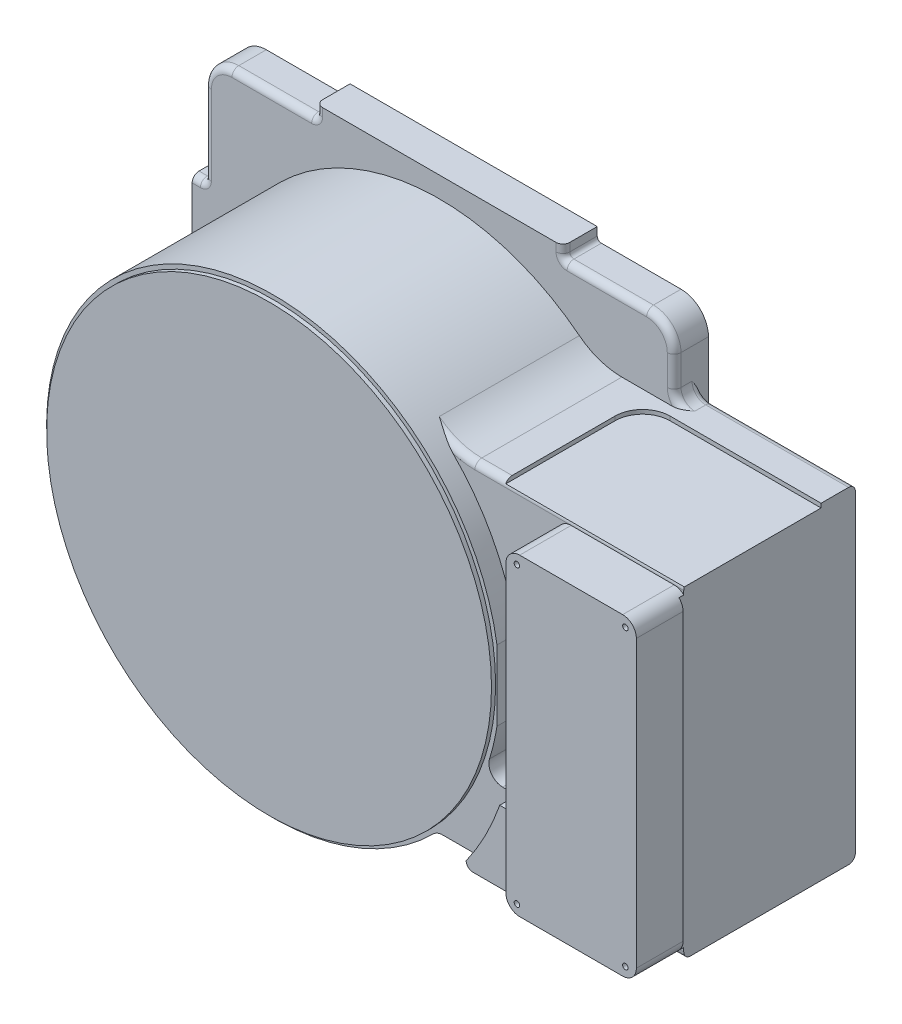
ISO-10303-21;
HEADER;
FILE_DESCRIPTION(('STEP AP214'),'2;1');
FILE_NAME('part.step','',(''),(''),'','','');
FILE_SCHEMA(('AUTOMOTIVE_DESIGN { 1 0 10303 214 1 1 1 1 }'));
ENDSEC;
DATA;
#1=APPLICATION_CONTEXT('core data for automotive mechanical design processes');
#2=APPLICATION_PROTOCOL_DEFINITION('international standard','automotive_design',2000,#1);
#3=PRODUCT_CONTEXT('',#1,'mechanical');
#4=PRODUCT('Part','Part','',(#3));
#5=PRODUCT_RELATED_PRODUCT_CATEGORY('part','',(#4));
#6=PRODUCT_DEFINITION_FORMATION('','',#4);
#7=PRODUCT_DEFINITION_CONTEXT('part definition',#1,'design');
#8=PRODUCT_DEFINITION('design','',#6,#7);
#9=PRODUCT_DEFINITION_SHAPE('','',#8);
#10=(LENGTH_UNIT() NAMED_UNIT(*) SI_UNIT(.MILLI.,.METRE.));
#11=(NAMED_UNIT(*) PLANE_ANGLE_UNIT() SI_UNIT($,.RADIAN.));
#12=(NAMED_UNIT(*) SI_UNIT($,.STERADIAN.) SOLID_ANGLE_UNIT());
#13=UNCERTAINTY_MEASURE_WITH_UNIT(LENGTH_MEASURE(1.E-05),#10,'distance_accuracy_value','');
#14=(GEOMETRIC_REPRESENTATION_CONTEXT(3) GLOBAL_UNCERTAINTY_ASSIGNED_CONTEXT((#13)) GLOBAL_UNIT_ASSIGNED_CONTEXT((#10,
#11,#12)) REPRESENTATION_CONTEXT('',''));
#15=CARTESIAN_POINT('',(0.,0.,0.));
#16=DIRECTION('',(0.,0.,1.));
#17=DIRECTION('',(1.,0.,0.));
#18=AXIS2_PLACEMENT_3D('',#15,#16,#17);
#19=CARTESIAN_POINT('',(201.,-107.,159.5));
#20=DIRECTION('',(0.,0.,-1.));
#21=DIRECTION('',(-1.,0.,0.));
#22=AXIS2_PLACEMENT_3D('',#19,#20,#21);
#23=PLANE('',#22);
#24=CARTESIAN_POINT('',(201.,-107.,159.5));
#25=DIRECTION('',(0.,0.,1.));
#26=DIRECTION('',(1.,0.,0.));
#27=AXIS2_PLACEMENT_3D('',#24,#25,#26);
#28=CIRCLE('',#27,2.);
#29=CARTESIAN_POINT('',(203.,-107.,159.5));
#30=VERTEX_POINT('',#29);
#31=EDGE_CURVE('E20',#30,#30,#28,.T.);
#32=ORIENTED_EDGE('',*,*,#31,.T.);
#33=EDGE_LOOP('',(#32));
#34=FACE_BOUND('',#33,.T.);
#35=ADVANCED_FACE('F17',(#34),#23,.F.);
#36=CARTESIAN_POINT('',(280.,-107.,159.5));
#37=DIRECTION('',(0.,0.,-1.));
#38=DIRECTION('',(-1.,0.,0.));
#39=AXIS2_PLACEMENT_3D('',#36,#37,#38);
#40=PLANE('',#39);
#41=CARTESIAN_POINT('',(280.,-107.,159.5));
#42=DIRECTION('',(0.,0.,1.));
#43=DIRECTION('',(1.,0.,0.));
#44=AXIS2_PLACEMENT_3D('',#41,#42,#43);
#45=CIRCLE('',#44,2.);
#46=CARTESIAN_POINT('',(282.,-107.,159.5));
#47=VERTEX_POINT('',#46);
#48=EDGE_CURVE('E1593',#47,#47,#45,.T.);
#49=ORIENTED_EDGE('',*,*,#48,.T.);
#50=EDGE_LOOP('',(#49));
#51=FACE_BOUND('',#50,.T.);
#52=ADVANCED_FACE('F908',(#51),#40,.F.);
#53=CARTESIAN_POINT('',(201.,107.,159.5));
#54=DIRECTION('',(0.,0.,-1.));
#55=DIRECTION('',(-1.,0.,0.));
#56=AXIS2_PLACEMENT_3D('',#53,#54,#55);
#57=PLANE('',#56);
#58=CARTESIAN_POINT('',(201.,107.,159.5));
#59=DIRECTION('',(0.,0.,1.));
#60=DIRECTION('',(1.,0.,0.));
#61=AXIS2_PLACEMENT_3D('',#58,#59,#60);
#62=CIRCLE('',#61,2.);
#63=CARTESIAN_POINT('',(203.,107.,159.5));
#64=VERTEX_POINT('',#63);
#65=EDGE_CURVE('E1591',#64,#64,#62,.T.);
#66=ORIENTED_EDGE('',*,*,#65,.T.);
#67=EDGE_LOOP('',(#66));
#68=FACE_BOUND('',#67,.T.);
#69=ADVANCED_FACE('F905',(#68),#57,.F.);
#70=CARTESIAN_POINT('',(280.,107.,159.5));
#71=DIRECTION('',(0.,0.,-1.));
#72=DIRECTION('',(-1.,0.,0.));
#73=AXIS2_PLACEMENT_3D('',#70,#71,#72);
#74=PLANE('',#73);
#75=CARTESIAN_POINT('',(280.,107.,159.5));
#76=DIRECTION('',(0.,0.,1.));
#77=DIRECTION('',(1.,0.,0.));
#78=AXIS2_PLACEMENT_3D('',#75,#76,#77);
#79=CIRCLE('',#78,2.);
#80=CARTESIAN_POINT('',(282.,107.,159.5));
#81=VERTEX_POINT('',#80);
#82=EDGE_CURVE('E1588',#81,#81,#79,.T.);
#83=ORIENTED_EDGE('',*,*,#82,.T.);
#84=EDGE_LOOP('',(#83));
#85=FACE_BOUND('',#84,.T.);
#86=ADVANCED_FACE('F902',(#85),#74,.F.);
#87=CARTESIAN_POINT('',(190.5,-114.,159.5));
#88=DIRECTION('',(1.,0.,0.));
#89=DIRECTION('',(0.,1.,0.));
#90=AXIS2_PLACEMENT_3D('',#87,#88,#89);
#91=PLANE('',#90);
#92=DIRECTION('',(0.,0.,1.));
#93=VECTOR('',#92,1.);
#94=CARTESIAN_POINT('',(190.5,-114.,159.5));
#95=LINE('',#94,#93);
#96=CARTESIAN_POINT('',(190.5,-114.,159.5));
#97=VERTEX_POINT('',#96);
#98=CARTESIAN_POINT('',(190.5,-114.,158.5));
#99=VERTEX_POINT('',#98);
#100=EDGE_CURVE('E322',#97,#99,#95,.F.);
#101=ORIENTED_EDGE('',*,*,#100,.F.);
#102=DIRECTION('',(0.,1.,0.));
#103=VECTOR('',#102,1.);
#104=CARTESIAN_POINT('',(190.5,-91.6187074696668,159.5));
#105=LINE('',#104,#103);
#106=CARTESIAN_POINT('',(190.5,-58.6143782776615,159.5));
#107=VERTEX_POINT('',#106);
#108=EDGE_CURVE('E1587',#107,#97,#105,.F.);
#109=ORIENTED_EDGE('',*,*,#108,.F.);
#110=DIRECTION('',(0.,0.,1.));
#111=VECTOR('',#110,1.);
#112=CARTESIAN_POINT('',(190.5,-58.6143782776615,159.5));
#113=LINE('',#112,#111);
#114=CARTESIAN_POINT('',(190.5,-58.6143782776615,158.5));
#115=VERTEX_POINT('',#114);
#116=EDGE_CURVE('E1597',#115,#107,#113,.T.);
#117=ORIENTED_EDGE('',*,*,#116,.F.);
#118=DIRECTION('',(0.,1.,0.));
#119=VECTOR('',#118,1.);
#120=CARTESIAN_POINT('',(190.5,-90.837643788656,158.5));
#121=LINE('',#120,#119);
#122=EDGE_CURVE('E1583',#99,#115,#121,.T.);
#123=ORIENTED_EDGE('',*,*,#122,.F.);
#124=EDGE_LOOP('',(#101,#109,#117,#123));
#125=FACE_BOUND('',#124,.T.);
#126=ADVANCED_FACE('F898',(#125),#91,.F.);
#127=CARTESIAN_POINT('',(0.,0.,149.));
#128=DIRECTION('',(0.,0.,-1.));
#129=DIRECTION('',(-1.,0.,0.));
#130=AXIS2_PLACEMENT_3D('',#127,#128,#129);
#131=PLANE('',#130);
#132=CARTESIAN_POINT('',(0.,0.,149.));
#133=DIRECTION('',(0.,0.,1.));
#134=DIRECTION('',(1.,0.,0.));
#135=AXIS2_PLACEMENT_3D('',#132,#133,#134);
#136=CIRCLE('',#135,162.);
#137=CARTESIAN_POINT('',(162.,0.,149.));
#138=VERTEX_POINT('',#137);
#139=EDGE_CURVE('E1573',#138,#138,#136,.F.);
#140=ORIENTED_EDGE('',*,*,#139,.F.);
#141=EDGE_LOOP('',(#140));
#142=FACE_BOUND('',#141,.T.);
#143=ADVANCED_FACE('F894',(#142),#131,.F.);
#144=CARTESIAN_POINT('',(201.,-107.,169.5));
#145=DIRECTION('',(0.,0.,1.));
#146=DIRECTION('',(1.,0.,0.));
#147=AXIS2_PLACEMENT_3D('',#144,#145,#146);
#148=CYLINDRICAL_SURFACE('',#147,2.);
#149=CARTESIAN_POINT('',(201.,-107.,169.5));
#150=DIRECTION('',(0.,0.,1.));
#151=DIRECTION('',(1.,0.,0.));
#152=AXIS2_PLACEMENT_3D('',#149,#150,#151);
#153=CIRCLE('',#152,2.);
#154=CARTESIAN_POINT('',(203.,-107.,169.5));
#155=VERTEX_POINT('',#154);
#156=EDGE_CURVE('E1668',#155,#155,#153,.F.);
#157=ORIENTED_EDGE('',*,*,#156,.F.);
#158=EDGE_LOOP('',(#157));
#159=FACE_BOUND('',#158,.T.);
#160=ORIENTED_EDGE('',*,*,#31,.F.);
#161=EDGE_LOOP('',(#160));
#162=FACE_BOUND('',#161,.T.);
#163=ADVANCED_FACE('F890',(#159,#162),#148,.F.);
#164=CARTESIAN_POINT('',(280.,-107.,169.5));
#165=DIRECTION('',(0.,0.,1.));
#166=DIRECTION('',(1.,0.,0.));
#167=AXIS2_PLACEMENT_3D('',#164,#165,#166);
#168=CYLINDRICAL_SURFACE('',#167,2.);
#169=CARTESIAN_POINT('',(280.,-107.,169.5));
#170=DIRECTION('',(0.,0.,1.));
#171=DIRECTION('',(1.,0.,0.));
#172=AXIS2_PLACEMENT_3D('',#169,#170,#171);
#173=CIRCLE('',#172,2.);
#174=CARTESIAN_POINT('',(282.,-107.,169.5));
#175=VERTEX_POINT('',#174);
#176=EDGE_CURVE('E2942',#175,#175,#173,.F.);
#177=ORIENTED_EDGE('',*,*,#176,.F.);
#178=EDGE_LOOP('',(#177));
#179=FACE_BOUND('',#178,.T.);
#180=ORIENTED_EDGE('',*,*,#48,.F.);
#181=EDGE_LOOP('',(#180));
#182=FACE_BOUND('',#181,.T.);
#183=ADVANCED_FACE('F886',(#179,#182),#168,.F.);
#184=CARTESIAN_POINT('',(201.,107.,169.5));
#185=DIRECTION('',(0.,0.,1.));
#186=DIRECTION('',(1.,0.,0.));
#187=AXIS2_PLACEMENT_3D('',#184,#185,#186);
#188=CYLINDRICAL_SURFACE('',#187,2.);
#189=CARTESIAN_POINT('',(201.,107.,169.5));
#190=DIRECTION('',(0.,0.,1.));
#191=DIRECTION('',(1.,0.,0.));
#192=AXIS2_PLACEMENT_3D('',#189,#190,#191);
#193=CIRCLE('',#192,2.);
#194=CARTESIAN_POINT('',(203.,107.,169.5));
#195=VERTEX_POINT('',#194);
#196=EDGE_CURVE('E2939',#195,#195,#193,.F.);
#197=ORIENTED_EDGE('',*,*,#196,.F.);
#198=EDGE_LOOP('',(#197));
#199=FACE_BOUND('',#198,.T.);
#200=ORIENTED_EDGE('',*,*,#65,.F.);
#201=EDGE_LOOP('',(#200));
#202=FACE_BOUND('',#201,.T.);
#203=ADVANCED_FACE('F882',(#199,#202),#188,.F.);
#204=CARTESIAN_POINT('',(280.,107.,169.5));
#205=DIRECTION('',(0.,0.,1.));
#206=DIRECTION('',(1.,0.,0.));
#207=AXIS2_PLACEMENT_3D('',#204,#205,#206);
#208=CYLINDRICAL_SURFACE('',#207,2.);
#209=CARTESIAN_POINT('',(280.,107.,169.5));
#210=DIRECTION('',(0.,0.,1.));
#211=DIRECTION('',(1.,0.,0.));
#212=AXIS2_PLACEMENT_3D('',#209,#210,#211);
#213=CIRCLE('',#212,2.);
#214=CARTESIAN_POINT('',(282.,107.,169.5));
#215=VERTEX_POINT('',#214);
#216=EDGE_CURVE('E1651',#215,#215,#213,.F.);
#217=ORIENTED_EDGE('',*,*,#216,.F.);
#218=EDGE_LOOP('',(#217));
#219=FACE_BOUND('',#218,.T.);
#220=ORIENTED_EDGE('',*,*,#82,.F.);
#221=EDGE_LOOP('',(#220));
#222=FACE_BOUND('',#221,.T.);
#223=ADVANCED_FACE('F878',(#219,#222),#208,.F.);
#224=CARTESIAN_POINT('',(203.,-104.,135.5));
#225=DIRECTION('',(0.,0.,1.));
#226=DIRECTION('',(1.,0.,0.));
#227=AXIS2_PLACEMENT_3D('',#224,#225,#226);
#228=CYLINDRICAL_SURFACE('',#227,10.);
#229=CARTESIAN_POINT('',(203.,-104.,159.5));
#230=DIRECTION('',(0.,0.,1.));
#231=DIRECTION('',(1.,0.,0.));
#232=AXIS2_PLACEMENT_3D('',#229,#230,#231);
#233=CIRCLE('',#232,10.);
#234=CARTESIAN_POINT('',(203.,-114.,159.5));
#235=VERTEX_POINT('',#234);
#236=CARTESIAN_POINT('',(193.,-104.,159.5));
#237=VERTEX_POINT('',#236);
#238=EDGE_CURVE('E1584',#235,#237,#233,.F.);
#239=ORIENTED_EDGE('',*,*,#238,.F.);
#240=DIRECTION('',(0.,0.,-1.));
#241=VECTOR('',#240,1.);
#242=CARTESIAN_POINT('',(203.,-114.,135.5));
#243=LINE('',#242,#241);
#244=CARTESIAN_POINT('',(203.,-114.,169.5));
#245=VERTEX_POINT('',#244);
#246=EDGE_CURVE('E315',#245,#235,#243,.T.);
#247=ORIENTED_EDGE('',*,*,#246,.F.);
#248=CARTESIAN_POINT('',(203.,-104.,169.5));
#249=DIRECTION('',(0.,0.,1.));
#250=DIRECTION('',(1.,0.,0.));
#251=AXIS2_PLACEMENT_3D('',#248,#249,#250);
#252=CIRCLE('',#251,10.);
#253=CARTESIAN_POINT('',(193.,-104.,169.5));
#254=VERTEX_POINT('',#253);
#255=EDGE_CURVE('E1654',#254,#245,#252,.T.);
#256=ORIENTED_EDGE('',*,*,#255,.F.);
#257=DIRECTION('',(0.,0.,1.));
#258=VECTOR('',#257,1.);
#259=CARTESIAN_POINT('',(193.,-104.,135.5));
#260=LINE('',#259,#258);
#261=EDGE_CURVE('E1606',#237,#254,#260,.T.);
#262=ORIENTED_EDGE('',*,*,#261,.F.);
#263=EDGE_LOOP('',(#239,#247,#256,#262));
#264=FACE_BOUND('',#263,.T.);
#265=ADVANCED_FACE('F874',(#264),#228,.T.);
#266=CARTESIAN_POINT('',(178.012696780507,-91.6187074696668,159.5));
#267=DIRECTION('',(0.,0.,1.));
#268=DIRECTION('',(1.,0.,0.));
#269=AXIS2_PLACEMENT_3D('',#266,#267,#268);
#270=PLANE('',#269);
#271=DIRECTION('',(0.,1.,0.));
#272=VECTOR('',#271,1.);
#273=CARTESIAN_POINT('',(193.,-114.,159.5));
#274=LINE('',#273,#272);
#275=CARTESIAN_POINT('',(193.,-52.,159.5));
#276=VERTEX_POINT('',#275);
#277=EDGE_CURVE('E1602',#276,#237,#274,.F.);
#278=ORIENTED_EDGE('',*,*,#277,.F.);
#279=CARTESIAN_POINT('',(183.,-52.,159.5));
#280=DIRECTION('',(0.,0.,1.));
#281=DIRECTION('',(1.,0.,0.));
#282=AXIS2_PLACEMENT_3D('',#279,#280,#281);
#283=CIRCLE('',#282,10.);
#284=EDGE_CURVE('E1577',#276,#107,#283,.F.);
#285=ORIENTED_EDGE('',*,*,#284,.T.);
#286=ORIENTED_EDGE('',*,*,#108,.T.);
#287=DIRECTION('',(1.,0.,0.));
#288=VECTOR('',#287,1.);
#289=CARTESIAN_POINT('',(288.,-114.,159.5));
#290=LINE('',#289,#288);
#291=EDGE_CURVE('E1611',#235,#97,#290,.F.);
#292=ORIENTED_EDGE('',*,*,#291,.F.);
#293=ORIENTED_EDGE('',*,*,#238,.T.);
#294=EDGE_LOOP('',(#278,#285,#286,#292,#293));
#295=FACE_BOUND('',#294,.T.);
#296=ADVANCED_FACE('F870',(#295),#270,.T.);
#297=CARTESIAN_POINT('',(177.11638562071,-90.837643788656,158.5));
#298=DIRECTION('',(0.,0.,1.));
#299=DIRECTION('',(1.,0.,0.));
#300=AXIS2_PLACEMENT_3D('',#297,#298,#299);
#301=PLANE('',#300);
#302=CARTESIAN_POINT('',(183.,-52.,158.5));
#303=DIRECTION('',(0.,0.,1.));
#304=DIRECTION('',(1.,0.,0.));
#305=AXIS2_PLACEMENT_3D('',#302,#303,#304);
#306=CIRCLE('',#305,10.);
#307=CARTESIAN_POINT('',(183.,-62.,158.5));
#308=VERTEX_POINT('',#307);
#309=EDGE_CURVE('E1581',#115,#308,#306,.F.);
#310=ORIENTED_EDGE('',*,*,#309,.T.);
#311=DIRECTION('',(1.,0.,0.));
#312=VECTOR('',#311,1.);
#313=CARTESIAN_POINT('',(152.908469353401,-62.,158.5));
#314=LINE('',#313,#312);
#315=CARTESIAN_POINT('',(177.482393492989,-62.,158.5));
#316=VERTEX_POINT('',#315);
#317=EDGE_CURVE('E1569',#308,#316,#314,.F.);
#318=ORIENTED_EDGE('',*,*,#317,.T.);
#319=CARTESIAN_POINT('',(0.,0.,158.5));
#320=DIRECTION('',(0.,0.,1.));
#321=DIRECTION('',(1.,0.,0.));
#322=AXIS2_PLACEMENT_3D('',#319,#320,#321);
#323=CIRCLE('',#322,188.);
#324=CARTESIAN_POINT('',(153.005734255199,-109.239394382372,158.5));
#325=VERTEX_POINT('',#324);
#326=EDGE_CURVE('E819',#316,#325,#323,.F.);
#327=ORIENTED_EDGE('',*,*,#326,.T.);
#328=CARTESIAN_POINT('',(158.,-109.,158.5));
#329=DIRECTION('',(0.,0.,1.));
#330=DIRECTION('',(1.,0.,0.));
#331=AXIS2_PLACEMENT_3D('',#328,#329,#330);
#332=CIRCLE('',#331,5.);
#333=CARTESIAN_POINT('',(158.,-114.,158.5));
#334=VERTEX_POINT('',#333);
#335=EDGE_CURVE('E823',#334,#325,#332,.F.);
#336=ORIENTED_EDGE('',*,*,#335,.F.);
#337=DIRECTION('',(1.,0.,0.));
#338=VECTOR('',#337,1.);
#339=CARTESIAN_POINT('',(288.,-114.,158.5));
#340=LINE('',#339,#338);
#341=EDGE_CURVE('E826',#99,#334,#340,.F.);
#342=ORIENTED_EDGE('',*,*,#341,.F.);
#343=ORIENTED_EDGE('',*,*,#122,.T.);
#344=EDGE_LOOP('',(#310,#318,#327,#336,#342,#343));
#345=FACE_BOUND('',#344,.T.);
#346=ADVANCED_FACE('F866',(#345),#301,.T.);
#347=CARTESIAN_POINT('',(183.,-52.,135.5));
#348=DIRECTION('',(0.,0.,1.));
#349=DIRECTION('',(1.,0.,0.));
#350=AXIS2_PLACEMENT_3D('',#347,#348,#349);
#351=CYLINDRICAL_SURFACE('',#350,10.);
#352=ORIENTED_EDGE('',*,*,#284,.F.);
#353=DIRECTION('',(0.,0.,1.));
#354=VECTOR('',#353,1.);
#355=CARTESIAN_POINT('',(193.,-52.,135.5));
#356=LINE('',#355,#354);
#357=CARTESIAN_POINT('',(193.,-52.,132.));
#358=VERTEX_POINT('',#357);
#359=EDGE_CURVE('E1580',#358,#276,#356,.T.);
#360=ORIENTED_EDGE('',*,*,#359,.F.);
#361=CARTESIAN_POINT('',(183.,-52.,132.));
#362=DIRECTION('',(0.,0.,1.));
#363=DIRECTION('',(1.,0.,0.));
#364=AXIS2_PLACEMENT_3D('',#361,#362,#363);
#365=CIRCLE('',#364,10.);
#366=CARTESIAN_POINT('',(183.,-62.,132.));
#367=VERTEX_POINT('',#366);
#368=EDGE_CURVE('E1729',#367,#358,#365,.T.);
#369=ORIENTED_EDGE('',*,*,#368,.F.);
#370=DIRECTION('',(0.,0.,1.));
#371=VECTOR('',#370,1.);
#372=CARTESIAN_POINT('',(183.,-62.,135.5));
#373=LINE('',#372,#371);
#374=EDGE_CURVE('E818',#367,#308,#373,.T.);
#375=ORIENTED_EDGE('',*,*,#374,.T.);
#376=ORIENTED_EDGE('',*,*,#309,.F.);
#377=ORIENTED_EDGE('',*,*,#116,.T.);
#378=EDGE_LOOP('',(#352,#360,#369,#375,#376,#377));
#379=FACE_BOUND('',#378,.T.);
#380=ADVANCED_FACE('F862',(#379),#351,.F.);
#381=CARTESIAN_POINT('',(193.,-114.,135.5));
#382=DIRECTION('',(-1.,0.,0.));
#383=DIRECTION('',(0.,0.,1.));
#384=AXIS2_PLACEMENT_3D('',#381,#382,#383);
#385=PLANE('',#384);
#386=ORIENTED_EDGE('',*,*,#261,.T.);
#387=DIRECTION('',(0.,1.,0.));
#388=VECTOR('',#387,1.);
#389=CARTESIAN_POINT('',(193.,0.,169.5));
#390=LINE('',#389,#388);
#391=CARTESIAN_POINT('',(193.,104.,169.5));
#392=VERTEX_POINT('',#391);
#393=EDGE_CURVE('E1648',#392,#254,#390,.F.);
#394=ORIENTED_EDGE('',*,*,#393,.F.);
#395=DIRECTION('',(0.,0.,1.));
#396=VECTOR('',#395,1.);
#397=CARTESIAN_POINT('',(193.,104.,135.5));
#398=LINE('',#397,#396);
#399=CARTESIAN_POINT('',(193.,104.,132.));
#400=VERTEX_POINT('',#399);
#401=EDGE_CURVE('E1576',#400,#392,#398,.T.);
#402=ORIENTED_EDGE('',*,*,#401,.F.);
#403=DIRECTION('',(0.,1.,0.));
#404=VECTOR('',#403,1.);
#405=CARTESIAN_POINT('',(193.,58.4594178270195,132.));
#406=LINE('',#405,#404);
#407=EDGE_CURVE('E1509',#358,#400,#406,.T.);
#408=ORIENTED_EDGE('',*,*,#407,.F.);
#409=ORIENTED_EDGE('',*,*,#359,.T.);
#410=ORIENTED_EDGE('',*,*,#277,.T.);
#411=EDGE_LOOP('',(#386,#394,#402,#408,#409,#410));
#412=FACE_BOUND('',#411,.T.);
#413=ADVANCED_FACE('F858',(#412),#385,.T.);
#414=CARTESIAN_POINT('',(203.,104.,135.5));
#415=DIRECTION('',(0.,0.,1.));
#416=DIRECTION('',(1.,0.,0.));
#417=AXIS2_PLACEMENT_3D('',#414,#415,#416);
#418=CYLINDRICAL_SURFACE('',#417,10.);
#419=CARTESIAN_POINT('',(203.,104.,132.));
#420=DIRECTION('',(0.,0.,1.));
#421=DIRECTION('',(1.,0.,0.));
#422=AXIS2_PLACEMENT_3D('',#419,#420,#421);
#423=CIRCLE('',#422,10.);
#424=CARTESIAN_POINT('',(203.,114.,132.));
#425=VERTEX_POINT('',#424);
#426=EDGE_CURVE('E1452',#400,#425,#423,.F.);
#427=ORIENTED_EDGE('',*,*,#426,.F.);
#428=ORIENTED_EDGE('',*,*,#401,.T.);
#429=CARTESIAN_POINT('',(203.,104.,169.5));
#430=DIRECTION('',(0.,0.,1.));
#431=DIRECTION('',(1.,0.,0.));
#432=AXIS2_PLACEMENT_3D('',#429,#430,#431);
#433=CIRCLE('',#432,10.);
#434=CARTESIAN_POINT('',(203.,114.,169.5));
#435=VERTEX_POINT('',#434);
#436=EDGE_CURVE('E1641',#435,#392,#433,.T.);
#437=ORIENTED_EDGE('',*,*,#436,.F.);
#438=DIRECTION('',(0.,0.,1.));
#439=VECTOR('',#438,1.);
#440=CARTESIAN_POINT('',(203.,114.,135.5));
#441=LINE('',#440,#439);
#442=EDGE_CURVE('E1666',#425,#435,#441,.T.);
#443=ORIENTED_EDGE('',*,*,#442,.F.);
#444=EDGE_LOOP('',(#427,#428,#437,#443));
#445=FACE_BOUND('',#444,.T.);
#446=ADVANCED_FACE('F854',(#445),#418,.T.);
#447=CARTESIAN_POINT('',(206.304433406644,0.,132.));
#448=DIRECTION('',(0.,0.,1.));
#449=DIRECTION('',(1.,0.,0.));
#450=AXIS2_PLACEMENT_3D('',#447,#448,#449);
#451=PLANE('',#450);
#452=DIRECTION('',(1.,0.,0.));
#453=VECTOR('',#452,1.);
#454=CARTESIAN_POINT('',(288.,-114.,132.));
#455=LINE('',#454,#453);
#456=CARTESIAN_POINT('',(123.486841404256,-114.,132.));
#457=VERTEX_POINT('',#456);
#458=CARTESIAN_POINT('',(132.905981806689,-114.,132.));
#459=VERTEX_POINT('',#458);
#460=EDGE_CURVE('E814',#457,#459,#455,.T.);
#461=ORIENTED_EDGE('',*,*,#460,.F.);
#462=CARTESIAN_POINT('',(123.486841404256,-124.,132.));
#463=DIRECTION('',(0.,0.,1.));
#464=DIRECTION('',(1.,0.,0.));
#465=AXIS2_PLACEMENT_3D('',#462,#463,#464);
#466=CIRCLE('',#465,10.);
#467=CARTESIAN_POINT('',(117.072222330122,-116.328451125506,132.));
#468=VERTEX_POINT('',#467);
#469=EDGE_CURVE('E830',#457,#468,#466,.T.);
#470=ORIENTED_EDGE('',*,*,#469,.T.);
#471=CARTESIAN_POINT('',(132.905981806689,-169.,132.));
#472=DIRECTION('',(0.,0.,1.));
#473=DIRECTION('',(0.,1.,0.));
#474=AXIS2_PLACEMENT_3D('',#471,#472,#473);
#475=CIRCLE('',#474,55.);
#476=EDGE_CURVE('E836',#459,#468,#475,.T.);
#477=ORIENTED_EDGE('',*,*,#476,.F.);
#478=EDGE_LOOP('',(#461,#470,#477));
#479=FACE_BOUND('',#478,.T.);
#480=ADVANCED_FACE('F843',(#479),#451,.T.);
#481=CARTESIAN_POINT('',(158.,-109.,135.5));
#482=DIRECTION('',(0.,0.,1.));
#483=DIRECTION('',(1.,0.,0.));
#484=AXIS2_PLACEMENT_3D('',#481,#482,#483);
#485=CYLINDRICAL_SURFACE('',#484,5.);
#486=CARTESIAN_POINT('',(158.,-109.,146.));
#487=DIRECTION('',(0.,0.,1.));
#488=DIRECTION('',(1.,0.,0.));
#489=AXIS2_PLACEMENT_3D('',#486,#487,#488);
#490=CIRCLE('',#489,5.);
#491=CARTESIAN_POINT('',(158.,-114.,146.));
#492=VERTEX_POINT('',#491);
#493=CARTESIAN_POINT('',(153.005734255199,-109.239394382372,146.));
#494=VERTEX_POINT('',#493);
#495=EDGE_CURVE('E1433',#492,#494,#490,.F.);
#496=ORIENTED_EDGE('',*,*,#495,.F.);
#497=DIRECTION('',(0.,0.,-1.));
#498=VECTOR('',#497,1.);
#499=CARTESIAN_POINT('',(158.,-114.,135.5));
#500=LINE('',#499,#498);
#501=EDGE_CURVE('E824',#334,#492,#500,.T.);
#502=ORIENTED_EDGE('',*,*,#501,.F.);
#503=ORIENTED_EDGE('',*,*,#335,.T.);
#504=DIRECTION('',(0.,0.,1.));
#505=VECTOR('',#504,1.);
#506=CARTESIAN_POINT('',(153.005734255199,-109.239394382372,135.5));
#507=LINE('',#506,#505);
#508=EDGE_CURVE('E820',#325,#494,#507,.F.);
#509=ORIENTED_EDGE('',*,*,#508,.T.);
#510=EDGE_LOOP('',(#496,#502,#503,#509));
#511=FACE_BOUND('',#510,.T.);
#512=ADVANCED_FACE('F853',(#511),#485,.T.);
#513=CARTESIAN_POINT('',(0.,0.,135.5));
#514=DIRECTION('',(0.,0.,1.));
#515=DIRECTION('',(1.,0.,0.));
#516=AXIS2_PLACEMENT_3D('',#513,#514,#515);
#517=CYLINDRICAL_SURFACE('',#516,188.);
#518=DIRECTION('',(0.,0.,1.));
#519=VECTOR('',#518,1.);
#520=CARTESIAN_POINT('',(177.482393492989,-62.,135.5));
#521=LINE('',#520,#519);
#522=CARTESIAN_POINT('',(177.482393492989,-62.,146.));
#523=VERTEX_POINT('',#522);
#524=EDGE_CURVE('E815',#316,#523,#521,.F.);
#525=ORIENTED_EDGE('',*,*,#524,.T.);
#526=CARTESIAN_POINT('',(0.,0.,146.));
#527=DIRECTION('',(0.,0.,1.));
#528=DIRECTION('',(1.,0.,0.));
#529=AXIS2_PLACEMENT_3D('',#526,#527,#528);
#530=CIRCLE('',#529,188.);
#531=EDGE_CURVE('E1431',#494,#523,#530,.T.);
#532=ORIENTED_EDGE('',*,*,#531,.F.);
#533=ORIENTED_EDGE('',*,*,#508,.F.);
#534=ORIENTED_EDGE('',*,*,#326,.F.);
#535=EDGE_LOOP('',(#525,#532,#533,#534));
#536=FACE_BOUND('',#535,.T.);
#537=ADVANCED_FACE('F1545',(#536),#517,.F.);
#538=CARTESIAN_POINT('',(152.908469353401,-62.,135.5));
#539=DIRECTION('',(0.,-1.,0.));
#540=DIRECTION('',(1.,0.,0.));
#541=AXIS2_PLACEMENT_3D('',#538,#539,#540);
#542=PLANE('',#541);
#543=ORIENTED_EDGE('',*,*,#374,.F.);
#544=DIRECTION('',(1.,0.,0.));
#545=VECTOR('',#544,1.);
#546=CARTESIAN_POINT('',(188.01327445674,-62.,132.));
#547=LINE('',#546,#545);
#548=CARTESIAN_POINT('',(167.095780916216,-62.,132.));
#549=VERTEX_POINT('',#548);
#550=EDGE_CURVE('E1731',#549,#367,#547,.T.);
#551=ORIENTED_EDGE('',*,*,#550,.F.);
#552=DIRECTION('',(0.,0.,-1.));
#553=VECTOR('',#552,1.);
#554=CARTESIAN_POINT('',(167.095780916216,-62.,7.));
#555=LINE('',#554,#553);
#556=CARTESIAN_POINT('',(167.095780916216,-62.,146.));
#557=VERTEX_POINT('',#556);
#558=EDGE_CURVE('E805',#549,#557,#555,.F.);
#559=ORIENTED_EDGE('',*,*,#558,.T.);
#560=DIRECTION('',(1.,0.,0.));
#561=VECTOR('',#560,1.);
#562=CARTESIAN_POINT('',(10.9448772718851,-62.,146.));
#563=LINE('',#562,#561);
#564=EDGE_CURVE('E1430',#523,#557,#563,.F.);
#565=ORIENTED_EDGE('',*,*,#564,.F.);
#566=ORIENTED_EDGE('',*,*,#524,.F.);
#567=ORIENTED_EDGE('',*,*,#317,.F.);
#568=EDGE_LOOP('',(#543,#551,#559,#565,#566,#567));
#569=FACE_BOUND('',#568,.T.);
#570=ADVANCED_FACE('F1542',(#569),#542,.F.);
#571=CARTESIAN_POINT('',(0.,0.,146.));
#572=DIRECTION('',(0.,0.,1.));
#573=DIRECTION('',(1.,0.,0.));
#574=AXIS2_PLACEMENT_3D('',#571,#572,#573);
#575=CYLINDRICAL_SURFACE('',#574,162.);
#576=CARTESIAN_POINT('',(0.,0.,146.));
#577=DIRECTION('',(0.,0.,1.));
#578=DIRECTION('',(1.,0.,0.));
#579=AXIS2_PLACEMENT_3D('',#576,#577,#578);
#580=CIRCLE('',#579,162.);
#581=CARTESIAN_POINT('',(162.,0.,146.));
#582=VERTEX_POINT('',#581);
#583=EDGE_CURVE('E1424',#582,#582,#580,.F.);
#584=ORIENTED_EDGE('',*,*,#583,.F.);
#585=EDGE_LOOP('',(#584));
#586=FACE_BOUND('',#585,.T.);
#587=ORIENTED_EDGE('',*,*,#139,.T.);
#588=EDGE_LOOP('',(#587));
#589=FACE_BOUND('',#588,.T.);
#590=ADVANCED_FACE('F1538',(#586,#589),#575,.T.);
#591=CARTESIAN_POINT('',(193.,114.,135.5));
#592=DIRECTION('',(0.,1.,0.));
#593=DIRECTION('',(0.,0.,1.));
#594=AXIS2_PLACEMENT_3D('',#591,#592,#593);
#595=PLANE('',#594);
#596=DIRECTION('',(0.,0.,1.));
#597=VECTOR('',#596,1.);
#598=CARTESIAN_POINT('',(278.,114.,135.5));
#599=LINE('',#598,#597);
#600=CARTESIAN_POINT('',(278.,114.,132.));
#601=VERTEX_POINT('',#600);
#602=CARTESIAN_POINT('',(278.,114.,169.5));
#603=VERTEX_POINT('',#602);
#604=EDGE_CURVE('E733',#601,#603,#599,.T.);
#605=ORIENTED_EDGE('',*,*,#604,.F.);
#606=DIRECTION('',(1.,0.,0.));
#607=VECTOR('',#606,1.);
#608=CARTESIAN_POINT('',(151.155565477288,114.,132.));
#609=LINE('',#608,#607);
#610=EDGE_CURVE('E740',#425,#601,#609,.T.);
#611=ORIENTED_EDGE('',*,*,#610,.F.);
#612=ORIENTED_EDGE('',*,*,#442,.T.);
#613=DIRECTION('',(1.,0.,0.));
#614=VECTOR('',#613,1.);
#615=CARTESIAN_POINT('',(240.5,114.,169.5));
#616=LINE('',#615,#614);
#617=EDGE_CURVE('E1650',#603,#435,#616,.F.);
#618=ORIENTED_EDGE('',*,*,#617,.F.);
#619=EDGE_LOOP('',(#605,#611,#612,#618));
#620=FACE_BOUND('',#619,.T.);
#621=ADVANCED_FACE('F1534',(#620),#595,.T.);
#622=CARTESIAN_POINT('',(240.5,0.,169.5));
#623=DIRECTION('',(0.,0.,1.));
#624=DIRECTION('',(1.,0.,0.));
#625=AXIS2_PLACEMENT_3D('',#622,#623,#624);
#626=PLANE('',#625);
#627=CARTESIAN_POINT('',(278.,104.,169.5));
#628=DIRECTION('',(0.,0.,1.));
#629=DIRECTION('',(1.,0.,0.));
#630=AXIS2_PLACEMENT_3D('',#627,#628,#629);
#631=CIRCLE('',#630,10.);
#632=CARTESIAN_POINT('',(288.,104.,169.5));
#633=VERTEX_POINT('',#632);
#634=EDGE_CURVE('E739',#603,#633,#631,.F.);
#635=ORIENTED_EDGE('',*,*,#634,.F.);
#636=ORIENTED_EDGE('',*,*,#617,.T.);
#637=ORIENTED_EDGE('',*,*,#436,.T.);
#638=ORIENTED_EDGE('',*,*,#393,.T.);
#639=ORIENTED_EDGE('',*,*,#255,.T.);
#640=DIRECTION('',(1.,0.,0.));
#641=VECTOR('',#640,1.);
#642=CARTESIAN_POINT('',(288.,-114.,169.5));
#643=LINE('',#642,#641);
#644=CARTESIAN_POINT('',(278.,-114.,169.5));
#645=VERTEX_POINT('',#644);
#646=EDGE_CURVE('E1614',#645,#245,#643,.F.);
#647=ORIENTED_EDGE('',*,*,#646,.F.);
#648=CARTESIAN_POINT('',(278.,-104.,169.5));
#649=DIRECTION('',(0.,0.,1.));
#650=DIRECTION('',(1.,0.,0.));
#651=AXIS2_PLACEMENT_3D('',#648,#649,#650);
#652=CIRCLE('',#651,10.);
#653=CARTESIAN_POINT('',(288.,-104.,169.5));
#654=VERTEX_POINT('',#653);
#655=EDGE_CURVE('E1412',#654,#645,#652,.F.);
#656=ORIENTED_EDGE('',*,*,#655,.F.);
#657=DIRECTION('',(0.,1.,0.));
#658=VECTOR('',#657,1.);
#659=CARTESIAN_POINT('',(288.,0.,169.5));
#660=LINE('',#659,#658);
#661=EDGE_CURVE('E1660',#633,#654,#660,.F.);
#662=ORIENTED_EDGE('',*,*,#661,.F.);
#663=EDGE_LOOP('',(#635,#636,#637,#638,#639,#647,#656,#662));
#664=FACE_BOUND('',#663,.T.);
#665=ORIENTED_EDGE('',*,*,#216,.T.);
#666=EDGE_LOOP('',(#665));
#667=FACE_BOUND('',#666,.T.);
#668=ORIENTED_EDGE('',*,*,#196,.T.);
#669=EDGE_LOOP('',(#668));
#670=FACE_BOUND('',#669,.T.);
#671=ORIENTED_EDGE('',*,*,#176,.T.);
#672=EDGE_LOOP('',(#671));
#673=FACE_BOUND('',#672,.T.);
#674=ORIENTED_EDGE('',*,*,#156,.T.);
#675=EDGE_LOOP('',(#674));
#676=FACE_BOUND('',#675,.T.);
#677=ADVANCED_FACE('F1530',(#664,#667,#670,#673,#676),#626,.T.);
#678=CARTESIAN_POINT('',(288.,0.,135.5));
#679=DIRECTION('',(1.,0.,0.));
#680=DIRECTION('',(0.,0.,-1.));
#681=AXIS2_PLACEMENT_3D('',#678,#679,#680);
#682=PLANE('',#681);
#683=DIRECTION('',(0.,0.,1.));
#684=VECTOR('',#683,1.);
#685=CARTESIAN_POINT('',(288.,-104.,135.5));
#686=LINE('',#685,#684);
#687=CARTESIAN_POINT('',(288.,-104.,135.5));
#688=VERTEX_POINT('',#687);
#689=EDGE_CURVE('E1407',#688,#654,#686,.T.);
#690=ORIENTED_EDGE('',*,*,#689,.F.);
#691=DIRECTION('',(0.,1.,0.));
#692=VECTOR('',#691,1.);
#693=CARTESIAN_POINT('',(288.,0.,135.5));
#694=LINE('',#693,#692);
#695=CARTESIAN_POINT('',(288.,104.,135.5));
#696=VERTEX_POINT('',#695);
#697=EDGE_CURVE('E729',#688,#696,#694,.T.);
#698=ORIENTED_EDGE('',*,*,#697,.T.);
#699=DIRECTION('',(0.,0.,1.));
#700=VECTOR('',#699,1.);
#701=CARTESIAN_POINT('',(288.,104.,135.5));
#702=LINE('',#701,#700);
#703=EDGE_CURVE('E1419',#633,#696,#702,.F.);
#704=ORIENTED_EDGE('',*,*,#703,.F.);
#705=ORIENTED_EDGE('',*,*,#661,.T.);
#706=EDGE_LOOP('',(#690,#698,#704,#705));
#707=FACE_BOUND('',#706,.T.);
#708=ADVANCED_FACE('F1527',(#707),#682,.T.);
#709=CARTESIAN_POINT('',(288.,-114.,135.5));
#710=DIRECTION('',(0.,-1.,0.));
#711=DIRECTION('',(0.,0.,-1.));
#712=AXIS2_PLACEMENT_3D('',#709,#710,#711);
#713=PLANE('',#712);
#714=ORIENTED_EDGE('',*,*,#460,.T.);
#715=DIRECTION('',(-1.,0.,0.));
#716=VECTOR('',#715,1.);
#717=CARTESIAN_POINT('',(245.652216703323,-114.,132.));
#718=LINE('',#717,#716);
#719=CARTESIAN_POINT('',(278.,-114.,132.));
#720=VERTEX_POINT('',#719);
#721=EDGE_CURVE('E709',#720,#459,#718,.T.);
#722=ORIENTED_EDGE('',*,*,#721,.F.);
#723=DIRECTION('',(0.,0.,1.));
#724=VECTOR('',#723,1.);
#725=CARTESIAN_POINT('',(278.,-114.,135.5));
#726=LINE('',#725,#724);
#727=EDGE_CURVE('E1411',#645,#720,#726,.F.);
#728=ORIENTED_EDGE('',*,*,#727,.F.);
#729=ORIENTED_EDGE('',*,*,#646,.T.);
#730=ORIENTED_EDGE('',*,*,#246,.T.);
#731=ORIENTED_EDGE('',*,*,#291,.T.);
#732=ORIENTED_EDGE('',*,*,#100,.T.);
#733=ORIENTED_EDGE('',*,*,#341,.T.);
#734=ORIENTED_EDGE('',*,*,#501,.T.);
#735=DIRECTION('',(1.,0.,0.));
#736=VECTOR('',#735,1.);
#737=CARTESIAN_POINT('',(10.9448772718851,-114.,146.));
#738=LINE('',#737,#736);
#739=CARTESIAN_POINT('',(123.486841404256,-114.,146.));
#740=VERTEX_POINT('',#739);
#741=EDGE_CURVE('E1435',#740,#492,#738,.T.);
#742=ORIENTED_EDGE('',*,*,#741,.F.);
#743=DIRECTION('',(0.,0.,1.));
#744=VECTOR('',#743,1.);
#745=CARTESIAN_POINT('',(123.486841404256,-114.,7.));
#746=LINE('',#745,#744);
#747=EDGE_CURVE('E827',#740,#457,#746,.F.);
#748=ORIENTED_EDGE('',*,*,#747,.T.);
#749=EDGE_LOOP('',(#714,#722,#728,#729,#730,#731,#732,#733,#734,#742,#748));
#750=FACE_BOUND('',#749,.T.);
#751=ADVANCED_FACE('F1523',(#750),#713,.T.);
#752=CARTESIAN_POINT('',(167.095780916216,-52.,7.));
#753=DIRECTION('',(0.,0.,-1.));
#754=DIRECTION('',(-1.,0.,0.));
#755=AXIS2_PLACEMENT_3D('',#752,#753,#754);
#756=CYLINDRICAL_SURFACE('',#755,10.);
#757=DIRECTION('',(0.,0.,1.));
#758=VECTOR('',#757,1.);
#759=CARTESIAN_POINT('',(157.547450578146,-49.0285714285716,7.));
#760=LINE('',#759,#758);
#761=CARTESIAN_POINT('',(157.547450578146,-49.0285714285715,146.));
#762=VERTEX_POINT('',#761);
#763=CARTESIAN_POINT('',(157.547450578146,-49.0285714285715,132.));
#764=VERTEX_POINT('',#763);
#765=EDGE_CURVE('E1399',#762,#764,#760,.F.);
#766=ORIENTED_EDGE('',*,*,#765,.F.);
#767=CARTESIAN_POINT('',(167.095780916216,-52.,146.));
#768=DIRECTION('',(0.,0.,-1.));
#769=DIRECTION('',(-1.,0.,0.));
#770=AXIS2_PLACEMENT_3D('',#767,#768,#769);
#771=CIRCLE('',#770,10.);
#772=EDGE_CURVE('E1428',#557,#762,#771,.T.);
#773=ORIENTED_EDGE('',*,*,#772,.F.);
#774=ORIENTED_EDGE('',*,*,#558,.F.);
#775=CARTESIAN_POINT('',(167.095780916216,-52.,132.));
#776=DIRECTION('',(0.,0.,-1.));
#777=DIRECTION('',(-1.,0.,0.));
#778=AXIS2_PLACEMENT_3D('',#775,#776,#777);
#779=CIRCLE('',#778,10.);
#780=EDGE_CURVE('E813',#764,#549,#779,.F.);
#781=ORIENTED_EDGE('',*,*,#780,.F.);
#782=EDGE_LOOP('',(#766,#773,#774,#781));
#783=FACE_BOUND('',#782,.T.);
#784=ADVANCED_FACE('F1520',(#783),#756,.F.);
#785=CARTESIAN_POINT('',(188.01327445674,58.4594178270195,132.));
#786=DIRECTION('',(0.,0.,1.));
#787=DIRECTION('',(1.,0.,0.));
#788=AXIS2_PLACEMENT_3D('',#785,#786,#787);
#789=PLANE('',#788);
#790=ORIENTED_EDGE('',*,*,#407,.T.);
#791=ORIENTED_EDGE('',*,*,#426,.T.);
#792=DIRECTION('',(1.,0.,0.));
#793=VECTOR('',#792,1.);
#794=CARTESIAN_POINT('',(151.155565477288,114.,132.));
#795=LINE('',#794,#793);
#796=CARTESIAN_POINT('',(132.905981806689,114.,132.));
#797=VERTEX_POINT('',#796);
#798=EDGE_CURVE('E764',#797,#425,#795,.T.);
#799=ORIENTED_EDGE('',*,*,#798,.F.);
#800=CARTESIAN_POINT('',(132.905981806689,169.,132.));
#801=DIRECTION('',(0.,0.,1.));
#802=DIRECTION('',(-0.289352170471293,-0.957222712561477,0.));
#803=AXIS2_PLACEMENT_3D('',#800,#801,#802);
#804=CIRCLE('',#803,54.9999999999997);
#805=CARTESIAN_POINT('',(116.991612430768,116.352750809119,132.));
#806=VERTEX_POINT('',#805);
#807=EDGE_CURVE('E779',#806,#797,#804,.T.);
#808=ORIENTED_EDGE('',*,*,#807,.F.);
#809=CARTESIAN_POINT('',(0.,0.,132.));
#810=DIRECTION('',(0.,0.,1.));
#811=DIRECTION('',(1.,0.,0.));
#812=AXIS2_PLACEMENT_3D('',#809,#810,#811);
#813=CIRCLE('',#812,165.);
#814=EDGE_CURVE('E1396',#764,#806,#813,.T.);
#815=ORIENTED_EDGE('',*,*,#814,.F.);
#816=ORIENTED_EDGE('',*,*,#780,.T.);
#817=ORIENTED_EDGE('',*,*,#550,.T.);
#818=ORIENTED_EDGE('',*,*,#368,.T.);
#819=EDGE_LOOP('',(#790,#791,#799,#808,#815,#816,#817,#818));
#820=FACE_BOUND('',#819,.T.);
#821=ADVANCED_FACE('F1511',(#820),#789,.T.);
#822=CARTESIAN_POINT('',(132.905981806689,-169.,127.));
#823=DIRECTION('',(0.,0.,1.));
#824=DIRECTION('',(1.,0.,0.));
#825=AXIS2_PLACEMENT_3D('',#822,#823,#824);
#826=TOROIDAL_SURFACE('',#825,55.,5.);
#827=ORIENTED_EDGE('',*,*,#476,.T.);
#828=CARTESIAN_POINT('',(117.072222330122,-116.328451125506,132.));
#829=CARTESIAN_POINT('',(117.03515507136,-116.359445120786,131.999999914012));
#830=CARTESIAN_POINT('',(116.998312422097,-116.390707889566,131.999891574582));
#831=CARTESIAN_POINT('',(116.925102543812,-116.453748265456,131.999439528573));
#832=CARTESIAN_POINT('',(116.888735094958,-116.485525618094,131.999095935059));
#833=CARTESIAN_POINT('',(116.816475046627,-116.549594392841,131.998154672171));
#834=CARTESIAN_POINT('',(116.780582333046,-116.581885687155,131.997557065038));
#835=CARTESIAN_POINT('',(116.70927115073,-116.646982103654,131.996088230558));
#836=CARTESIAN_POINT('',(116.673852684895,-116.67978722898,131.995217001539));
#837=CARTESIAN_POINT('',(116.603490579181,-116.745910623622,131.993180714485));
#838=CARTESIAN_POINT('',(116.568547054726,-116.779229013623,131.992015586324));
#839=CARTESIAN_POINT('',(116.499135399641,-116.846378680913,131.989370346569));
#840=CARTESIAN_POINT('',(116.4646675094,-116.880210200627,131.987890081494));
#841=CARTESIAN_POINT('',(116.430450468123,-116.914285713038,131.986242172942));
#842=B_SPLINE_CURVE_WITH_KNOTS('',3,(#828,#829,#830,#831,#832,#833,#834,#835,#836,#837,#838,
#839,#840,#841),.UNSPECIFIED.,.F.,.F.,(4,2,2,2,2,2,4),(0.,0.14495214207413,0.289834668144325,
0.434681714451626,0.579529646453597,0.724412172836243,0.869365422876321),.UNSPECIFIED.);
#843=CARTESIAN_POINT('',(116.430450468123,-116.914285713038,131.986242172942));
#844=VERTEX_POINT('',#843);
#845=EDGE_CURVE('E831',#468,#844,#842,.T.);
#846=ORIENTED_EDGE('',*,*,#845,.T.);
#847=CARTESIAN_POINT('',(116.430450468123,-116.914285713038,131.986242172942));
#848=CARTESIAN_POINT('',(116.247193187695,-117.096460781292,131.977427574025));
#849=CARTESIAN_POINT('',(116.06369324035,-117.278165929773,131.964539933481));
#850=CARTESIAN_POINT('',(115.690756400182,-117.645953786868,131.930752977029));
#851=CARTESIAN_POINT('',(115.501307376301,-117.832003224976,131.909623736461));
#852=CARTESIAN_POINT('',(115.11657682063,-118.208175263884,131.859371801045));
#853=CARTESIAN_POINT('',(114.921285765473,-118.398259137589,131.830034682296));
#854=CARTESIAN_POINT('',(114.524942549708,-118.782217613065,131.763411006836));
#855=CARTESIAN_POINT('',(114.323882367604,-118.976049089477,131.725924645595));
#856=CARTESIAN_POINT('',(113.916049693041,-119.36723269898,131.643096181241));
#857=CARTESIAN_POINT('',(113.709270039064,-119.564537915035,131.59756873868));
#858=CARTESIAN_POINT('',(113.290024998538,-119.962425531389,131.498790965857));
#859=CARTESIAN_POINT('',(113.077552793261,-120.162958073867,131.445369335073));
#860=CARTESIAN_POINT('',(112.683558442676,-120.532673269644,131.340729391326));
#861=CARTESIAN_POINT('',(112.50207516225,-120.702133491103,131.290340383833));
#862=CARTESIAN_POINT('',(112.131883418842,-121.046196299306,131.183426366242));
#863=CARTESIAN_POINT('',(111.943169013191,-121.220741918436,131.126738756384));
#864=CARTESIAN_POINT('',(111.558591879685,-121.574807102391,131.007101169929));
#865=CARTESIAN_POINT('',(111.362724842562,-121.754269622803,130.943996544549));
#866=CARTESIAN_POINT('',(110.963884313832,-122.117993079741,130.811442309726));
#867=CARTESIAN_POINT('',(110.760906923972,-122.302196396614,130.741846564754));
#868=CARTESIAN_POINT('',(110.347855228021,-122.675225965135,130.596273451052));
#869=CARTESIAN_POINT('',(110.137776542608,-122.863993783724,130.520159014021));
#870=CARTESIAN_POINT('',(109.710499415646,-123.24598471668,130.361558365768));
#871=CARTESIAN_POINT('',(109.493295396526,-123.439148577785,130.278944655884));
#872=CARTESIAN_POINT('',(109.079778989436,-123.804924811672,130.118334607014));
#873=CARTESIAN_POINT('',(108.883489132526,-123.977708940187,130.040670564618));
#874=CARTESIAN_POINT('',(108.486997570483,-124.324965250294,129.881311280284));
#875=CARTESIAN_POINT('',(108.28679070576,-124.49940948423,129.799568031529));
#876=CARTESIAN_POINT('',(107.882356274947,-124.849959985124,129.632260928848));
#877=CARTESIAN_POINT('',(107.678122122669,-125.026038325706,129.546654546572));
#878=CARTESIAN_POINT('',(107.287697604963,-125.360853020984,129.381227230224));
#879=CARTESIAN_POINT('',(107.101543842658,-125.519719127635,129.301582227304));
#880=CARTESIAN_POINT('',(106.714102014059,-125.848890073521,129.134297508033));
#881=CARTESIAN_POINT('',(106.512788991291,-126.019098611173,129.046526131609));
#882=CARTESIAN_POINT('',(106.094981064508,-126.370688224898,128.862803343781));
#883=CARTESIAN_POINT('',(105.878458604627,-126.551970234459,128.76672511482));
#884=CARTESIAN_POINT('',(105.467154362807,-126.894565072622,128.582918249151));
#885=CARTESIAN_POINT('',(105.272420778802,-127.056018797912,128.495344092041));
#886=CARTESIAN_POINT('',(104.875097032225,-127.383888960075,128.315893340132));
#887=CARTESIAN_POINT('',(104.672488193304,-127.550262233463,128.223979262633));
#888=CARTESIAN_POINT('',(104.259291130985,-127.887923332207,128.035940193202));
#889=CARTESIAN_POINT('',(104.048682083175,-128.059168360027,127.939784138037));
#890=CARTESIAN_POINT('',(103.734898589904,-128.313005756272,127.796518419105));
#891=CARTESIAN_POINT('',(103.632011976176,-128.396029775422,127.749542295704));
#892=CARTESIAN_POINT('',(103.325171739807,-128.643069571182,127.609243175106));
#893=CARTESIAN_POINT('',(103.121027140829,-128.806686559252,127.51563537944));
#894=CARTESIAN_POINT('',(102.61099919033,-129.213553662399,127.281544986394));
#895=CARTESIAN_POINT('',(102.304736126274,-129.456164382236,127.140777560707));
#896=CARTESIAN_POINT('',(101.997613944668,-129.697674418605,127.));
#897=B_SPLINE_CURVE_WITH_KNOTS('',3,(#847,#848,#849,#850,#851,#852,#853,#854,#855,#856,#857,
#858,#859,#860,#861,#862,#863,#864,#865,#866,#867,#868,#869,#870,#871,#872,#873,#874,#875,#876,
#877,#878,#879,#880,#881,#882,#883,#884,#885,#886,#887,#888,#889,#890,#891,#892,#893,#894,#895,
#896),.UNSPECIFIED.,.F.,.F.,(4,2,2,2,2,2,2,2,2,2,2,2,2,2,2,2,2,2,2,2,2,2,2,2,4),(0.,
0.775591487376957,1.57457647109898,2.39677729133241,3.24202849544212,4.11018298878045,
5.00111774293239,5.76116395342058,6.55083038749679,7.36992476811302,8.21828123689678,
9.09576662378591,10.0022866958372,10.8206467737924,11.6541536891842,12.5028999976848,
13.2749768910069,14.1085235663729,15.003380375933,15.8064441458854,16.6398706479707,
17.5037779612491,17.92469165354,18.7582780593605,20.004160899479),.UNSPECIFIED.);
#898=CARTESIAN_POINT('',(101.997613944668,-129.697674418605,127.));
#899=VERTEX_POINT('',#898);
#900=EDGE_CURVE('E1491',#899,#844,#897,.F.);
#901=ORIENTED_EDGE('',*,*,#900,.F.);
#902=CARTESIAN_POINT('',(132.905981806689,-169.,127.));
#903=DIRECTION('',(0.,0.,1.));
#904=DIRECTION('',(1.,0.,0.));
#905=AXIS2_PLACEMENT_3D('',#902,#903,#904);
#906=CIRCLE('',#905,50.);
#907=CARTESIAN_POINT('',(132.905981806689,-119.,127.));
#908=VERTEX_POINT('',#907);
#909=EDGE_CURVE('E701',#899,#908,#906,.F.);
#910=ORIENTED_EDGE('',*,*,#909,.T.);
#911=CARTESIAN_POINT('',(132.905981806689,-114.,127.));
#912=DIRECTION('',(-1.,0.,0.));
#913=DIRECTION('',(0.,-1.,0.));
#914=AXIS2_PLACEMENT_3D('',#911,#912,#913);
#915=CIRCLE('',#914,5.);
#916=EDGE_CURVE('E705',#459,#908,#915,.F.);
#917=ORIENTED_EDGE('',*,*,#916,.F.);
#918=EDGE_LOOP('',(#827,#846,#901,#910,#917));
#919=FACE_BOUND('',#918,.T.);
#920=ADVANCED_FACE('F1454',(#919),#826,.T.);
#921=CARTESIAN_POINT('',(123.486841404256,-124.,7.));
#922=DIRECTION('',(0.,0.,1.));
#923=DIRECTION('',(1.,0.,0.));
#924=AXIS2_PLACEMENT_3D('',#921,#922,#923);
#925=CYLINDRICAL_SURFACE('',#924,10.);
#926=ORIENTED_EDGE('',*,*,#747,.F.);
#927=CARTESIAN_POINT('',(123.486841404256,-124.,146.));
#928=DIRECTION('',(0.,0.,1.));
#929=DIRECTION('',(1.,0.,0.));
#930=AXIS2_PLACEMENT_3D('',#927,#928,#929);
#931=CIRCLE('',#930,10.);
#932=CARTESIAN_POINT('',(116.430450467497,-116.914285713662,146.));
#933=VERTEX_POINT('',#932);
#934=EDGE_CURVE('E1436',#933,#740,#931,.F.);
#935=ORIENTED_EDGE('',*,*,#934,.F.);
#936=DIRECTION('',(0.,0.,1.));
#937=VECTOR('',#936,1.);
#938=CARTESIAN_POINT('',(116.430450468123,-116.914285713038,7.));
#939=LINE('',#938,#937);
#940=EDGE_CURVE('E1395',#844,#933,#939,.T.);
#941=ORIENTED_EDGE('',*,*,#940,.F.);
#942=ORIENTED_EDGE('',*,*,#845,.F.);
#943=ORIENTED_EDGE('',*,*,#469,.F.);
#944=EDGE_LOOP('',(#926,#935,#941,#942,#943));
#945=FACE_BOUND('',#944,.T.);
#946=ADVANCED_FACE('F1458',(#945),#925,.F.);
#947=CARTESIAN_POINT('',(10.9448772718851,0.,146.));
#948=DIRECTION('',(0.,0.,1.));
#949=DIRECTION('',(1.,0.,0.));
#950=AXIS2_PLACEMENT_3D('',#947,#948,#949);
#951=PLANE('',#950);
#952=ORIENTED_EDGE('',*,*,#583,.T.);
#953=EDGE_LOOP('',(#952));
#954=FACE_BOUND('',#953,.T.);
#955=ORIENTED_EDGE('',*,*,#772,.T.);
#956=CARTESIAN_POINT('',(0.,0.,146.));
#957=DIRECTION('',(0.,0.,1.));
#958=DIRECTION('',(1.,0.,0.));
#959=AXIS2_PLACEMENT_3D('',#956,#957,#958);
#960=CIRCLE('',#959,165.);
#961=CARTESIAN_POINT('',(163.,-25.6124969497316,146.));
#962=VERTEX_POINT('',#961);
#963=EDGE_CURVE('E1402',#962,#762,#960,.F.);
#964=ORIENTED_EDGE('',*,*,#963,.F.);
#965=DIRECTION('',(0.,-1.,0.));
#966=VECTOR('',#965,1.);
#967=CARTESIAN_POINT('',(163.,25.6124969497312,146.));
#968=LINE('',#967,#966);
#969=CARTESIAN_POINT('',(163.,25.6124969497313,146.));
#970=VERTEX_POINT('',#969);
#971=EDGE_CURVE('E1427',#962,#970,#968,.F.);
#972=ORIENTED_EDGE('',*,*,#971,.T.);
#973=CARTESIAN_POINT('',(0.,0.,146.));
#974=DIRECTION('',(0.,0.,1.));
#975=DIRECTION('',(1.,0.,0.));
#976=AXIS2_PLACEMENT_3D('',#973,#974,#975);
#977=CIRCLE('',#976,165.);
#978=EDGE_CURVE('E1393',#933,#970,#977,.F.);
#979=ORIENTED_EDGE('',*,*,#978,.F.);
#980=ORIENTED_EDGE('',*,*,#934,.T.);
#981=ORIENTED_EDGE('',*,*,#741,.T.);
#982=ORIENTED_EDGE('',*,*,#495,.T.);
#983=ORIENTED_EDGE('',*,*,#531,.T.);
#984=ORIENTED_EDGE('',*,*,#564,.T.);
#985=EDGE_LOOP('',(#955,#964,#972,#979,#980,#981,#982,#983,#984));
#986=FACE_BOUND('',#985,.T.);
#987=ADVANCED_FACE('F1462',(#954,#986),#951,.T.);
#988=CARTESIAN_POINT('',(163.,25.6124969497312,146.));
#989=DIRECTION('',(-1.,0.,0.));
#990=DIRECTION('',(0.,-1.,0.));
#991=AXIS2_PLACEMENT_3D('',#988,#989,#990);
#992=PLANE('',#991);
#993=DIRECTION('',(0.,0.,1.));
#994=VECTOR('',#993,1.);
#995=CARTESIAN_POINT('',(163.,25.6124969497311,7.));
#996=LINE('',#995,#994);
#997=CARTESIAN_POINT('',(163.,25.6124969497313,135.));
#998=VERTEX_POINT('',#997);
#999=EDGE_CURVE('E1392',#970,#998,#996,.F.);
#1000=ORIENTED_EDGE('',*,*,#999,.F.);
#1001=ORIENTED_EDGE('',*,*,#971,.F.);
#1002=DIRECTION('',(0.,0.,1.));
#1003=VECTOR('',#1002,1.);
#1004=CARTESIAN_POINT('',(163.,-25.6124969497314,7.));
#1005=LINE('',#1004,#1003);
#1006=CARTESIAN_POINT('',(163.,-25.6124969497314,135.));
#1007=VERTEX_POINT('',#1006);
#1008=EDGE_CURVE('E704',#1007,#962,#1005,.T.);
#1009=ORIENTED_EDGE('',*,*,#1008,.F.);
#1010=DIRECTION('',(0.,1.,0.));
#1011=VECTOR('',#1010,1.);
#1012=CARTESIAN_POINT('',(163.,0.,135.));
#1013=LINE('',#1012,#1011);
#1014=EDGE_CURVE('E1478',#998,#1007,#1013,.F.);
#1015=ORIENTED_EDGE('',*,*,#1014,.F.);
#1016=EDGE_LOOP('',(#1000,#1001,#1009,#1015));
#1017=FACE_BOUND('',#1016,.T.);
#1018=ADVANCED_FACE('F1465',(#1017),#992,.F.);
#1019=CARTESIAN_POINT('',(163.600981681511,0.,135.));
#1020=DIRECTION('',(0.,0.,1.));
#1021=DIRECTION('',(1.,0.,0.));
#1022=AXIS2_PLACEMENT_3D('',#1019,#1020,#1021);
#1023=PLANE('',#1022);
#1024=CARTESIAN_POINT('',(0.,0.,135.));
#1025=DIRECTION('',(0.,0.,1.));
#1026=DIRECTION('',(1.,0.,0.));
#1027=AXIS2_PLACEMENT_3D('',#1024,#1025,#1026);
#1028=CIRCLE('',#1027,165.);
#1029=EDGE_CURVE('E1389',#998,#1007,#1028,.F.);
#1030=ORIENTED_EDGE('',*,*,#1029,.F.);
#1031=ORIENTED_EDGE('',*,*,#1014,.T.);
#1032=EDGE_LOOP('',(#1030,#1031));
#1033=FACE_BOUND('',#1032,.T.);
#1034=ADVANCED_FACE('F791',(#1033),#1023,.T.);
#1035=CARTESIAN_POINT('',(132.905981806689,169.,127.));
#1036=DIRECTION('',(0.,0.,1.));
#1037=DIRECTION('',(1.,0.,0.));
#1038=AXIS2_PLACEMENT_3D('',#1035,#1036,#1037);
#1039=TOROIDAL_SURFACE('',#1038,55.,5.);
#1040=CARTESIAN_POINT('',(101.997613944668,129.697674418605,127.));
#1041=CARTESIAN_POINT('',(102.548954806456,129.264243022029,127.253382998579));
#1042=CARTESIAN_POINT('',(103.097375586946,128.827066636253,127.506794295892));
#1043=CARTESIAN_POINT('',(104.067267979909,128.044125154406,127.951813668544));
#1044=CARTESIAN_POINT('',(104.489524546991,127.699937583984,128.144492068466));
#1045=CARTESIAN_POINT('',(105.209873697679,127.107533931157,128.468864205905));
#1046=CARTESIAN_POINT('',(105.508331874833,126.860544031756,128.601984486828));
#1047=CARTESIAN_POINT('',(106.244423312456,126.246905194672,128.927866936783));
#1048=CARTESIAN_POINT('',(106.681394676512,125.878691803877,129.119187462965));
#1049=CARTESIAN_POINT('',(107.535200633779,125.15092669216,129.485688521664));
#1050=CARTESIAN_POINT('',(107.952120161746,124.79164717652,129.661209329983));
#1051=CARTESIAN_POINT('',(108.766974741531,124.082025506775,129.994060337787));
#1052=CARTESIAN_POINT('',(109.164960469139,123.731956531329,130.151847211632));
#1053=CARTESIAN_POINT('',(110.043165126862,122.951493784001,130.486747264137));
#1054=CARTESIAN_POINT('',(110.523169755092,122.519616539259,130.660998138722));
#1055=CARTESIAN_POINT('',(111.456319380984,121.669349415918,130.977546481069));
#1056=CARTESIAN_POINT('',(111.909523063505,121.251479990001,131.121057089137));
#1057=CARTESIAN_POINT('',(112.789534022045,120.431086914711,131.374481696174));
#1058=CARTESIAN_POINT('',(113.21637109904,120.02904919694,131.48584602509));
#1059=CARTESIAN_POINT('',(114.043326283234,119.242400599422,131.674374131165));
#1060=CARTESIAN_POINT('',(114.443478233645,118.858232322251,131.753216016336));
#1061=CARTESIAN_POINT('',(115.216290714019,118.109509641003,131.876974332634));
#1062=CARTESIAN_POINT('',(115.589013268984,117.745345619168,131.923795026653));
#1063=CARTESIAN_POINT('',(116.305413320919,117.038762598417,131.984112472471));
#1064=CARTESIAN_POINT('',(116.649241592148,116.696676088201,131.999774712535));
#1065=CARTESIAN_POINT('',(116.991612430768,116.352750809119,132.));
#1066=B_SPLINE_CURVE_WITH_KNOTS('',3,(#1040,#1041,#1042,#1043,#1044,#1045,#1046,#1047,#1048,
#1049,#1050,#1051,#1052,#1053,#1054,#1055,#1056,#1057,#1058,#1059,#1060,#1061,#1062,#1063,#1064,
#1065),.UNSPECIFIED.,.F.,.F.,(4,2,2,2,2,2,2,2,2,2,2,2,4),(0.,2.23707887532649,3.97053877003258,
5.19943331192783,7.00716401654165,8.74007990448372,10.3990215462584,12.4050095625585,
14.3033172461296,16.0932462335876,17.7734450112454,19.3421342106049,20.7973532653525),.UNSPECIFIED.);
#1067=CARTESIAN_POINT('',(101.997613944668,129.697674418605,127.));
#1068=VERTEX_POINT('',#1067);
#1069=EDGE_CURVE('E1398',#806,#1068,#1066,.F.);
#1070=ORIENTED_EDGE('',*,*,#1069,.F.);
#1071=ORIENTED_EDGE('',*,*,#807,.T.);
#1072=CARTESIAN_POINT('',(132.905981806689,114.,127.));
#1073=DIRECTION('',(1.,0.,0.));
#1074=DIRECTION('',(0.,1.,0.));
#1075=AXIS2_PLACEMENT_3D('',#1072,#1073,#1074);
#1076=CIRCLE('',#1075,5.);
#1077=CARTESIAN_POINT('',(132.905981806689,119.,127.));
#1078=VERTEX_POINT('',#1077);
#1079=EDGE_CURVE('E761',#1078,#797,#1076,.T.);
#1080=ORIENTED_EDGE('',*,*,#1079,.F.);
#1081=CARTESIAN_POINT('',(132.905981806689,169.,127.));
#1082=DIRECTION('',(0.,0.,-1.));
#1083=DIRECTION('',(-1.,0.,0.));
#1084=AXIS2_PLACEMENT_3D('',#1081,#1082,#1083);
#1085=CIRCLE('',#1084,50.);
#1086=EDGE_CURVE('E754',#1078,#1068,#1085,.T.);
#1087=ORIENTED_EDGE('',*,*,#1086,.T.);
#1088=EDGE_LOOP('',(#1070,#1071,#1080,#1087));
#1089=FACE_BOUND('',#1088,.T.);
#1090=ADVANCED_FACE('F785',(#1089),#1039,.T.);
#1091=CARTESIAN_POINT('',(155.,119.,32.));
#1092=DIRECTION('',(-1.,0.,0.));
#1093=DIRECTION('',(0.,0.,1.));
#1094=AXIS2_PLACEMENT_3D('',#1091,#1092,#1093);
#1095=PLANE('',#1094);
#1096=DIRECTION('',(0.,0.,1.));
#1097=VECTOR('',#1096,1.);
#1098=CARTESIAN_POINT('',(155.,119.,7.));
#1099=LINE('',#1098,#1097);
#1100=CARTESIAN_POINT('',(155.,119.,127.));
#1101=VERTEX_POINT('',#1100);
#1102=CARTESIAN_POINT('',(155.,119.,52.));
#1103=VERTEX_POINT('',#1102);
#1104=EDGE_CURVE('E757',#1101,#1103,#1099,.F.);
#1105=ORIENTED_EDGE('',*,*,#1104,.F.);
#1106=CARTESIAN_POINT('',(155.,114.,127.));
#1107=DIRECTION('',(1.,0.,0.));
#1108=DIRECTION('',(0.,1.,0.));
#1109=AXIS2_PLACEMENT_3D('',#1106,#1107,#1108);
#1110=CIRCLE('',#1109,5.);
#1111=CARTESIAN_POINT('',(155.,116.,131.582575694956));
#1112=VERTEX_POINT('',#1111);
#1113=EDGE_CURVE('E744',#1112,#1101,#1110,.F.);
#1114=ORIENTED_EDGE('',*,*,#1113,.F.);
#1115=DIRECTION('',(0.,0.,1.));
#1116=VECTOR('',#1115,1.);
#1117=CARTESIAN_POINT('',(155.,116.,82.));
#1118=LINE('',#1117,#1116);
#1119=CARTESIAN_POINT('',(155.,116.,52.));
#1120=VERTEX_POINT('',#1119);
#1121=EDGE_CURVE('E745',#1120,#1112,#1118,.T.);
#1122=ORIENTED_EDGE('',*,*,#1121,.F.);
#1123=DIRECTION('',(0.,-1.,0.));
#1124=VECTOR('',#1123,1.);
#1125=CARTESIAN_POINT('',(155.,119.,52.));
#1126=LINE('',#1125,#1124);
#1127=EDGE_CURVE('E776',#1120,#1103,#1126,.F.);
#1128=ORIENTED_EDGE('',*,*,#1127,.T.);
#1129=EDGE_LOOP('',(#1105,#1114,#1122,#1128));
#1130=FACE_BOUND('',#1129,.T.);
#1131=ADVANCED_FACE('F790',(#1130),#1095,.F.);
#1132=CARTESIAN_POINT('',(175.,119.,52.));
#1133=DIRECTION('',(0.,-1.,0.));
#1134=DIRECTION('',(0.,0.,-1.));
#1135=AXIS2_PLACEMENT_3D('',#1132,#1133,#1134);
#1136=CYLINDRICAL_SURFACE('',#1135,20.);
#1137=DIRECTION('',(0.,1.,0.));
#1138=VECTOR('',#1137,1.);
#1139=CARTESIAN_POINT('',(175.,119.,32.));
#1140=LINE('',#1139,#1138);
#1141=CARTESIAN_POINT('',(175.,116.,32.));
#1142=VERTEX_POINT('',#1141);
#1143=CARTESIAN_POINT('',(175.,119.,32.));
#1144=VERTEX_POINT('',#1143);
#1145=EDGE_CURVE('E722',#1142,#1144,#1140,.T.);
#1146=ORIENTED_EDGE('',*,*,#1145,.T.);
#1147=CARTESIAN_POINT('',(175.,119.,52.));
#1148=DIRECTION('',(0.,-1.,0.));
#1149=DIRECTION('',(0.,0.,-1.));
#1150=AXIS2_PLACEMENT_3D('',#1147,#1148,#1149);
#1151=CIRCLE('',#1150,20.);
#1152=EDGE_CURVE('E1251',#1103,#1144,#1151,.T.);
#1153=ORIENTED_EDGE('',*,*,#1152,.F.);
#1154=ORIENTED_EDGE('',*,*,#1127,.F.);
#1155=CARTESIAN_POINT('',(175.,116.,52.));
#1156=DIRECTION('',(0.,-1.,0.));
#1157=DIRECTION('',(0.,0.,-1.));
#1158=AXIS2_PLACEMENT_3D('',#1155,#1156,#1157);
#1159=CIRCLE('',#1158,20.);
#1160=EDGE_CURVE('E747',#1142,#1120,#1159,.F.);
#1161=ORIENTED_EDGE('',*,*,#1160,.F.);
#1162=EDGE_LOOP('',(#1146,#1153,#1154,#1161));
#1163=FACE_BOUND('',#1162,.T.);
#1164=ADVANCED_FACE('F1784',(#1163),#1136,.F.);
#1165=CARTESIAN_POINT('',(220.,116.,82.));
#1166=DIRECTION('',(0.,1.,0.));
#1167=DIRECTION('',(-1.,0.,0.));
#1168=AXIS2_PLACEMENT_3D('',#1165,#1166,#1167);
#1169=PLANE('',#1168);
#1170=DIRECTION('',(0.,0.,-1.));
#1171=VECTOR('',#1170,1.);
#1172=CARTESIAN_POINT('',(285.,116.,7.));
#1173=LINE('',#1172,#1171);
#1174=CARTESIAN_POINT('',(285.,116.,32.));
#1175=VERTEX_POINT('',#1174);
#1176=CARTESIAN_POINT('',(285.,116.,131.582575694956));
#1177=VERTEX_POINT('',#1176);
#1178=EDGE_CURVE('E1387',#1175,#1177,#1173,.F.);
#1179=ORIENTED_EDGE('',*,*,#1178,.F.);
#1180=DIRECTION('',(-1.,0.,0.));
#1181=VECTOR('',#1180,1.);
#1182=CARTESIAN_POINT('',(285.,116.,32.));
#1183=LINE('',#1182,#1181);
#1184=EDGE_CURVE('E748',#1175,#1142,#1183,.T.);
#1185=ORIENTED_EDGE('',*,*,#1184,.T.);
#1186=ORIENTED_EDGE('',*,*,#1160,.T.);
#1187=ORIENTED_EDGE('',*,*,#1121,.T.);
#1188=DIRECTION('',(1.,0.,0.));
#1189=VECTOR('',#1188,1.);
#1190=CARTESIAN_POINT('',(151.155565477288,116.,131.582575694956));
#1191=LINE('',#1190,#1189);
#1192=EDGE_CURVE('E741',#1177,#1112,#1191,.F.);
#1193=ORIENTED_EDGE('',*,*,#1192,.F.);
#1194=EDGE_LOOP('',(#1179,#1185,#1186,#1187,#1193));
#1195=FACE_BOUND('',#1194,.T.);
#1196=ADVANCED_FACE('F1782',(#1195),#1169,.T.);
#1197=CARTESIAN_POINT('',(151.155565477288,114.,127.));
#1198=DIRECTION('',(1.,0.,0.));
#1199=DIRECTION('',(0.,1.,0.));
#1200=AXIS2_PLACEMENT_3D('',#1197,#1198,#1199);
#1201=CYLINDRICAL_SURFACE('',#1200,5.);
#1202=DIRECTION('',(1.,0.,0.));
#1203=VECTOR('',#1202,1.);
#1204=CARTESIAN_POINT('',(188.01327445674,114.,132.));
#1205=LINE('',#1204,#1203);
#1206=CARTESIAN_POINT('',(285.,114.,132.));
#1207=VERTEX_POINT('',#1206);
#1208=EDGE_CURVE('E736',#1207,#601,#1205,.F.);
#1209=ORIENTED_EDGE('',*,*,#1208,.F.);
#1210=CARTESIAN_POINT('',(285.,114.,127.));
#1211=DIRECTION('',(1.,0.,0.));
#1212=DIRECTION('',(0.,1.,0.));
#1213=AXIS2_PLACEMENT_3D('',#1210,#1211,#1212);
#1214=CIRCLE('',#1213,5.);
#1215=EDGE_CURVE('E1385',#1177,#1207,#1214,.T.);
#1216=ORIENTED_EDGE('',*,*,#1215,.F.);
#1217=ORIENTED_EDGE('',*,*,#1192,.T.);
#1218=ORIENTED_EDGE('',*,*,#1113,.T.);
#1219=DIRECTION('',(-1.,0.,0.));
#1220=VECTOR('',#1219,1.);
#1221=CARTESIAN_POINT('',(114.297856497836,119.,127.));
#1222=LINE('',#1221,#1220);
#1223=EDGE_CURVE('E767',#1078,#1101,#1222,.F.);
#1224=ORIENTED_EDGE('',*,*,#1223,.F.);
#1225=ORIENTED_EDGE('',*,*,#1079,.T.);
#1226=ORIENTED_EDGE('',*,*,#798,.T.);
#1227=ORIENTED_EDGE('',*,*,#610,.T.);
#1228=EDGE_LOOP('',(#1209,#1216,#1217,#1218,#1224,#1225,#1226,#1227));
#1229=FACE_BOUND('',#1228,.T.);
#1230=ADVANCED_FACE('F1673',(#1229),#1201,.T.);
#1231=CARTESIAN_POINT('',(188.01327445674,58.4594178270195,132.));
#1232=DIRECTION('',(0.,0.,1.));
#1233=DIRECTION('',(1.,0.,0.));
#1234=AXIS2_PLACEMENT_3D('',#1231,#1232,#1233);
#1235=PLANE('',#1234);
#1236=CARTESIAN_POINT('',(278.,104.,132.));
#1237=DIRECTION('',(0.,0.,1.));
#1238=DIRECTION('',(1.,0.,0.));
#1239=AXIS2_PLACEMENT_3D('',#1236,#1237,#1238);
#1240=CIRCLE('',#1239,10.);
#1241=CARTESIAN_POINT('',(285.,111.141428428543,132.));
#1242=VERTEX_POINT('',#1241);
#1243=EDGE_CURVE('E1416',#1242,#601,#1240,.T.);
#1244=ORIENTED_EDGE('',*,*,#1243,.F.);
#1245=DIRECTION('',(0.,1.,0.));
#1246=VECTOR('',#1245,1.);
#1247=CARTESIAN_POINT('',(285.,0.,132.));
#1248=LINE('',#1247,#1246);
#1249=EDGE_CURVE('E735',#1207,#1242,#1248,.F.);
#1250=ORIENTED_EDGE('',*,*,#1249,.F.);
#1251=ORIENTED_EDGE('',*,*,#1208,.T.);
#1252=EDGE_LOOP('',(#1244,#1250,#1251));
#1253=FACE_BOUND('',#1252,.T.);
#1254=ADVANCED_FACE('F1701',(#1253),#1235,.T.);
#1255=CARTESIAN_POINT('',(278.,104.,135.5));
#1256=DIRECTION('',(0.,0.,1.));
#1257=DIRECTION('',(1.,0.,0.));
#1258=AXIS2_PLACEMENT_3D('',#1255,#1256,#1257);
#1259=CYLINDRICAL_SURFACE('',#1258,10.);
#1260=ORIENTED_EDGE('',*,*,#1243,.T.);
#1261=ORIENTED_EDGE('',*,*,#604,.T.);
#1262=ORIENTED_EDGE('',*,*,#634,.T.);
#1263=ORIENTED_EDGE('',*,*,#703,.T.);
#1264=CARTESIAN_POINT('',(278.,104.,135.5));
#1265=DIRECTION('',(0.,0.,1.));
#1266=DIRECTION('',(1.,0.,0.));
#1267=AXIS2_PLACEMENT_3D('',#1264,#1265,#1266);
#1268=CIRCLE('',#1267,10.);
#1269=CARTESIAN_POINT('',(285.,111.141428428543,135.5));
#1270=VERTEX_POINT('',#1269);
#1271=EDGE_CURVE('E732',#696,#1270,#1268,.T.);
#1272=ORIENTED_EDGE('',*,*,#1271,.T.);
#1273=DIRECTION('',(0.,0.,-1.));
#1274=VECTOR('',#1273,1.);
#1275=CARTESIAN_POINT('',(285.,111.141428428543,7.));
#1276=LINE('',#1275,#1274);
#1277=EDGE_CURVE('E728',#1242,#1270,#1276,.F.);
#1278=ORIENTED_EDGE('',*,*,#1277,.F.);
#1279=EDGE_LOOP('',(#1260,#1261,#1262,#1263,#1272,#1278));
#1280=FACE_BOUND('',#1279,.T.);
#1281=ADVANCED_FACE('F1679',(#1280),#1259,.T.);
#1282=CARTESIAN_POINT('',(240.5,0.,135.5));
#1283=DIRECTION('',(0.,0.,1.));
#1284=DIRECTION('',(1.,0.,0.));
#1285=AXIS2_PLACEMENT_3D('',#1282,#1283,#1284);
#1286=PLANE('',#1285);
#1287=ORIENTED_EDGE('',*,*,#697,.F.);
#1288=CARTESIAN_POINT('',(278.,-104.,135.5));
#1289=DIRECTION('',(0.,0.,1.));
#1290=DIRECTION('',(1.,0.,0.));
#1291=AXIS2_PLACEMENT_3D('',#1288,#1289,#1290);
#1292=CIRCLE('',#1291,10.);
#1293=CARTESIAN_POINT('',(285.,-111.141428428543,135.5));
#1294=VERTEX_POINT('',#1293);
#1295=EDGE_CURVE('E1408',#1294,#688,#1292,.T.);
#1296=ORIENTED_EDGE('',*,*,#1295,.F.);
#1297=DIRECTION('',(0.,1.,0.));
#1298=VECTOR('',#1297,1.);
#1299=CARTESIAN_POINT('',(285.,0.,135.5));
#1300=LINE('',#1299,#1298);
#1301=EDGE_CURVE('E726',#1270,#1294,#1300,.F.);
#1302=ORIENTED_EDGE('',*,*,#1301,.F.);
#1303=ORIENTED_EDGE('',*,*,#1271,.F.);
#1304=EDGE_LOOP('',(#1287,#1296,#1302,#1303));
#1305=FACE_BOUND('',#1304,.T.);
#1306=ADVANCED_FACE('F1691',(#1305),#1286,.F.);
#1307=CARTESIAN_POINT('',(278.,-104.,135.5));
#1308=DIRECTION('',(0.,0.,1.));
#1309=DIRECTION('',(1.,0.,0.));
#1310=AXIS2_PLACEMENT_3D('',#1307,#1308,#1309);
#1311=CYLINDRICAL_SURFACE('',#1310,10.);
#1312=ORIENTED_EDGE('',*,*,#1295,.T.);
#1313=ORIENTED_EDGE('',*,*,#689,.T.);
#1314=ORIENTED_EDGE('',*,*,#655,.T.);
#1315=ORIENTED_EDGE('',*,*,#727,.T.);
#1316=CARTESIAN_POINT('',(278.,-104.,132.));
#1317=DIRECTION('',(0.,0.,1.));
#1318=DIRECTION('',(1.,0.,0.));
#1319=AXIS2_PLACEMENT_3D('',#1316,#1317,#1318);
#1320=CIRCLE('',#1319,10.);
#1321=CARTESIAN_POINT('',(285.,-111.141428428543,132.));
#1322=VERTEX_POINT('',#1321);
#1323=EDGE_CURVE('E751',#1322,#720,#1320,.F.);
#1324=ORIENTED_EDGE('',*,*,#1323,.F.);
#1325=DIRECTION('',(0.,0.,-1.));
#1326=VECTOR('',#1325,1.);
#1327=CARTESIAN_POINT('',(285.,-111.141428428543,7.));
#1328=LINE('',#1327,#1326);
#1329=EDGE_CURVE('E723',#1294,#1322,#1328,.T.);
#1330=ORIENTED_EDGE('',*,*,#1329,.F.);
#1331=EDGE_LOOP('',(#1312,#1313,#1314,#1315,#1324,#1330));
#1332=FACE_BOUND('',#1331,.T.);
#1333=ADVANCED_FACE('F1764',(#1332),#1311,.T.);
#1334=CARTESIAN_POINT('',(206.304433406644,0.,132.));
#1335=DIRECTION('',(0.,0.,1.));
#1336=DIRECTION('',(1.,0.,0.));
#1337=AXIS2_PLACEMENT_3D('',#1334,#1335,#1336);
#1338=PLANE('',#1337);
#1339=DIRECTION('',(0.,1.,0.));
#1340=VECTOR('',#1339,1.);
#1341=CARTESIAN_POINT('',(285.,0.,132.));
#1342=LINE('',#1341,#1340);
#1343=CARTESIAN_POINT('',(285.,-114.,132.));
#1344=VERTEX_POINT('',#1343);
#1345=EDGE_CURVE('E725',#1322,#1344,#1342,.F.);
#1346=ORIENTED_EDGE('',*,*,#1345,.F.);
#1347=ORIENTED_EDGE('',*,*,#1323,.T.);
#1348=DIRECTION('',(-1.,0.,0.));
#1349=VECTOR('',#1348,1.);
#1350=CARTESIAN_POINT('',(245.652216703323,-114.,132.));
#1351=LINE('',#1350,#1349);
#1352=EDGE_CURVE('E719',#1344,#720,#1351,.T.);
#1353=ORIENTED_EDGE('',*,*,#1352,.F.);
#1354=EDGE_LOOP('',(#1346,#1347,#1353));
#1355=FACE_BOUND('',#1354,.T.);
#1356=ADVANCED_FACE('F1762',(#1355),#1338,.T.);
#1357=CARTESIAN_POINT('',(285.,119.,32.));
#1358=DIRECTION('',(0.,0.,-1.));
#1359=DIRECTION('',(-1.,0.,0.));
#1360=AXIS2_PLACEMENT_3D('',#1357,#1358,#1359);
#1361=PLANE('',#1360);
#1362=ORIENTED_EDGE('',*,*,#1184,.F.);
#1363=DIRECTION('',(0.,1.,0.));
#1364=VECTOR('',#1363,1.);
#1365=CARTESIAN_POINT('',(285.,0.,32.));
#1366=LINE('',#1365,#1364);
#1367=CARTESIAN_POINT('',(285.,119.,32.));
#1368=VERTEX_POINT('',#1367);
#1369=EDGE_CURVE('E712',#1368,#1175,#1366,.F.);
#1370=ORIENTED_EDGE('',*,*,#1369,.F.);
#1371=DIRECTION('',(-1.,0.,0.));
#1372=VECTOR('',#1371,1.);
#1373=CARTESIAN_POINT('',(114.297856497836,119.,32.));
#1374=LINE('',#1373,#1372);
#1375=EDGE_CURVE('E1244',#1144,#1368,#1374,.F.);
#1376=ORIENTED_EDGE('',*,*,#1375,.F.);
#1377=ORIENTED_EDGE('',*,*,#1145,.F.);
#1378=EDGE_LOOP('',(#1362,#1370,#1376,#1377));
#1379=FACE_BOUND('',#1378,.T.);
#1380=ADVANCED_FACE('F1771',(#1379),#1361,.F.);
#1381=CARTESIAN_POINT('',(245.652216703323,-114.,127.));
#1382=DIRECTION('',(-1.,0.,0.));
#1383=DIRECTION('',(0.,-1.,0.));
#1384=AXIS2_PLACEMENT_3D('',#1381,#1382,#1383);
#1385=CYLINDRICAL_SURFACE('',#1384,5.);
#1386=ORIENTED_EDGE('',*,*,#916,.T.);
#1387=DIRECTION('',(1.,0.,0.));
#1388=VECTOR('',#1387,1.);
#1389=CARTESIAN_POINT('',(285.,-119.,127.));
#1390=LINE('',#1389,#1388);
#1391=CARTESIAN_POINT('',(285.,-119.,127.));
#1392=VERTEX_POINT('',#1391);
#1393=EDGE_CURVE('E694',#1392,#908,#1390,.F.);
#1394=ORIENTED_EDGE('',*,*,#1393,.F.);
#1395=CARTESIAN_POINT('',(285.,-114.,127.));
#1396=DIRECTION('',(-1.,0.,0.));
#1397=DIRECTION('',(0.,-1.,0.));
#1398=AXIS2_PLACEMENT_3D('',#1395,#1396,#1397);
#1399=CIRCLE('',#1398,5.);
#1400=EDGE_CURVE('E1383',#1344,#1392,#1399,.F.);
#1401=ORIENTED_EDGE('',*,*,#1400,.F.);
#1402=ORIENTED_EDGE('',*,*,#1352,.T.);
#1403=ORIENTED_EDGE('',*,*,#721,.T.);
#1404=EDGE_LOOP('',(#1386,#1394,#1401,#1402,#1403));
#1405=FACE_BOUND('',#1404,.T.);
#1406=ADVANCED_FACE('F1750',(#1405),#1385,.T.);
#1407=CARTESIAN_POINT('',(132.905981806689,-169.,7.));
#1408=DIRECTION('',(0.,0.,1.));
#1409=DIRECTION('',(1.,0.,0.));
#1410=AXIS2_PLACEMENT_3D('',#1407,#1408,#1409);
#1411=CYLINDRICAL_SURFACE('',#1410,50.);
#1412=DIRECTION('',(0.,0.,1.));
#1413=VECTOR('',#1412,1.);
#1414=CARTESIAN_POINT('',(101.997613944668,-129.697674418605,7.));
#1415=LINE('',#1414,#1413);
#1416=CARTESIAN_POINT('',(101.997613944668,-129.697674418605,25.));
#1417=VERTEX_POINT('',#1416);
#1418=EDGE_CURVE('E2796',#1417,#899,#1415,.T.);
#1419=ORIENTED_EDGE('',*,*,#1418,.F.);
#1420=CARTESIAN_POINT('',(132.905981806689,-169.,25.));
#1421=DIRECTION('',(0.,0.,1.));
#1422=DIRECTION('',(1.,0.,0.));
#1423=AXIS2_PLACEMENT_3D('',#1420,#1421,#1422);
#1424=CIRCLE('',#1423,50.);
#1425=CARTESIAN_POINT('',(132.905981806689,-119.,25.));
#1426=VERTEX_POINT('',#1425);
#1427=EDGE_CURVE('E1377',#1426,#1417,#1424,.T.);
#1428=ORIENTED_EDGE('',*,*,#1427,.F.);
#1429=DIRECTION('',(0.,0.,1.));
#1430=VECTOR('',#1429,1.);
#1431=CARTESIAN_POINT('',(132.905981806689,-119.,7.));
#1432=LINE('',#1431,#1430);
#1433=EDGE_CURVE('E697',#908,#1426,#1432,.F.);
#1434=ORIENTED_EDGE('',*,*,#1433,.F.);
#1435=ORIENTED_EDGE('',*,*,#909,.F.);
#1436=EDGE_LOOP('',(#1419,#1428,#1434,#1435));
#1437=FACE_BOUND('',#1436,.T.);
#1438=ADVANCED_FACE('F2069',(#1437),#1411,.F.);
#1439=CARTESIAN_POINT('',(0.,0.,7.));
#1440=DIRECTION('',(0.,0.,1.));
#1441=DIRECTION('',(1.,0.,0.));
#1442=AXIS2_PLACEMENT_3D('',#1439,#1440,#1441);
#1443=CYLINDRICAL_SURFACE('',#1442,165.);
#1444=ORIENTED_EDGE('',*,*,#999,.T.);
#1445=ORIENTED_EDGE('',*,*,#1029,.T.);
#1446=ORIENTED_EDGE('',*,*,#1008,.T.);
#1447=ORIENTED_EDGE('',*,*,#963,.T.);
#1448=ORIENTED_EDGE('',*,*,#765,.T.);
#1449=ORIENTED_EDGE('',*,*,#814,.T.);
#1450=ORIENTED_EDGE('',*,*,#1069,.T.);
#1451=DIRECTION('',(0.,0.,-1.));
#1452=VECTOR('',#1451,1.);
#1453=CARTESIAN_POINT('',(101.997613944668,129.697674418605,7.));
#1454=LINE('',#1453,#1452);
#1455=CARTESIAN_POINT('',(101.997613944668,129.697674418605,25.));
#1456=VERTEX_POINT('',#1455);
#1457=EDGE_CURVE('E758',#1068,#1456,#1454,.T.);
#1458=ORIENTED_EDGE('',*,*,#1457,.T.);
#1459=CARTESIAN_POINT('',(0.,0.,25.));
#1460=DIRECTION('',(0.,0.,1.));
#1461=DIRECTION('',(1.,0.,0.));
#1462=AXIS2_PLACEMENT_3D('',#1459,#1460,#1461);
#1463=CIRCLE('',#1462,165.);
#1464=EDGE_CURVE('E1375',#1417,#1456,#1463,.F.);
#1465=ORIENTED_EDGE('',*,*,#1464,.F.);
#1466=ORIENTED_EDGE('',*,*,#1418,.T.);
#1467=ORIENTED_EDGE('',*,*,#900,.T.);
#1468=ORIENTED_EDGE('',*,*,#940,.T.);
#1469=ORIENTED_EDGE('',*,*,#978,.T.);
#1470=EDGE_LOOP('',(#1444,#1445,#1446,#1447,#1448,#1449,#1450,#1458,#1465,#1466,#1467,#1468,#1469));
#1471=FACE_BOUND('',#1470,.T.);
#1472=ADVANCED_FACE('F1714',(#1471),#1443,.T.);
#1473=CARTESIAN_POINT('',(132.905981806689,169.,7.));
#1474=DIRECTION('',(0.,0.,-1.));
#1475=DIRECTION('',(-1.,0.,0.));
#1476=AXIS2_PLACEMENT_3D('',#1473,#1474,#1475);
#1477=CYLINDRICAL_SURFACE('',#1476,50.);
#1478=DIRECTION('',(0.,0.,1.));
#1479=VECTOR('',#1478,1.);
#1480=CARTESIAN_POINT('',(132.905981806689,119.,7.));
#1481=LINE('',#1480,#1479);
#1482=CARTESIAN_POINT('',(132.905981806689,119.,25.));
#1483=VERTEX_POINT('',#1482);
#1484=EDGE_CURVE('E771',#1483,#1078,#1481,.T.);
#1485=ORIENTED_EDGE('',*,*,#1484,.F.);
#1486=CARTESIAN_POINT('',(132.905981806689,169.,25.));
#1487=DIRECTION('',(0.,0.,-1.));
#1488=DIRECTION('',(-1.,0.,0.));
#1489=AXIS2_PLACEMENT_3D('',#1486,#1487,#1488);
#1490=CIRCLE('',#1489,50.);
#1491=EDGE_CURVE('E1372',#1456,#1483,#1490,.F.);
#1492=ORIENTED_EDGE('',*,*,#1491,.F.);
#1493=ORIENTED_EDGE('',*,*,#1457,.F.);
#1494=ORIENTED_EDGE('',*,*,#1086,.F.);
#1495=EDGE_LOOP('',(#1485,#1492,#1493,#1494));
#1496=FACE_BOUND('',#1495,.T.);
#1497=ADVANCED_FACE('F2058',(#1496),#1477,.F.);
#1498=CARTESIAN_POINT('',(114.297856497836,119.,7.));
#1499=DIRECTION('',(0.,1.,0.));
#1500=DIRECTION('',(-1.,0.,0.));
#1501=AXIS2_PLACEMENT_3D('',#1498,#1499,#1500);
#1502=PLANE('',#1501);
#1503=ORIENTED_EDGE('',*,*,#1484,.T.);
#1504=ORIENTED_EDGE('',*,*,#1223,.T.);
#1505=ORIENTED_EDGE('',*,*,#1104,.T.);
#1506=ORIENTED_EDGE('',*,*,#1152,.T.);
#1507=ORIENTED_EDGE('',*,*,#1375,.T.);
#1508=DIRECTION('',(0.,0.,-1.));
#1509=VECTOR('',#1508,1.);
#1510=CARTESIAN_POINT('',(285.,119.,7.));
#1511=LINE('',#1510,#1509);
#1512=CARTESIAN_POINT('',(285.,119.,12.));
#1513=VERTEX_POINT('',#1512);
#1514=EDGE_CURVE('E716',#1513,#1368,#1511,.F.);
#1515=ORIENTED_EDGE('',*,*,#1514,.F.);
#1516=DIRECTION('',(-1.,0.,0.));
#1517=VECTOR('',#1516,1.);
#1518=CARTESIAN_POINT('',(160.30114495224,119.,12.));
#1519=LINE('',#1518,#1517);
#1520=CARTESIAN_POINT('',(181.,119.,12.));
#1521=VERTEX_POINT('',#1520);
#1522=EDGE_CURVE('E1381',#1521,#1513,#1519,.F.);
#1523=ORIENTED_EDGE('',*,*,#1522,.F.);
#1524=DIRECTION('',(0.,0.,-1.));
#1525=VECTOR('',#1524,1.);
#1526=CARTESIAN_POINT('',(181.,119.,3.5));
#1527=LINE('',#1526,#1525);
#1528=CARTESIAN_POINT('',(181.,119.,20.));
#1529=VERTEX_POINT('',#1528);
#1530=EDGE_CURVE('E1810',#1521,#1529,#1527,.F.);
#1531=ORIENTED_EDGE('',*,*,#1530,.T.);
#1532=CARTESIAN_POINT('',(169.819660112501,119.,25.));
#1533=CARTESIAN_POINT('',(169.920890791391,118.999989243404,24.9999996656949));
#1534=CARTESIAN_POINT('',(170.022116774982,118.999967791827,24.9982924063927));
#1535=CARTESIAN_POINT('',(170.225086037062,118.999915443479,24.9915670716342));
#1536=CARTESIAN_POINT('',(170.326828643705,118.999884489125,24.9865285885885));
#1537=CARTESIAN_POINT('',(170.530700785,118.999825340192,24.9732077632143));
#1538=CARTESIAN_POINT('',(170.63282907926,118.999797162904,24.9649065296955));
#1539=CARTESIAN_POINT('',(170.837349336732,118.999751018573,24.9451332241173));
#1540=CARTESIAN_POINT('',(170.939739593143,118.999733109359,24.9336437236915));
#1541=CARTESIAN_POINT('',(171.247922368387,118.999702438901,24.8944353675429));
#1542=CARTESIAN_POINT('',(171.45314048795,118.999713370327,24.862083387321));
#1543=CARTESIAN_POINT('',(171.863397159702,118.999793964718,24.78574839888));
#1544=CARTESIAN_POINT('',(172.068415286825,118.999864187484,24.7416572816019));
#1545=CARTESIAN_POINT('',(172.477661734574,119.000014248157,24.6425806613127));
#1546=CARTESIAN_POINT('',(172.681868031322,119.000094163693,24.5875045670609));
#1547=CARTESIAN_POINT('',(173.076916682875,119.000170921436,24.4708348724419));
#1548=CARTESIAN_POINT('',(173.267903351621,119.000171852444,24.4097266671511));
#1549=CARTESIAN_POINT('',(173.650638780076,119.000190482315,24.2784455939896));
#1550=CARTESIAN_POINT('',(173.842337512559,119.000208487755,24.2081272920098));
#1551=CARTESIAN_POINT('',(174.226114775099,119.000289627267,24.0588333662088));
#1552=CARTESIAN_POINT('',(174.418143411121,119.000353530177,23.9797299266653));
#1553=CARTESIAN_POINT('',(174.802324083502,119.0004983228,23.8133353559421));
#1554=CARTESIAN_POINT('',(174.994427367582,119.000579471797,23.7259320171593));
#1555=CARTESIAN_POINT('',(175.378633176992,119.000697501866,23.5434560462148));
#1556=CARTESIAN_POINT('',(175.570688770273,119.000733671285,23.4482849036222));
#1557=CARTESIAN_POINT('',(175.932250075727,119.000661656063,23.262479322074));
#1558=CARTESIAN_POINT('',(176.102037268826,119.00056798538,23.1723904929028));
#1559=CARTESIAN_POINT('',(176.446184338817,119.000383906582,22.9844678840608));
#1560=CARTESIAN_POINT('',(176.620453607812,119.000293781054,22.8864683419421));
#1561=CARTESIAN_POINT('',(176.973334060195,119.000168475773,22.6827868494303));
#1562=CARTESIAN_POINT('',(177.151858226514,119.000135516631,22.5769544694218));
#1563=CARTESIAN_POINT('',(177.513187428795,119.000099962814,22.3577912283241));
#1564=CARTESIAN_POINT('',(177.695911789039,119.000098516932,22.2443276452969));
#1565=CARTESIAN_POINT('',(178.065743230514,119.000080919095,22.0101574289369));
#1566=CARTESIAN_POINT('',(178.252777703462,119.000064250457,21.8893364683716));
#1567=CARTESIAN_POINT('',(178.594723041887,118.999916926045,21.6652118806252));
#1568=CARTESIAN_POINT('',(178.749878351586,118.999805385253,21.5622799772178));
#1569=CARTESIAN_POINT('',(179.082668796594,118.999646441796,21.3389813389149));
#1570=CARTESIAN_POINT('',(179.260125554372,118.999611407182,21.218348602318));
#1571=CARTESIAN_POINT('',(179.534120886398,118.999629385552,21.0300845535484));
#1572=CARTESIAN_POINT('',(179.631083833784,118.9996498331,20.963068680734));
#1573=CARTESIAN_POINT('',(179.791197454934,118.999686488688,20.8519324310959));
#1574=CARTESIAN_POINT('',(179.854425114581,118.99970171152,20.8079229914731));
#1575=CARTESIAN_POINT('',(180.076776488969,118.999765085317,20.6527213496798));
#1576=CARTESIAN_POINT('',(180.235589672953,118.999828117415,20.5410847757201));
#1577=CARTESIAN_POINT('',(180.596368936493,118.999953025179,20.2864384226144));
#1578=CARTESIAN_POINT('',(180.798200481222,119.000009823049,20.1432376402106));
#1579=CARTESIAN_POINT('',(181.,119.,20.));
#1580=B_SPLINE_CURVE_WITH_KNOTS('',3,(#1532,#1533,#1534,#1535,#1536,#1537,#1538,#1539,#1540,
#1541,#1542,#1543,#1544,#1545,#1546,#1547,#1548,#1549,#1550,#1551,#1552,#1553,#1554,#1555,#1556,
#1557,#1558,#1559,#1560,#1561,#1562,#1563,#1564,#1565,#1566,#1567,#1568,#1569,#1570,#1571,#1572,
#1573,#1574,#1575,#1576,#1577,#1578,#1579),.UNSPECIFIED.,.F.,.F.,(4,2,2,2,2,2,2,2,2,2,2,2,2,2,2,
2,2,2,2,2,2,2,2,4),(0.,0.3036706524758,0.609219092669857,0.91656334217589,1.22562192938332,
1.84850125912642,2.47732814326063,3.11157289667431,3.71296346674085,4.32536083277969,
4.94826325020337,5.58129291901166,6.22421578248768,6.80078040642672,7.40052590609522,
8.02308630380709,8.66830518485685,9.33627203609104,9.89484458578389,10.5385594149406,
10.8921635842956,11.1232716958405,11.7056433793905,12.4480529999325),.UNSPECIFIED.);
#1581=CARTESIAN_POINT('',(169.819660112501,119.,25.));
#1582=VERTEX_POINT('',#1581);
#1583=EDGE_CURVE('E770',#1582,#1529,#1580,.T.);
#1584=ORIENTED_EDGE('',*,*,#1583,.F.);
#1585=DIRECTION('',(1.,0.,0.));
#1586=VECTOR('',#1585,1.);
#1587=CARTESIAN_POINT('',(-45.,119.,25.));
#1588=LINE('',#1587,#1586);
#1589=EDGE_CURVE('E1374',#1483,#1582,#1588,.T.);
#1590=ORIENTED_EDGE('',*,*,#1589,.F.);
#1591=EDGE_LOOP('',(#1503,#1504,#1505,#1506,#1507,#1515,#1523,#1531,#1584,#1590));
#1592=FACE_BOUND('',#1591,.T.);
#1593=ADVANCED_FACE('F1215',(#1592),#1502,.T.);
#1594=CARTESIAN_POINT('',(181.,129.,20.));
#1595=DIRECTION('',(0.,0.,1.));
#1596=DIRECTION('',(1.,0.,0.));
#1597=AXIS2_PLACEMENT_3D('',#1594,#1595,#1596);
#1598=TOROIDAL_SURFACE('',#1597,15.,5.);
#1599=ORIENTED_EDGE('',*,*,#1583,.T.);
#1600=CARTESIAN_POINT('',(181.,129.,20.));
#1601=DIRECTION('',(0.,0.,-1.));
#1602=DIRECTION('',(-1.,0.,0.));
#1603=AXIS2_PLACEMENT_3D('',#1600,#1601,#1602);
#1604=CIRCLE('',#1603,10.);
#1605=CARTESIAN_POINT('',(171.,129.,20.));
#1606=VERTEX_POINT('',#1605);
#1607=EDGE_CURVE('E1811',#1529,#1606,#1604,.T.);
#1608=ORIENTED_EDGE('',*,*,#1607,.T.);
#1609=CARTESIAN_POINT('',(166.,129.,20.));
#1610=DIRECTION('',(0.,-1.,0.));
#1611=DIRECTION('',(0.,0.,-1.));
#1612=AXIS2_PLACEMENT_3D('',#1609,#1610,#1611);
#1613=CIRCLE('',#1612,5.);
#1614=CARTESIAN_POINT('',(166.,129.,25.));
#1615=VERTEX_POINT('',#1614);
#1616=EDGE_CURVE('E1812',#1615,#1606,#1613,.F.);
#1617=ORIENTED_EDGE('',*,*,#1616,.F.);
#1618=CARTESIAN_POINT('',(181.,129.,25.));
#1619=DIRECTION('',(0.,0.,1.));
#1620=DIRECTION('',(-1.,0.,0.));
#1621=AXIS2_PLACEMENT_3D('',#1618,#1619,#1620);
#1622=CIRCLE('',#1621,15.);
#1623=EDGE_CURVE('E1197',#1582,#1615,#1622,.F.);
#1624=ORIENTED_EDGE('',*,*,#1623,.F.);
#1625=EDGE_LOOP('',(#1599,#1608,#1617,#1624));
#1626=FACE_BOUND('',#1625,.T.);
#1627=ADVANCED_FACE('F1203',(#1626),#1598,.T.);
#1628=CARTESIAN_POINT('',(285.,0.,7.));
#1629=DIRECTION('',(1.,0.,0.));
#1630=DIRECTION('',(0.,0.,-1.));
#1631=AXIS2_PLACEMENT_3D('',#1628,#1629,#1630);
#1632=PLANE('',#1631);
#1633=ORIENTED_EDGE('',*,*,#1514,.T.);
#1634=ORIENTED_EDGE('',*,*,#1369,.T.);
#1635=ORIENTED_EDGE('',*,*,#1178,.T.);
#1636=ORIENTED_EDGE('',*,*,#1215,.T.);
#1637=ORIENTED_EDGE('',*,*,#1249,.T.);
#1638=ORIENTED_EDGE('',*,*,#1277,.T.);
#1639=ORIENTED_EDGE('',*,*,#1301,.T.);
#1640=ORIENTED_EDGE('',*,*,#1329,.T.);
#1641=ORIENTED_EDGE('',*,*,#1345,.T.);
#1642=ORIENTED_EDGE('',*,*,#1400,.T.);
#1643=DIRECTION('',(0.,0.,1.));
#1644=VECTOR('',#1643,1.);
#1645=CARTESIAN_POINT('',(285.,-119.,7.));
#1646=LINE('',#1645,#1644);
#1647=CARTESIAN_POINT('',(285.,-119.,12.));
#1648=VERTEX_POINT('',#1647);
#1649=EDGE_CURVE('E685',#1648,#1392,#1646,.T.);
#1650=ORIENTED_EDGE('',*,*,#1649,.F.);
#1651=CARTESIAN_POINT('',(285.,-114.,12.));
#1652=DIRECTION('',(1.,0.,0.));
#1653=DIRECTION('',(0.,1.,0.));
#1654=AXIS2_PLACEMENT_3D('',#1651,#1652,#1653);
#1655=CIRCLE('',#1654,5.);
#1656=CARTESIAN_POINT('',(285.,-114.,7.));
#1657=VERTEX_POINT('',#1656);
#1658=EDGE_CURVE('E698',#1657,#1648,#1655,.F.);
#1659=ORIENTED_EDGE('',*,*,#1658,.F.);
#1660=DIRECTION('',(0.,1.,0.));
#1661=VECTOR('',#1660,1.);
#1662=CARTESIAN_POINT('',(285.,0.,7.));
#1663=LINE('',#1662,#1661);
#1664=CARTESIAN_POINT('',(285.,114.,7.));
#1665=VERTEX_POINT('',#1664);
#1666=EDGE_CURVE('E1800',#1657,#1665,#1663,.T.);
#1667=ORIENTED_EDGE('',*,*,#1666,.T.);
#1668=CARTESIAN_POINT('',(285.,114.,12.));
#1669=DIRECTION('',(-1.,0.,0.));
#1670=DIRECTION('',(0.,-1.,0.));
#1671=AXIS2_PLACEMENT_3D('',#1668,#1669,#1670);
#1672=CIRCLE('',#1671,5.);
#1673=EDGE_CURVE('E715',#1513,#1665,#1672,.T.);
#1674=ORIENTED_EDGE('',*,*,#1673,.F.);
#1675=EDGE_LOOP('',(#1633,#1634,#1635,#1636,#1637,#1638,#1639,#1640,#1641,#1642,#1650,#1659,
#1667,#1674));
#1676=FACE_BOUND('',#1675,.T.);
#1677=ADVANCED_FACE('F1214',(#1676),#1632,.T.);
#1678=CARTESIAN_POINT('',(160.30114495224,114.,12.));
#1679=DIRECTION('',(-1.,0.,0.));
#1680=DIRECTION('',(0.,-1.,0.));
#1681=AXIS2_PLACEMENT_3D('',#1678,#1679,#1680);
#1682=CYLINDRICAL_SURFACE('',#1681,5.);
#1683=CARTESIAN_POINT('',(181.,114.,12.));
#1684=DIRECTION('',(-1.,0.,0.));
#1685=DIRECTION('',(0.,-1.,0.));
#1686=AXIS2_PLACEMENT_3D('',#1683,#1684,#1685);
#1687=CIRCLE('',#1686,5.);
#1688=CARTESIAN_POINT('',(181.,114.,7.));
#1689=VERTEX_POINT('',#1688);
#1690=EDGE_CURVE('E1893',#1521,#1689,#1687,.T.);
#1691=ORIENTED_EDGE('',*,*,#1690,.F.);
#1692=ORIENTED_EDGE('',*,*,#1522,.T.);
#1693=ORIENTED_EDGE('',*,*,#1673,.T.);
#1694=DIRECTION('',(1.,0.,0.));
#1695=VECTOR('',#1694,1.);
#1696=CARTESIAN_POINT('',(206.304433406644,114.,7.));
#1697=LINE('',#1696,#1695);
#1698=EDGE_CURVE('E1920',#1665,#1689,#1697,.F.);
#1699=ORIENTED_EDGE('',*,*,#1698,.T.);
#1700=EDGE_LOOP('',(#1691,#1692,#1693,#1699));
#1701=FACE_BOUND('',#1700,.T.);
#1702=ADVANCED_FACE('F2037',(#1701),#1682,.T.);
#1703=CARTESIAN_POINT('',(245.652216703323,-114.,12.));
#1704=DIRECTION('',(1.,0.,0.));
#1705=DIRECTION('',(0.,1.,0.));
#1706=AXIS2_PLACEMENT_3D('',#1703,#1704,#1705);
#1707=CYLINDRICAL_SURFACE('',#1706,5.);
#1708=CARTESIAN_POINT('',(181.,-114.,12.));
#1709=DIRECTION('',(1.,0.,0.));
#1710=DIRECTION('',(0.,1.,0.));
#1711=AXIS2_PLACEMENT_3D('',#1708,#1709,#1710);
#1712=CIRCLE('',#1711,5.);
#1713=CARTESIAN_POINT('',(181.,-114.,7.));
#1714=VERTEX_POINT('',#1713);
#1715=CARTESIAN_POINT('',(181.,-119.,12.));
#1716=VERTEX_POINT('',#1715);
#1717=EDGE_CURVE('E968',#1714,#1716,#1712,.F.);
#1718=ORIENTED_EDGE('',*,*,#1717,.F.);
#1719=DIRECTION('',(1.,0.,0.));
#1720=VECTOR('',#1719,1.);
#1721=CARTESIAN_POINT('',(206.304433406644,-114.,7.));
#1722=LINE('',#1721,#1720);
#1723=EDGE_CURVE('E1915',#1714,#1657,#1722,.T.);
#1724=ORIENTED_EDGE('',*,*,#1723,.T.);
#1725=ORIENTED_EDGE('',*,*,#1658,.T.);
#1726=DIRECTION('',(1.,0.,0.));
#1727=VECTOR('',#1726,1.);
#1728=CARTESIAN_POINT('',(285.,-119.,12.));
#1729=LINE('',#1728,#1727);
#1730=EDGE_CURVE('E693',#1716,#1648,#1729,.T.);
#1731=ORIENTED_EDGE('',*,*,#1730,.F.);
#1732=EDGE_LOOP('',(#1718,#1724,#1725,#1731));
#1733=FACE_BOUND('',#1732,.T.);
#1734=ADVANCED_FACE('F2031',(#1733),#1707,.T.);
#1735=CARTESIAN_POINT('',(285.,-119.,7.));
#1736=DIRECTION('',(0.,-1.,0.));
#1737=DIRECTION('',(1.,0.,0.));
#1738=AXIS2_PLACEMENT_3D('',#1735,#1736,#1737);
#1739=PLANE('',#1738);
#1740=ORIENTED_EDGE('',*,*,#1730,.T.);
#1741=ORIENTED_EDGE('',*,*,#1649,.T.);
#1742=ORIENTED_EDGE('',*,*,#1393,.T.);
#1743=ORIENTED_EDGE('',*,*,#1433,.T.);
#1744=DIRECTION('',(1.,0.,0.));
#1745=VECTOR('',#1744,1.);
#1746=CARTESIAN_POINT('',(-45.,-119.,25.));
#1747=LINE('',#1746,#1745);
#1748=CARTESIAN_POINT('',(169.819660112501,-119.,25.));
#1749=VERTEX_POINT('',#1748);
#1750=EDGE_CURVE('E1379',#1749,#1426,#1747,.F.);
#1751=ORIENTED_EDGE('',*,*,#1750,.F.);
#1752=CARTESIAN_POINT('',(181.,-119.,20.));
#1753=CARTESIAN_POINT('',(180.798212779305,-119.000009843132,20.1432289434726));
#1754=CARTESIAN_POINT('',(180.596393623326,-118.999953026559,20.2864211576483));
#1755=CARTESIAN_POINT('',(180.235626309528,-118.999828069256,20.5410595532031));
#1756=CARTESIAN_POINT('',(180.076812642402,-118.999765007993,20.6526966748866));
#1757=CARTESIAN_POINT('',(179.854455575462,-118.999701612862,20.8079024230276));
#1758=CARTESIAN_POINT('',(179.791222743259,-118.999686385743,20.8519154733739));
#1759=CARTESIAN_POINT('',(179.63111231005,-118.999649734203,20.9630494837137));
#1760=CARTESIAN_POINT('',(179.534157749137,-118.999629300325,21.0300595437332));
#1761=CARTESIAN_POINT('',(179.260177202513,-118.99961131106,21.2183136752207));
#1762=CARTESIAN_POINT('',(179.082726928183,-118.999646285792,21.3389424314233));
#1763=CARTESIAN_POINT('',(178.74993497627,-118.99980522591,21.5622426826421));
#1764=CARTESIAN_POINT('',(178.59477158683,-118.999916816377,21.6651800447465));
#1765=CARTESIAN_POINT('',(178.252833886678,-119.000064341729,21.889299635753));
#1766=CARTESIAN_POINT('',(178.065815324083,-119.000081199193,22.0101104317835));
#1767=CARTESIAN_POINT('',(177.696010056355,-119.000098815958,22.2442655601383));
#1768=CARTESIAN_POINT('',(177.513295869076,-119.000100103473,22.3577240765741));
#1769=CARTESIAN_POINT('',(177.151980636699,-119.000135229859,22.5768817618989));
#1770=CARTESIAN_POINT('',(176.973460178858,-119.000167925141,22.6827135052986));
#1771=CARTESIAN_POINT('',(176.620580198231,-119.000292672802,22.8863979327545));
#1772=CARTESIAN_POINT('',(176.446307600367,-119.000382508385,22.9844008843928));
#1773=CARTESIAN_POINT('',(176.102146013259,-119.000566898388,23.1723334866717));
#1774=CARTESIAN_POINT('',(175.932347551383,-119.000661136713,23.2624287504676));
#1775=CARTESIAN_POINT('',(175.570813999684,-119.000734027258,23.4482212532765));
#1776=CARTESIAN_POINT('',(175.378798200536,-119.000698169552,23.5433743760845));
#1777=CARTESIAN_POINT('',(174.994656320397,-119.000578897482,23.7258265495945));
#1778=CARTESIAN_POINT('',(174.802576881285,-119.000496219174,23.8132234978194));
#1779=CARTESIAN_POINT('',(174.418425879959,-119.000348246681,23.9796150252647));
#1780=CARTESIAN_POINT('',(174.226402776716,-119.000282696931,24.0587211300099));
#1781=CARTESIAN_POINT('',(173.84261661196,-119.000198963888,24.2080280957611));
#1782=CARTESIAN_POINT('',(173.65090314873,-119.000180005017,24.2783560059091));
#1783=CARTESIAN_POINT('',(173.268116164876,-119.000164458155,24.4096606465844));
#1784=CARTESIAN_POINT('',(173.077092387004,-119.0001674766,24.4707819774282));
#1785=CARTESIAN_POINT('',(172.682063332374,-119.000098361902,24.5874477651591));
#1786=CARTESIAN_POINT('',(172.47791506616,-119.000022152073,24.6425112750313));
#1787=CARTESIAN_POINT('',(172.068754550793,-118.999872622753,24.7415786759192));
#1788=CARTESIAN_POINT('',(171.863763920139,-118.999799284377,24.7856714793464));
#1789=CARTESIAN_POINT('',(171.453528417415,-118.99971101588,24.8620192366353));
#1790=CARTESIAN_POINT('',(171.248303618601,-118.999695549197,24.894380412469));
#1791=CARTESIAN_POINT('',(170.940097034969,-118.999720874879,24.933603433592));
#1792=CARTESIAN_POINT('',(170.837689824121,-118.99973725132,24.9450984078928));
#1793=CARTESIAN_POINT('',(170.633126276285,-118.999781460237,24.964882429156));
#1794=CARTESIAN_POINT('',(170.530971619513,-118.999809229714,24.9731886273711));
#1795=CARTESIAN_POINT('',(170.327037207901,-118.999869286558,24.9865183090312));
#1796=CARTESIAN_POINT('',(170.22525867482,-118.99990154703,24.9915603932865));
#1797=CARTESIAN_POINT('',(170.022207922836,-118.999958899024,24.9982910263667));
#1798=CARTESIAN_POINT('',(169.920936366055,-118.999984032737,24.9999996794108));
#1799=CARTESIAN_POINT('',(169.819660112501,-119.,25.));
#1800=B_SPLINE_CURVE_WITH_KNOTS('',3,(#1752,#1753,#1754,#1755,#1756,#1757,#1758,#1759,#1760,
#1761,#1762,#1763,#1764,#1765,#1766,#1767,#1768,#1769,#1770,#1771,#1772,#1773,#1774,#1775,#1776,
#1777,#1778,#1779,#1780,#1781,#1782,#1783,#1784,#1785,#1786,#1787,#1788,#1789,#1790,#1791,#1792,
#1793,#1794,#1795,#1796,#1797,#1798,#1799),.UNSPECIFIED.,.F.,.F.,(4,2,2,2,2,2,2,2,2,2,2,2,2,2,2,
2,2,2,2,2,2,2,2,4),(0.,0.742364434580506,1.32473824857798,1.55586528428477,1.90943884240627,
2.55313087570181,3.11173267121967,3.7796428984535,4.42482784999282,5.04737771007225,
5.64713691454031,6.22374042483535,6.8665324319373,7.49948912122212,8.12237924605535,
8.73482794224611,9.33633638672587,9.97040358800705,10.5991510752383,11.2220544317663,
11.5311653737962,11.8385896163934,12.1442461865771,12.4480535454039),.UNSPECIFIED.);
#1801=CARTESIAN_POINT('',(181.,-119.,20.));
#1802=VERTEX_POINT('',#1801);
#1803=EDGE_CURVE('E655',#1802,#1749,#1800,.T.);
#1804=ORIENTED_EDGE('',*,*,#1803,.F.);
#1805=DIRECTION('',(0.,0.,1.));
#1806=VECTOR('',#1805,1.);
#1807=CARTESIAN_POINT('',(181.,-119.,3.5));
#1808=LINE('',#1807,#1806);
#1809=EDGE_CURVE('E973',#1802,#1716,#1808,.F.);
#1810=ORIENTED_EDGE('',*,*,#1809,.T.);
#1811=EDGE_LOOP('',(#1740,#1741,#1742,#1743,#1751,#1804,#1810));
#1812=FACE_BOUND('',#1811,.T.);
#1813=ADVANCED_FACE('F674',(#1812),#1739,.T.);
#1814=CARTESIAN_POINT('',(181.,-129.,20.));
#1815=DIRECTION('',(0.,0.,1.));
#1816=DIRECTION('',(1.,0.,0.));
#1817=AXIS2_PLACEMENT_3D('',#1814,#1815,#1816);
#1818=TOROIDAL_SURFACE('',#1817,15.,5.);
#1819=CARTESIAN_POINT('',(166.,-129.,20.));
#1820=DIRECTION('',(0.,-1.,0.));
#1821=DIRECTION('',(0.,0.,-1.));
#1822=AXIS2_PLACEMENT_3D('',#1819,#1820,#1821);
#1823=CIRCLE('',#1822,5.);
#1824=CARTESIAN_POINT('',(171.,-129.,20.));
#1825=VERTEX_POINT('',#1824);
#1826=CARTESIAN_POINT('',(166.,-129.,25.));
#1827=VERTEX_POINT('',#1826);
#1828=EDGE_CURVE('E647',#1825,#1827,#1823,.T.);
#1829=ORIENTED_EDGE('',*,*,#1828,.F.);
#1830=CARTESIAN_POINT('',(181.,-129.,20.));
#1831=DIRECTION('',(0.,0.,1.));
#1832=DIRECTION('',(1.,0.,0.));
#1833=AXIS2_PLACEMENT_3D('',#1830,#1831,#1832);
#1834=CIRCLE('',#1833,10.);
#1835=EDGE_CURVE('E972',#1825,#1802,#1834,.F.);
#1836=ORIENTED_EDGE('',*,*,#1835,.T.);
#1837=ORIENTED_EDGE('',*,*,#1803,.T.);
#1838=CARTESIAN_POINT('',(181.,-129.,25.));
#1839=DIRECTION('',(0.,0.,1.));
#1840=DIRECTION('',(-0.745355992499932,0.666666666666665,0.));
#1841=AXIS2_PLACEMENT_3D('',#1838,#1839,#1840);
#1842=CIRCLE('',#1841,15.);
#1843=EDGE_CURVE('E2737',#1827,#1749,#1842,.F.);
#1844=ORIENTED_EDGE('',*,*,#1843,.F.);
#1845=EDGE_LOOP('',(#1829,#1836,#1837,#1844));
#1846=FACE_BOUND('',#1845,.T.);
#1847=ADVANCED_FACE('F663',(#1846),#1818,.T.);
#1848=CARTESIAN_POINT('',(22.5,166.,20.));
#1849=DIRECTION('',(1.,0.,0.));
#1850=DIRECTION('',(0.,0.,-1.));
#1851=AXIS2_PLACEMENT_3D('',#1848,#1849,#1850);
#1852=CYLINDRICAL_SURFACE('',#1851,5.);
#1853=CARTESIAN_POINT('',(151.,166.,20.));
#1854=DIRECTION('',(1.,0.,0.));
#1855=DIRECTION('',(0.,1.,0.));
#1856=AXIS2_PLACEMENT_3D('',#1853,#1854,#1855);
#1857=CIRCLE('',#1856,5.);
#1858=CARTESIAN_POINT('',(151.,171.,20.));
#1859=VERTEX_POINT('',#1858);
#1860=CARTESIAN_POINT('',(151.,166.,25.));
#1861=VERTEX_POINT('',#1860);
#1862=EDGE_CURVE('E620',#1859,#1861,#1857,.T.);
#1863=ORIENTED_EDGE('',*,*,#1862,.F.);
#1864=DIRECTION('',(1.,0.,0.));
#1865=VECTOR('',#1864,1.);
#1866=CARTESIAN_POINT('',(90.,171.,20.));
#1867=LINE('',#1866,#1865);
#1868=CARTESIAN_POINT('',(93.,171.,20.));
#1869=VERTEX_POINT('',#1868);
#1870=EDGE_CURVE('E599',#1869,#1859,#1867,.T.);
#1871=ORIENTED_EDGE('',*,*,#1870,.F.);
#1872=CARTESIAN_POINT('',(93.,166.,20.));
#1873=DIRECTION('',(1.,0.,0.));
#1874=DIRECTION('',(0.,-1.,0.));
#1875=AXIS2_PLACEMENT_3D('',#1872,#1873,#1874);
#1876=CIRCLE('',#1875,5.);
#1877=CARTESIAN_POINT('',(93.,166.,25.));
#1878=VERTEX_POINT('',#1877);
#1879=EDGE_CURVE('E1174',#1878,#1869,#1876,.F.);
#1880=ORIENTED_EDGE('',*,*,#1879,.F.);
#1881=DIRECTION('',(1.,0.,0.));
#1882=VECTOR('',#1881,1.);
#1883=CARTESIAN_POINT('',(-45.,166.,25.));
#1884=LINE('',#1883,#1882);
#1885=EDGE_CURVE('E2665',#1861,#1878,#1884,.F.);
#1886=ORIENTED_EDGE('',*,*,#1885,.F.);
#1887=EDGE_LOOP('',(#1863,#1871,#1880,#1886));
#1888=FACE_BOUND('',#1887,.T.);
#1889=ADVANCED_FACE('F673',(#1888),#1852,.T.);
#1890=CARTESIAN_POINT('',(93.,174.,20.));
#1891=DIRECTION('',(0.,0.,1.));
#1892=DIRECTION('',(1.,0.,0.));
#1893=AXIS2_PLACEMENT_3D('',#1890,#1891,#1892);
#1894=TOROIDAL_SURFACE('',#1893,8.00000000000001,5.);
#1895=ORIENTED_EDGE('',*,*,#1879,.T.);
#1896=CARTESIAN_POINT('',(93.,174.,20.));
#1897=DIRECTION('',(0.,0.,1.));
#1898=DIRECTION('',(1.,0.,0.));
#1899=AXIS2_PLACEMENT_3D('',#1896,#1897,#1898);
#1900=CIRCLE('',#1899,3.);
#1901=CARTESIAN_POINT('',(90.,174.,20.));
#1902=VERTEX_POINT('',#1901);
#1903=EDGE_CURVE('E598',#1869,#1902,#1900,.F.);
#1904=ORIENTED_EDGE('',*,*,#1903,.T.);
#1905=CARTESIAN_POINT('',(85.,174.,20.));
#1906=DIRECTION('',(0.,-1.,0.));
#1907=DIRECTION('',(0.,0.,-1.));
#1908=AXIS2_PLACEMENT_3D('',#1905,#1906,#1907);
#1909=CIRCLE('',#1908,5.);
#1910=CARTESIAN_POINT('',(85.,174.,25.));
#1911=VERTEX_POINT('',#1910);
#1912=EDGE_CURVE('E1159',#1911,#1902,#1909,.F.);
#1913=ORIENTED_EDGE('',*,*,#1912,.F.);
#1914=CARTESIAN_POINT('',(93.,174.,25.));
#1915=DIRECTION('',(0.,0.,1.));
#1916=DIRECTION('',(-1.,0.,0.));
#1917=AXIS2_PLACEMENT_3D('',#1914,#1915,#1916);
#1918=CIRCLE('',#1917,8.00000000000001);
#1919=EDGE_CURVE('E2783',#1878,#1911,#1918,.F.);
#1920=ORIENTED_EDGE('',*,*,#1919,.F.);
#1921=EDGE_LOOP('',(#1895,#1904,#1913,#1920));
#1922=FACE_BOUND('',#1921,.T.);
#1923=ADVANCED_FACE('F1180',(#1922),#1894,.T.);
#1924=CARTESIAN_POINT('',(85.,177.75,20.));
#1925=DIRECTION('',(0.,-1.,0.));
#1926=DIRECTION('',(0.,0.,-1.));
#1927=AXIS2_PLACEMENT_3D('',#1924,#1925,#1926);
#1928=CYLINDRICAL_SURFACE('',#1927,5.);
#1929=ORIENTED_EDGE('',*,*,#1912,.T.);
#1930=DIRECTION('',(0.,1.,0.));
#1931=VECTOR('',#1930,1.);
#1932=CARTESIAN_POINT('',(90.,180.,20.));
#1933=LINE('',#1932,#1931);
#1934=CARTESIAN_POINT('',(90.,180.,20.));
#1935=VERTEX_POINT('',#1934);
#1936=EDGE_CURVE('E592',#1935,#1902,#1933,.F.);
#1937=ORIENTED_EDGE('',*,*,#1936,.F.);
#1938=CARTESIAN_POINT('',(85.,180.,20.));
#1939=DIRECTION('',(0.,-1.,0.));
#1940=DIRECTION('',(0.,0.,-1.));
#1941=AXIS2_PLACEMENT_3D('',#1938,#1939,#1940);
#1942=CIRCLE('',#1941,5.);
#1943=CARTESIAN_POINT('',(85.,180.,25.));
#1944=VERTEX_POINT('',#1943);
#1945=EDGE_CURVE('E583',#1944,#1935,#1942,.F.);
#1946=ORIENTED_EDGE('',*,*,#1945,.F.);
#1947=DIRECTION('',(0.,1.,0.));
#1948=VECTOR('',#1947,1.);
#1949=CARTESIAN_POINT('',(85.,175.5,25.));
#1950=LINE('',#1949,#1948);
#1951=EDGE_CURVE('E2785',#1911,#1944,#1950,.T.);
#1952=ORIENTED_EDGE('',*,*,#1951,.F.);
#1953=EDGE_LOOP('',(#1929,#1937,#1946,#1952));
#1954=FACE_BOUND('',#1953,.T.);
#1955=ADVANCED_FACE('F1183',(#1954),#1928,.T.);
#1956=CARTESIAN_POINT('',(-85.,173.25,20.));
#1957=DIRECTION('',(0.,1.,0.));
#1958=DIRECTION('',(0.,0.,1.));
#1959=AXIS2_PLACEMENT_3D('',#1956,#1957,#1958);
#1960=CYLINDRICAL_SURFACE('',#1959,5.);
#1961=CARTESIAN_POINT('',(-85.,174.,20.));
#1962=DIRECTION('',(0.,1.,0.));
#1963=DIRECTION('',(1.,0.,0.));
#1964=AXIS2_PLACEMENT_3D('',#1961,#1962,#1963);
#1965=CIRCLE('',#1964,5.);
#1966=CARTESIAN_POINT('',(-85.,174.,25.));
#1967=VERTEX_POINT('',#1966);
#1968=CARTESIAN_POINT('',(-90.,174.,20.));
#1969=VERTEX_POINT('',#1968);
#1970=EDGE_CURVE('E1156',#1967,#1969,#1965,.F.);
#1971=ORIENTED_EDGE('',*,*,#1970,.F.);
#1972=DIRECTION('',(0.,1.,0.));
#1973=VECTOR('',#1972,1.);
#1974=CARTESIAN_POINT('',(-85.,175.5,25.));
#1975=LINE('',#1974,#1973);
#1976=CARTESIAN_POINT('',(-85.,180.,25.));
#1977=VERTEX_POINT('',#1976);
#1978=EDGE_CURVE('E2870',#1977,#1967,#1975,.F.);
#1979=ORIENTED_EDGE('',*,*,#1978,.F.);
#1980=CARTESIAN_POINT('',(-85.,180.,20.));
#1981=DIRECTION('',(0.,1.,0.));
#1982=DIRECTION('',(0.,0.,1.));
#1983=AXIS2_PLACEMENT_3D('',#1980,#1981,#1982);
#1984=CIRCLE('',#1983,5.);
#1985=CARTESIAN_POINT('',(-90.,180.,20.));
#1986=VERTEX_POINT('',#1985);
#1987=EDGE_CURVE('E589',#1986,#1977,#1984,.T.);
#1988=ORIENTED_EDGE('',*,*,#1987,.F.);
#1989=DIRECTION('',(0.,1.,0.));
#1990=VECTOR('',#1989,1.);
#1991=CARTESIAN_POINT('',(-90.,171.,20.));
#1992=LINE('',#1991,#1990);
#1993=EDGE_CURVE('E571',#1969,#1986,#1992,.T.);
#1994=ORIENTED_EDGE('',*,*,#1993,.F.);
#1995=EDGE_LOOP('',(#1971,#1979,#1988,#1994));
#1996=FACE_BOUND('',#1995,.T.);
#1997=ADVANCED_FACE('F1149',(#1996),#1960,.T.);
#1998=CARTESIAN_POINT('',(-93.,174.,20.));
#1999=DIRECTION('',(0.,0.,1.));
#2000=DIRECTION('',(1.,0.,0.));
#2001=AXIS2_PLACEMENT_3D('',#1998,#1999,#2000);
#2002=TOROIDAL_SURFACE('',#2001,8.00000000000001,5.);
#2003=CARTESIAN_POINT('',(-93.,166.,20.));
#2004=DIRECTION('',(1.,0.,0.));
#2005=DIRECTION('',(0.,0.,-1.));
#2006=AXIS2_PLACEMENT_3D('',#2003,#2004,#2005);
#2007=CIRCLE('',#2006,5.);
#2008=CARTESIAN_POINT('',(-93.,166.,25.));
#2009=VERTEX_POINT('',#2008);
#2010=CARTESIAN_POINT('',(-93.,171.,20.));
#2011=VERTEX_POINT('',#2010);
#2012=EDGE_CURVE('E1158',#2009,#2011,#2007,.F.);
#2013=ORIENTED_EDGE('',*,*,#2012,.F.);
#2014=CARTESIAN_POINT('',(-93.,174.,25.));
#2015=DIRECTION('',(0.,0.,1.));
#2016=DIRECTION('',(0.,-1.,0.));
#2017=AXIS2_PLACEMENT_3D('',#2014,#2015,#2016);
#2018=CIRCLE('',#2017,8.00000000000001);
#2019=EDGE_CURVE('E1133',#1967,#2009,#2018,.F.);
#2020=ORIENTED_EDGE('',*,*,#2019,.F.);
#2021=ORIENTED_EDGE('',*,*,#1970,.T.);
#2022=CARTESIAN_POINT('',(-93.,174.,20.));
#2023=DIRECTION('',(0.,0.,1.));
#2024=DIRECTION('',(1.,0.,0.));
#2025=AXIS2_PLACEMENT_3D('',#2022,#2023,#2024);
#2026=CIRCLE('',#2025,3.);
#2027=EDGE_CURVE('E566',#1969,#2011,#2026,.F.);
#2028=ORIENTED_EDGE('',*,*,#2027,.T.);
#2029=EDGE_LOOP('',(#2013,#2020,#2021,#2028));
#2030=FACE_BOUND('',#2029,.T.);
#2031=ADVANCED_FACE('F1139',(#2030),#2002,.T.);
#2032=CARTESIAN_POINT('',(22.5,166.,20.));
#2033=DIRECTION('',(1.,0.,0.));
#2034=DIRECTION('',(0.,0.,-1.));
#2035=AXIS2_PLACEMENT_3D('',#2032,#2033,#2034);
#2036=CYLINDRICAL_SURFACE('',#2035,5.);
#2037=CARTESIAN_POINT('',(-151.,166.,20.));
#2038=DIRECTION('',(1.,0.,0.));
#2039=DIRECTION('',(0.,1.,0.));
#2040=AXIS2_PLACEMENT_3D('',#2037,#2038,#2039);
#2041=CIRCLE('',#2040,5.);
#2042=CARTESIAN_POINT('',(-151.,166.,25.));
#2043=VERTEX_POINT('',#2042);
#2044=CARTESIAN_POINT('',(-151.,171.,20.));
#2045=VERTEX_POINT('',#2044);
#2046=EDGE_CURVE('E1104',#2043,#2045,#2041,.F.);
#2047=ORIENTED_EDGE('',*,*,#2046,.F.);
#2048=DIRECTION('',(1.,0.,0.));
#2049=VECTOR('',#2048,1.);
#2050=CARTESIAN_POINT('',(-45.,166.,25.));
#2051=LINE('',#2050,#2049);
#2052=EDGE_CURVE('E2877',#2009,#2043,#2051,.F.);
#2053=ORIENTED_EDGE('',*,*,#2052,.F.);
#2054=ORIENTED_EDGE('',*,*,#2012,.T.);
#2055=DIRECTION('',(1.,0.,0.));
#2056=VECTOR('',#2055,1.);
#2057=CARTESIAN_POINT('',(90.,171.,20.));
#2058=LINE('',#2057,#2056);
#2059=EDGE_CURVE('E560',#2045,#2011,#2058,.T.);
#2060=ORIENTED_EDGE('',*,*,#2059,.F.);
#2061=EDGE_LOOP('',(#2047,#2053,#2054,#2060));
#2062=FACE_BOUND('',#2061,.T.);
#2063=ADVANCED_FACE('F1118',(#2062),#2036,.T.);
#2064=CARTESIAN_POINT('',(-151.,151.,20.));
#2065=DIRECTION('',(0.,0.,-1.));
#2066=DIRECTION('',(-1.,0.,0.));
#2067=AXIS2_PLACEMENT_3D('',#2064,#2065,#2066);
#2068=TOROIDAL_SURFACE('',#2067,15.,5.);
#2069=CARTESIAN_POINT('',(-166.,151.,20.));
#2070=DIRECTION('',(0.,1.,0.));
#2071=DIRECTION('',(-1.,0.,0.));
#2072=AXIS2_PLACEMENT_3D('',#2069,#2070,#2071);
#2073=CIRCLE('',#2072,5.);
#2074=CARTESIAN_POINT('',(-166.,151.,25.));
#2075=VERTEX_POINT('',#2074);
#2076=CARTESIAN_POINT('',(-171.,151.,20.));
#2077=VERTEX_POINT('',#2076);
#2078=EDGE_CURVE('E1092',#2075,#2077,#2073,.F.);
#2079=ORIENTED_EDGE('',*,*,#2078,.F.);
#2080=CARTESIAN_POINT('',(-151.,151.,25.));
#2081=DIRECTION('',(0.,0.,-1.));
#2082=DIRECTION('',(-1.,0.,0.));
#2083=AXIS2_PLACEMENT_3D('',#2080,#2081,#2082);
#2084=CIRCLE('',#2083,15.);
#2085=EDGE_CURVE('E2718',#2043,#2075,#2084,.F.);
#2086=ORIENTED_EDGE('',*,*,#2085,.F.);
#2087=ORIENTED_EDGE('',*,*,#2046,.T.);
#2088=CARTESIAN_POINT('',(-151.,151.,20.));
#2089=DIRECTION('',(0.,0.,1.));
#2090=DIRECTION('',(1.,0.,0.));
#2091=AXIS2_PLACEMENT_3D('',#2088,#2089,#2090);
#2092=CIRCLE('',#2091,20.);
#2093=EDGE_CURVE('E555',#2077,#2045,#2092,.F.);
#2094=ORIENTED_EDGE('',*,*,#2093,.F.);
#2095=EDGE_LOOP('',(#2079,#2086,#2087,#2094));
#2096=FACE_BOUND('',#2095,.T.);
#2097=ADVANCED_FACE('F1114',(#2096),#2068,.T.);
#2098=CARTESIAN_POINT('',(-166.,132.75,20.));
#2099=DIRECTION('',(0.,1.,0.));
#2100=DIRECTION('',(-1.,0.,0.));
#2101=AXIS2_PLACEMENT_3D('',#2098,#2099,#2100);
#2102=CYLINDRICAL_SURFACE('',#2101,5.);
#2103=CARTESIAN_POINT('',(-166.,93.,20.));
#2104=DIRECTION('',(0.,1.,0.));
#2105=DIRECTION('',(1.,0.,0.));
#2106=AXIS2_PLACEMENT_3D('',#2103,#2104,#2105);
#2107=CIRCLE('',#2106,5.);
#2108=CARTESIAN_POINT('',(-166.,93.,25.));
#2109=VERTEX_POINT('',#2108);
#2110=CARTESIAN_POINT('',(-171.,93.,20.));
#2111=VERTEX_POINT('',#2110);
#2112=EDGE_CURVE('E1089',#2109,#2111,#2107,.F.);
#2113=ORIENTED_EDGE('',*,*,#2112,.F.);
#2114=DIRECTION('',(0.,1.,0.));
#2115=VECTOR('',#2114,1.);
#2116=CARTESIAN_POINT('',(-166.,175.5,25.));
#2117=LINE('',#2116,#2115);
#2118=EDGE_CURVE('E2731',#2075,#2109,#2117,.F.);
#2119=ORIENTED_EDGE('',*,*,#2118,.F.);
#2120=ORIENTED_EDGE('',*,*,#2078,.T.);
#2121=DIRECTION('',(0.,-1.,0.));
#2122=VECTOR('',#2121,1.);
#2123=CARTESIAN_POINT('',(-171.,90.,20.));
#2124=LINE('',#2123,#2122);
#2125=EDGE_CURVE('E550',#2111,#2077,#2124,.F.);
#2126=ORIENTED_EDGE('',*,*,#2125,.F.);
#2127=EDGE_LOOP('',(#2113,#2119,#2120,#2126));
#2128=FACE_BOUND('',#2127,.T.);
#2129=ADVANCED_FACE('F1082',(#2128),#2102,.T.);
#2130=CARTESIAN_POINT('',(-174.,93.,20.));
#2131=DIRECTION('',(0.,0.,1.));
#2132=DIRECTION('',(1.,0.,0.));
#2133=AXIS2_PLACEMENT_3D('',#2130,#2131,#2132);
#2134=TOROIDAL_SURFACE('',#2133,8.00000000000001,5.);
#2135=ORIENTED_EDGE('',*,*,#2112,.T.);
#2136=CARTESIAN_POINT('',(-174.,93.,20.));
#2137=DIRECTION('',(0.,0.,1.));
#2138=DIRECTION('',(1.,0.,0.));
#2139=AXIS2_PLACEMENT_3D('',#2136,#2137,#2138);
#2140=CIRCLE('',#2139,3.);
#2141=CARTESIAN_POINT('',(-174.,90.,20.));
#2142=VERTEX_POINT('',#2141);
#2143=EDGE_CURVE('E545',#2111,#2142,#2140,.F.);
#2144=ORIENTED_EDGE('',*,*,#2143,.T.);
#2145=CARTESIAN_POINT('',(-174.,85.,20.));
#2146=DIRECTION('',(1.,0.,0.));
#2147=DIRECTION('',(0.,0.,-1.));
#2148=AXIS2_PLACEMENT_3D('',#2145,#2146,#2147);
#2149=CIRCLE('',#2148,5.);
#2150=CARTESIAN_POINT('',(-174.,85.,25.));
#2151=VERTEX_POINT('',#2150);
#2152=EDGE_CURVE('E1091',#2151,#2142,#2149,.F.);
#2153=ORIENTED_EDGE('',*,*,#2152,.F.);
#2154=CARTESIAN_POINT('',(-174.,93.,25.));
#2155=DIRECTION('',(0.,0.,1.));
#2156=DIRECTION('',(0.,-1.,0.));
#2157=AXIS2_PLACEMENT_3D('',#2154,#2155,#2156);
#2158=CIRCLE('',#2157,8.00000000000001);
#2159=EDGE_CURVE('E1063',#2109,#2151,#2158,.F.);
#2160=ORIENTED_EDGE('',*,*,#2159,.F.);
#2161=EDGE_LOOP('',(#2135,#2144,#2153,#2160));
#2162=FACE_BOUND('',#2161,.T.);
#2163=ADVANCED_FACE('F1070',(#2162),#2134,.T.);
#2164=CARTESIAN_POINT('',(-112.5,85.,20.));
#2165=DIRECTION('',(1.,0.,0.));
#2166=DIRECTION('',(0.,0.,-1.));
#2167=AXIS2_PLACEMENT_3D('',#2164,#2165,#2166);
#2168=CYLINDRICAL_SURFACE('',#2167,5.);
#2169=ORIENTED_EDGE('',*,*,#2152,.T.);
#2170=DIRECTION('',(1.,0.,0.));
#2171=VECTOR('',#2170,1.);
#2172=CARTESIAN_POINT('',(-180.,90.,20.));
#2173=LINE('',#2172,#2171);
#2174=CARTESIAN_POINT('',(-180.,90.,20.));
#2175=VERTEX_POINT('',#2174);
#2176=EDGE_CURVE('E539',#2175,#2142,#2173,.T.);
#2177=ORIENTED_EDGE('',*,*,#2176,.F.);
#2178=CARTESIAN_POINT('',(-180.,85.,20.));
#2179=DIRECTION('',(1.,0.,0.));
#2180=DIRECTION('',(0.,0.,-1.));
#2181=AXIS2_PLACEMENT_3D('',#2178,#2179,#2180);
#2182=CIRCLE('',#2181,5.);
#2183=CARTESIAN_POINT('',(-180.,85.,25.));
#2184=VERTEX_POINT('',#2183);
#2185=EDGE_CURVE('E534',#2184,#2175,#2182,.F.);
#2186=ORIENTED_EDGE('',*,*,#2185,.F.);
#2187=DIRECTION('',(1.,0.,0.));
#2188=VECTOR('',#2187,1.);
#2189=CARTESIAN_POINT('',(-45.,85.,25.));
#2190=LINE('',#2189,#2188);
#2191=EDGE_CURVE('E2729',#2151,#2184,#2190,.F.);
#2192=ORIENTED_EDGE('',*,*,#2191,.F.);
#2193=EDGE_LOOP('',(#2169,#2177,#2186,#2192));
#2194=FACE_BOUND('',#2193,.T.);
#2195=ADVANCED_FACE('F1081',(#2194),#2168,.T.);
#2196=CARTESIAN_POINT('',(-45.,175.5,25.));
#2197=DIRECTION('',(0.,0.,1.));
#2198=DIRECTION('',(1.,0.,0.));
#2199=AXIS2_PLACEMENT_3D('',#2196,#2197,#2198);
#2200=PLANE('',#2199);
#2201=ORIENTED_EDGE('',*,*,#2118,.T.);
#2202=ORIENTED_EDGE('',*,*,#2159,.T.);
#2203=ORIENTED_EDGE('',*,*,#2191,.T.);
#2204=DIRECTION('',(0.,1.,0.));
#2205=VECTOR('',#2204,1.);
#2206=CARTESIAN_POINT('',(-180.,-90.,25.));
#2207=LINE('',#2206,#2205);
#2208=CARTESIAN_POINT('',(-180.,-85.,25.));
#2209=VERTEX_POINT('',#2208);
#2210=EDGE_CURVE('E529',#2209,#2184,#2207,.T.);
#2211=ORIENTED_EDGE('',*,*,#2210,.F.);
#2212=DIRECTION('',(-1.,0.,0.));
#2213=VECTOR('',#2212,1.);
#2214=CARTESIAN_POINT('',(-108.,-85.,25.));
#2215=LINE('',#2214,#2213);
#2216=CARTESIAN_POINT('',(-174.,-85.,25.));
#2217=VERTEX_POINT('',#2216);
#2218=EDGE_CURVE('E2733',#2217,#2209,#2215,.T.);
#2219=ORIENTED_EDGE('',*,*,#2218,.F.);
#2220=CARTESIAN_POINT('',(-174.,-93.,25.));
#2221=DIRECTION('',(0.,0.,1.));
#2222=DIRECTION('',(1.,0.,0.));
#2223=AXIS2_PLACEMENT_3D('',#2220,#2221,#2222);
#2224=CIRCLE('',#2223,8.00000000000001);
#2225=CARTESIAN_POINT('',(-166.,-93.,25.));
#2226=VERTEX_POINT('',#2225);
#2227=EDGE_CURVE('E1328',#2226,#2217,#2224,.T.);
#2228=ORIENTED_EDGE('',*,*,#2227,.F.);
#2229=DIRECTION('',(0.,1.,0.));
#2230=VECTOR('',#2229,1.);
#2231=CARTESIAN_POINT('',(-166.,2.25,25.));
#2232=LINE('',#2231,#2230);
#2233=CARTESIAN_POINT('',(-166.,-151.,25.));
#2234=VERTEX_POINT('',#2233);
#2235=EDGE_CURVE('E1030',#2234,#2226,#2232,.T.);
#2236=ORIENTED_EDGE('',*,*,#2235,.F.);
#2237=CARTESIAN_POINT('',(-151.,-151.,25.));
#2238=DIRECTION('',(0.,0.,-1.));
#2239=DIRECTION('',(0.,-1.,0.));
#2240=AXIS2_PLACEMENT_3D('',#2237,#2238,#2239);
#2241=CIRCLE('',#2240,15.);
#2242=CARTESIAN_POINT('',(-151.,-166.,25.));
#2243=VERTEX_POINT('',#2242);
#2244=EDGE_CURVE('E1029',#2243,#2234,#2241,.T.);
#2245=ORIENTED_EDGE('',*,*,#2244,.F.);
#2246=DIRECTION('',(-1.,0.,0.));
#2247=VECTOR('',#2246,1.);
#2248=CARTESIAN_POINT('',(63.,-166.,25.));
#2249=LINE('',#2248,#2247);
#2250=CARTESIAN_POINT('',(151.,-166.,25.));
#2251=VERTEX_POINT('',#2250);
#2252=EDGE_CURVE('E1255',#2251,#2243,#2249,.T.);
#2253=ORIENTED_EDGE('',*,*,#2252,.F.);
#2254=CARTESIAN_POINT('',(151.,-151.,25.));
#2255=DIRECTION('',(0.,0.,-1.));
#2256=DIRECTION('',(1.,0.,0.));
#2257=AXIS2_PLACEMENT_3D('',#2254,#2255,#2256);
#2258=CIRCLE('',#2257,15.);
#2259=CARTESIAN_POINT('',(166.,-151.,25.));
#2260=VERTEX_POINT('',#2259);
#2261=EDGE_CURVE('E1265',#2260,#2251,#2258,.T.);
#2262=ORIENTED_EDGE('',*,*,#2261,.F.);
#2263=DIRECTION('',(0.,-1.,0.));
#2264=VECTOR('',#2263,1.);
#2265=CARTESIAN_POINT('',(166.,87.75,25.));
#2266=LINE('',#2265,#2264);
#2267=EDGE_CURVE('E639',#1827,#2260,#2266,.T.);
#2268=ORIENTED_EDGE('',*,*,#2267,.F.);
#2269=ORIENTED_EDGE('',*,*,#1843,.T.);
#2270=ORIENTED_EDGE('',*,*,#1750,.T.);
#2271=ORIENTED_EDGE('',*,*,#1427,.T.);
#2272=ORIENTED_EDGE('',*,*,#1464,.T.);
#2273=ORIENTED_EDGE('',*,*,#1491,.T.);
#2274=ORIENTED_EDGE('',*,*,#1589,.T.);
#2275=ORIENTED_EDGE('',*,*,#1623,.T.);
#2276=DIRECTION('',(0.,-1.,0.));
#2277=VECTOR('',#2276,1.);
#2278=CARTESIAN_POINT('',(166.,87.75,25.));
#2279=LINE('',#2278,#2277);
#2280=CARTESIAN_POINT('',(166.,151.,25.));
#2281=VERTEX_POINT('',#2280);
#2282=EDGE_CURVE('E1293',#2281,#1615,#2279,.T.);
#2283=ORIENTED_EDGE('',*,*,#2282,.F.);
#2284=CARTESIAN_POINT('',(151.,151.,25.));
#2285=DIRECTION('',(0.,0.,-1.));
#2286=DIRECTION('',(0.,1.,0.));
#2287=AXIS2_PLACEMENT_3D('',#2284,#2285,#2286);
#2288=CIRCLE('',#2287,15.);
#2289=EDGE_CURVE('E1841',#1861,#2281,#2288,.T.);
#2290=ORIENTED_EDGE('',*,*,#2289,.F.);
#2291=ORIENTED_EDGE('',*,*,#1885,.T.);
#2292=ORIENTED_EDGE('',*,*,#1919,.T.);
#2293=ORIENTED_EDGE('',*,*,#1951,.T.);
#2294=DIRECTION('',(1.,0.,0.));
#2295=VECTOR('',#2294,1.);
#2296=CARTESIAN_POINT('',(-90.,180.,25.));
#2297=LINE('',#2296,#2295);
#2298=EDGE_CURVE('E586',#1977,#1944,#2297,.T.);
#2299=ORIENTED_EDGE('',*,*,#2298,.F.);
#2300=ORIENTED_EDGE('',*,*,#1978,.T.);
#2301=ORIENTED_EDGE('',*,*,#2019,.T.);
#2302=ORIENTED_EDGE('',*,*,#2052,.T.);
#2303=ORIENTED_EDGE('',*,*,#2085,.T.);
#2304=EDGE_LOOP('',(#2201,#2202,#2203,#2211,#2219,#2228,#2236,#2245,#2253,#2262,#2268,#2269,
#2270,#2271,#2272,#2273,#2274,#2275,#2283,#2290,#2291,#2292,#2293,#2299,#2300,#2301,#2302,#2303));
#2305=FACE_BOUND('',#2304,.T.);
#2306=ADVANCED_FACE('F1327',(#2305),#2200,.T.);
#2307=CARTESIAN_POINT('',(-108.,-85.,20.));
#2308=DIRECTION('',(-1.,0.,0.));
#2309=DIRECTION('',(0.,0.,1.));
#2310=AXIS2_PLACEMENT_3D('',#2307,#2308,#2309);
#2311=CYLINDRICAL_SURFACE('',#2310,5.);
#2312=CARTESIAN_POINT('',(-174.,-85.,20.));
#2313=DIRECTION('',(-1.,0.,0.));
#2314=DIRECTION('',(0.,1.,0.));
#2315=AXIS2_PLACEMENT_3D('',#2312,#2313,#2314);
#2316=CIRCLE('',#2315,5.);
#2317=CARTESIAN_POINT('',(-174.,-90.,20.));
#2318=VERTEX_POINT('',#2317);
#2319=EDGE_CURVE('E1035',#2217,#2318,#2316,.F.);
#2320=ORIENTED_EDGE('',*,*,#2319,.F.);
#2321=ORIENTED_EDGE('',*,*,#2218,.T.);
#2322=CARTESIAN_POINT('',(-180.,-85.,20.));
#2323=DIRECTION('',(-1.,0.,0.));
#2324=DIRECTION('',(0.,0.,1.));
#2325=AXIS2_PLACEMENT_3D('',#2322,#2323,#2324);
#2326=CIRCLE('',#2325,5.);
#2327=CARTESIAN_POINT('',(-180.,-90.,20.));
#2328=VERTEX_POINT('',#2327);
#2329=EDGE_CURVE('E532',#2328,#2209,#2326,.T.);
#2330=ORIENTED_EDGE('',*,*,#2329,.F.);
#2331=DIRECTION('',(1.,0.,0.));
#2332=VECTOR('',#2331,1.);
#2333=CARTESIAN_POINT('',(-171.,-90.,20.));
#2334=LINE('',#2333,#2332);
#2335=EDGE_CURVE('E498',#2318,#2328,#2334,.F.);
#2336=ORIENTED_EDGE('',*,*,#2335,.F.);
#2337=EDGE_LOOP('',(#2320,#2321,#2330,#2336));
#2338=FACE_BOUND('',#2337,.T.);
#2339=ADVANCED_FACE('F1044',(#2338),#2311,.T.);
#2340=CARTESIAN_POINT('',(-174.,-93.,20.));
#2341=DIRECTION('',(0.,0.,1.));
#2342=DIRECTION('',(1.,0.,0.));
#2343=AXIS2_PLACEMENT_3D('',#2340,#2341,#2342);
#2344=TOROIDAL_SURFACE('',#2343,8.00000000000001,5.);
#2345=CARTESIAN_POINT('',(-166.,-93.,20.));
#2346=DIRECTION('',(0.,1.,0.));
#2347=DIRECTION('',(-1.,0.,0.));
#2348=AXIS2_PLACEMENT_3D('',#2345,#2346,#2347);
#2349=CIRCLE('',#2348,5.);
#2350=CARTESIAN_POINT('',(-171.,-93.,20.));
#2351=VERTEX_POINT('',#2350);
#2352=EDGE_CURVE('E1027',#2226,#2351,#2349,.F.);
#2353=ORIENTED_EDGE('',*,*,#2352,.F.);
#2354=ORIENTED_EDGE('',*,*,#2227,.T.);
#2355=ORIENTED_EDGE('',*,*,#2319,.T.);
#2356=CARTESIAN_POINT('',(-174.,-93.,20.));
#2357=DIRECTION('',(0.,0.,1.));
#2358=DIRECTION('',(1.,0.,0.));
#2359=AXIS2_PLACEMENT_3D('',#2356,#2357,#2358);
#2360=CIRCLE('',#2359,3.);
#2361=EDGE_CURVE('E1011',#2318,#2351,#2360,.F.);
#2362=ORIENTED_EDGE('',*,*,#2361,.T.);
#2363=EDGE_LOOP('',(#2353,#2354,#2355,#2362));
#2364=FACE_BOUND('',#2363,.T.);
#2365=ADVANCED_FACE('F1038',(#2364),#2344,.T.);
#2366=CARTESIAN_POINT('',(-166.,2.25,20.));
#2367=DIRECTION('',(0.,1.,0.));
#2368=DIRECTION('',(-1.,0.,0.));
#2369=AXIS2_PLACEMENT_3D('',#2366,#2367,#2368);
#2370=CYLINDRICAL_SURFACE('',#2369,5.);
#2371=ORIENTED_EDGE('',*,*,#2352,.T.);
#2372=DIRECTION('',(0.,-1.,0.));
#2373=VECTOR('',#2372,1.);
#2374=CARTESIAN_POINT('',(-171.,-171.,20.));
#2375=LINE('',#2374,#2373);
#2376=CARTESIAN_POINT('',(-171.,-151.,20.));
#2377=VERTEX_POINT('',#2376);
#2378=EDGE_CURVE('E1007',#2377,#2351,#2375,.F.);
#2379=ORIENTED_EDGE('',*,*,#2378,.F.);
#2380=CARTESIAN_POINT('',(-166.,-151.,20.));
#2381=DIRECTION('',(0.,1.,0.));
#2382=DIRECTION('',(-1.,0.,0.));
#2383=AXIS2_PLACEMENT_3D('',#2380,#2381,#2382);
#2384=CIRCLE('',#2383,5.);
#2385=EDGE_CURVE('E1258',#2234,#2377,#2384,.F.);
#2386=ORIENTED_EDGE('',*,*,#2385,.F.);
#2387=ORIENTED_EDGE('',*,*,#2235,.T.);
#2388=EDGE_LOOP('',(#2371,#2379,#2386,#2387));
#2389=FACE_BOUND('',#2388,.T.);
#2390=ADVANCED_FACE('F1043',(#2389),#2370,.T.);
#2391=CARTESIAN_POINT('',(-151.,-151.,20.));
#2392=DIRECTION('',(0.,0.,-1.));
#2393=DIRECTION('',(-1.,0.,0.));
#2394=AXIS2_PLACEMENT_3D('',#2391,#2392,#2393);
#2395=TOROIDAL_SURFACE('',#2394,15.,5.);
#2396=ORIENTED_EDGE('',*,*,#2385,.T.);
#2397=CARTESIAN_POINT('',(-151.,-151.,20.));
#2398=DIRECTION('',(0.,0.,1.));
#2399=DIRECTION('',(1.,0.,0.));
#2400=AXIS2_PLACEMENT_3D('',#2397,#2398,#2399);
#2401=CIRCLE('',#2400,20.);
#2402=CARTESIAN_POINT('',(-151.,-171.,20.));
#2403=VERTEX_POINT('',#2402);
#2404=EDGE_CURVE('E1002',#2403,#2377,#2401,.F.);
#2405=ORIENTED_EDGE('',*,*,#2404,.F.);
#2406=CARTESIAN_POINT('',(-151.,-166.,20.));
#2407=DIRECTION('',(-1.,0.,0.));
#2408=DIRECTION('',(0.,0.,1.));
#2409=AXIS2_PLACEMENT_3D('',#2406,#2407,#2408);
#2410=CIRCLE('',#2409,5.);
#2411=EDGE_CURVE('E1257',#2243,#2403,#2410,.F.);
#2412=ORIENTED_EDGE('',*,*,#2411,.F.);
#2413=ORIENTED_EDGE('',*,*,#2244,.T.);
#2414=EDGE_LOOP('',(#2396,#2405,#2412,#2413));
#2415=FACE_BOUND('',#2414,.T.);
#2416=ADVANCED_FACE('F1306',(#2415),#2395,.T.);
#2417=CARTESIAN_POINT('',(63.,-166.,20.));
#2418=DIRECTION('',(-1.,0.,0.));
#2419=DIRECTION('',(0.,0.,1.));
#2420=AXIS2_PLACEMENT_3D('',#2417,#2418,#2419);
#2421=CYLINDRICAL_SURFACE('',#2420,5.);
#2422=ORIENTED_EDGE('',*,*,#2411,.T.);
#2423=DIRECTION('',(1.,0.,0.));
#2424=VECTOR('',#2423,1.);
#2425=CARTESIAN_POINT('',(171.,-171.,20.));
#2426=LINE('',#2425,#2424);
#2427=CARTESIAN_POINT('',(151.,-171.,20.));
#2428=VERTEX_POINT('',#2427);
#2429=EDGE_CURVE('E997',#2428,#2403,#2426,.F.);
#2430=ORIENTED_EDGE('',*,*,#2429,.F.);
#2431=CARTESIAN_POINT('',(151.,-166.,20.));
#2432=DIRECTION('',(-1.,0.,0.));
#2433=DIRECTION('',(0.,-1.,0.));
#2434=AXIS2_PLACEMENT_3D('',#2431,#2432,#2433);
#2435=CIRCLE('',#2434,5.);
#2436=EDGE_CURVE('E1291',#2251,#2428,#2435,.F.);
#2437=ORIENTED_EDGE('',*,*,#2436,.F.);
#2438=ORIENTED_EDGE('',*,*,#2252,.T.);
#2439=EDGE_LOOP('',(#2422,#2430,#2437,#2438));
#2440=FACE_BOUND('',#2439,.T.);
#2441=ADVANCED_FACE('F1284',(#2440),#2421,.T.);
#2442=CARTESIAN_POINT('',(151.,-151.,20.));
#2443=DIRECTION('',(0.,0.,-1.));
#2444=DIRECTION('',(-1.,0.,0.));
#2445=AXIS2_PLACEMENT_3D('',#2442,#2443,#2444);
#2446=TOROIDAL_SURFACE('',#2445,15.,5.);
#2447=ORIENTED_EDGE('',*,*,#2436,.T.);
#2448=CARTESIAN_POINT('',(151.,-151.,20.));
#2449=DIRECTION('',(0.,0.,1.));
#2450=DIRECTION('',(1.,0.,0.));
#2451=AXIS2_PLACEMENT_3D('',#2448,#2449,#2450);
#2452=CIRCLE('',#2451,20.);
#2453=CARTESIAN_POINT('',(171.,-151.,20.));
#2454=VERTEX_POINT('',#2453);
#2455=EDGE_CURVE('E992',#2454,#2428,#2452,.F.);
#2456=ORIENTED_EDGE('',*,*,#2455,.F.);
#2457=CARTESIAN_POINT('',(166.,-151.,20.));
#2458=DIRECTION('',(0.,-1.,0.));
#2459=DIRECTION('',(0.,0.,-1.));
#2460=AXIS2_PLACEMENT_3D('',#2457,#2458,#2459);
#2461=CIRCLE('',#2460,5.);
#2462=EDGE_CURVE('E646',#2260,#2454,#2461,.F.);
#2463=ORIENTED_EDGE('',*,*,#2462,.F.);
#2464=ORIENTED_EDGE('',*,*,#2261,.T.);
#2465=EDGE_LOOP('',(#2447,#2456,#2463,#2464));
#2466=FACE_BOUND('',#2465,.T.);
#2467=ADVANCED_FACE('F1272',(#2466),#2446,.T.);
#2468=CARTESIAN_POINT('',(166.,87.75,20.));
#2469=DIRECTION('',(0.,-1.,0.));
#2470=DIRECTION('',(0.,0.,-1.));
#2471=AXIS2_PLACEMENT_3D('',#2468,#2469,#2470);
#2472=CYLINDRICAL_SURFACE('',#2471,5.);
#2473=ORIENTED_EDGE('',*,*,#1616,.T.);
#2474=DIRECTION('',(0.,1.,0.));
#2475=VECTOR('',#2474,1.);
#2476=CARTESIAN_POINT('',(171.,0.,20.));
#2477=LINE('',#2476,#2475);
#2478=CARTESIAN_POINT('',(171.,151.,20.));
#2479=VERTEX_POINT('',#2478);
#2480=EDGE_CURVE('E611',#2479,#1606,#2477,.F.);
#2481=ORIENTED_EDGE('',*,*,#2480,.F.);
#2482=CARTESIAN_POINT('',(166.,151.,20.));
#2483=DIRECTION('',(0.,-1.,0.));
#2484=DIRECTION('',(1.,0.,0.));
#2485=AXIS2_PLACEMENT_3D('',#2482,#2483,#2484);
#2486=CIRCLE('',#2485,5.);
#2487=EDGE_CURVE('E603',#2281,#2479,#2486,.F.);
#2488=ORIENTED_EDGE('',*,*,#2487,.F.);
#2489=ORIENTED_EDGE('',*,*,#2282,.T.);
#2490=EDGE_LOOP('',(#2473,#2481,#2488,#2489));
#2491=FACE_BOUND('',#2490,.T.);
#2492=ADVANCED_FACE('F1283',(#2491),#2472,.T.);
#2493=CARTESIAN_POINT('',(181.,129.,3.5));
#2494=DIRECTION('',(0.,0.,-1.));
#2495=DIRECTION('',(-1.,0.,0.));
#2496=AXIS2_PLACEMENT_3D('',#2493,#2494,#2495);
#2497=CYLINDRICAL_SURFACE('',#2496,10.);
#2498=ORIENTED_EDGE('',*,*,#1530,.F.);
#2499=CARTESIAN_POINT('',(181.,129.,12.));
#2500=DIRECTION('',(0.,0.,-1.));
#2501=DIRECTION('',(-1.,0.,0.));
#2502=AXIS2_PLACEMENT_3D('',#2499,#2500,#2501);
#2503=CIRCLE('',#2502,10.);
#2504=CARTESIAN_POINT('',(171.,129.,12.));
#2505=VERTEX_POINT('',#2504);
#2506=EDGE_CURVE('E1813',#2505,#1521,#2503,.F.);
#2507=ORIENTED_EDGE('',*,*,#2506,.F.);
#2508=DIRECTION('',(0.,0.,-1.));
#2509=VECTOR('',#2508,1.);
#2510=CARTESIAN_POINT('',(171.,129.,0.));
#2511=LINE('',#2510,#2509);
#2512=EDGE_CURVE('E614',#1606,#2505,#2511,.T.);
#2513=ORIENTED_EDGE('',*,*,#2512,.F.);
#2514=ORIENTED_EDGE('',*,*,#1607,.F.);
#2515=EDGE_LOOP('',(#2498,#2507,#2513,#2514));
#2516=FACE_BOUND('',#2515,.T.);
#2517=ADVANCED_FACE('F1903',(#2516),#2497,.F.);
#2518=CARTESIAN_POINT('',(181.,129.,12.));
#2519=DIRECTION('',(0.,0.,-1.));
#2520=DIRECTION('',(-1.,0.,0.));
#2521=AXIS2_PLACEMENT_3D('',#2518,#2519,#2520);
#2522=TOROIDAL_SURFACE('',#2521,15.,5.);
#2523=ORIENTED_EDGE('',*,*,#1690,.T.);
#2524=CARTESIAN_POINT('',(181.,129.,7.));
#2525=DIRECTION('',(0.,0.,-1.));
#2526=DIRECTION('',(0.,-1.,0.));
#2527=AXIS2_PLACEMENT_3D('',#2524,#2525,#2526);
#2528=CIRCLE('',#2527,15.);
#2529=CARTESIAN_POINT('',(171.,117.819660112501,7.));
#2530=VERTEX_POINT('',#2529);
#2531=EDGE_CURVE('E1889',#1689,#2530,#2528,.T.);
#2532=ORIENTED_EDGE('',*,*,#2531,.T.);
#2533=CARTESIAN_POINT('',(171.,117.819660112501,7.));
#2534=CARTESIAN_POINT('',(170.999989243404,117.920890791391,7.00000033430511));
#2535=CARTESIAN_POINT('',(170.999967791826,118.022116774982,7.00170759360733));
#2536=CARTESIAN_POINT('',(170.999915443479,118.225086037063,7.00843292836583));
#2537=CARTESIAN_POINT('',(170.999884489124,118.326828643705,7.01347141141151));
#2538=CARTESIAN_POINT('',(170.999825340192,118.530700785,7.02679223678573));
#2539=CARTESIAN_POINT('',(170.999797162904,118.63282907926,7.0350934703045));
#2540=CARTESIAN_POINT('',(170.999751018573,118.837349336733,7.05486677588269));
#2541=CARTESIAN_POINT('',(170.999733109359,118.939739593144,7.06635627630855));
#2542=CARTESIAN_POINT('',(170.9997024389,119.247922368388,7.1055646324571));
#2543=CARTESIAN_POINT('',(170.999713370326,119.45314048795,7.13791661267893));
#2544=CARTESIAN_POINT('',(170.999793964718,119.863397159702,7.21425160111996));
#2545=CARTESIAN_POINT('',(170.999864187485,120.068415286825,7.25834271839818));
#2546=CARTESIAN_POINT('',(171.000014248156,120.477661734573,7.35741933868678));
#2547=CARTESIAN_POINT('',(171.00009416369,120.681868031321,7.41249543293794));
#2548=CARTESIAN_POINT('',(171.000170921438,121.076916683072,7.52916512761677));
#2549=CARTESIAN_POINT('',(171.000171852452,121.267903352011,7.59027333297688));
#2550=CARTESIAN_POINT('',(171.00019048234,121.650638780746,7.72155440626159));
#2551=CARTESIAN_POINT('',(171.000208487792,121.842337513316,7.79187270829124));
#2552=CARTESIAN_POINT('',(171.000289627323,122.226114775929,7.94116663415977));
#2553=CARTESIAN_POINT('',(171.00035353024,122.418143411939,8.02027007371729));
#2554=CARTESIAN_POINT('',(171.000498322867,122.802324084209,8.18666464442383));
#2555=CARTESIAN_POINT('',(171.000579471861,122.994427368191,8.27406798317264));
#2556=CARTESIAN_POINT('',(171.000697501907,123.378633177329,8.45654395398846));
#2557=CARTESIAN_POINT('',(171.000733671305,123.570688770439,8.55171509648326));
#2558=CARTESIAN_POINT('',(171.000661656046,123.93225007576,8.73752067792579));
#2559=CARTESIAN_POINT('',(171.000567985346,124.102037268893,8.82760950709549));
#2560=CARTESIAN_POINT('',(171.000383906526,124.446184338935,9.01553211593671));
#2561=CARTESIAN_POINT('',(171.000293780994,124.620453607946,9.11353165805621));
#2562=CARTESIAN_POINT('',(171.000168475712,124.973334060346,9.31721315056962));
#2563=CARTESIAN_POINT('',(171.000135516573,125.151858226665,9.4230455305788));
#2564=CARTESIAN_POINT('',(171.000099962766,125.51318742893,9.6422087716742));
#2565=CARTESIAN_POINT('',(171.000098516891,125.695911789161,9.75567235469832));
#2566=CARTESIAN_POINT('',(171.000080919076,126.06574323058,9.98984257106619));
#2567=CARTESIAN_POINT('',(171.000064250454,126.252777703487,10.110663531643));
#2568=CARTESIAN_POINT('',(170.999916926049,126.594723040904,10.3347881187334));
#2569=CARTESIAN_POINT('',(170.999805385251,126.749878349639,10.4377200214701));
#2570=CARTESIAN_POINT('',(170.999646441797,127.082668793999,10.6610186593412));
#2571=CARTESIAN_POINT('',(170.999611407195,127.260125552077,10.7816513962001));
#2572=CARTESIAN_POINT('',(170.999629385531,127.534120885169,10.9699154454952));
#2573=CARTESIAN_POINT('',(170.999649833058,127.631083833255,11.0369313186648));
#2574=CARTESIAN_POINT('',(170.999686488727,127.791197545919,11.1480676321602));
#2575=CARTESIAN_POINT('',(170.99970171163,127.854425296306,11.1920771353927));
#2576=CARTESIAN_POINT('',(170.999765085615,128.076776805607,11.3472788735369));
#2577=CARTESIAN_POINT('',(170.99982811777,128.235590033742,11.4589154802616));
#2578=CARTESIAN_POINT('',(170.999953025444,128.59636920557,11.7135617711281));
#2579=CARTESIAN_POINT('',(171.000009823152,128.798200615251,11.8567624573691));
#2580=CARTESIAN_POINT('',(171.,129.,12.));
#2581=B_SPLINE_CURVE_WITH_KNOTS('',3,(#2533,#2534,#2535,#2536,#2537,#2538,#2539,#2540,#2541,
#2542,#2543,#2544,#2545,#2546,#2547,#2548,#2549,#2550,#2551,#2552,#2553,#2554,#2555,#2556,#2557,
#2558,#2559,#2560,#2561,#2562,#2563,#2564,#2565,#2566,#2567,#2568,#2569,#2570,#2571,#2572,#2573,
#2574,#2575,#2576,#2577,#2578,#2579,#2580),.UNSPECIFIED.,.F.,.F.,(4,2,2,2,2,2,2,2,2,2,2,2,2,2,2,
2,2,2,2,2,2,2,2,4),(0.,0.303670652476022,0.609219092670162,0.916563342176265,1.22562192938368,
1.84850125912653,2.47732814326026,3.11157289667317,3.71296346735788,4.32536083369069,
4.94826325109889,5.58129291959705,6.22421578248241,6.80078040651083,7.40052590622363,
8.02308630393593,8.66830518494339,9.33627203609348,9.89484458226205,10.5385594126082,
10.8921635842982,11.123272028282,11.7056438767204,12.4480529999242),.UNSPECIFIED.);
#2582=EDGE_CURVE('E982',#2505,#2530,#2581,.F.);
#2583=ORIENTED_EDGE('',*,*,#2582,.F.);
#2584=ORIENTED_EDGE('',*,*,#2506,.T.);
#2585=EDGE_LOOP('',(#2523,#2532,#2583,#2584));
#2586=FACE_BOUND('',#2585,.T.);
#2587=ADVANCED_FACE('F1894',(#2586),#2522,.T.);
#2588=CARTESIAN_POINT('',(206.304433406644,0.,7.));
#2589=DIRECTION('',(0.,0.,1.));
#2590=DIRECTION('',(1.,0.,0.));
#2591=AXIS2_PLACEMENT_3D('',#2588,#2589,#2590);
#2592=PLANE('',#2591);
#2593=ORIENTED_EDGE('',*,*,#1698,.F.);
#2594=ORIENTED_EDGE('',*,*,#1666,.F.);
#2595=ORIENTED_EDGE('',*,*,#1723,.F.);
#2596=CARTESIAN_POINT('',(181.,-129.,7.));
#2597=DIRECTION('',(0.,0.,-1.));
#2598=DIRECTION('',(-0.666666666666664,0.745355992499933,0.));
#2599=AXIS2_PLACEMENT_3D('',#2596,#2597,#2598);
#2600=CIRCLE('',#2599,15.);
#2601=CARTESIAN_POINT('',(171.,-117.819660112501,7.));
#2602=VERTEX_POINT('',#2601);
#2603=EDGE_CURVE('E2845',#2602,#1714,#2600,.T.);
#2604=ORIENTED_EDGE('',*,*,#2603,.F.);
#2605=DIRECTION('',(0.,1.,0.));
#2606=VECTOR('',#2605,1.);
#2607=CARTESIAN_POINT('',(171.,0.,7.));
#2608=LINE('',#2607,#2606);
#2609=EDGE_CURVE('E959',#2530,#2602,#2608,.F.);
#2610=ORIENTED_EDGE('',*,*,#2609,.F.);
#2611=ORIENTED_EDGE('',*,*,#2531,.F.);
#2612=EDGE_LOOP('',(#2593,#2594,#2595,#2604,#2610,#2611));
#2613=FACE_BOUND('',#2612,.T.);
#2614=ADVANCED_FACE('F1869',(#2613),#2592,.F.);
#2615=CARTESIAN_POINT('',(181.,-129.,12.));
#2616=DIRECTION('',(0.,0.,-1.));
#2617=DIRECTION('',(-1.,0.,0.));
#2618=AXIS2_PLACEMENT_3D('',#2615,#2616,#2617);
#2619=TOROIDAL_SURFACE('',#2618,15.,5.);
#2620=ORIENTED_EDGE('',*,*,#1717,.T.);
#2621=CARTESIAN_POINT('',(181.,-129.,12.));
#2622=DIRECTION('',(0.,0.,1.));
#2623=DIRECTION('',(1.,0.,0.));
#2624=AXIS2_PLACEMENT_3D('',#2621,#2622,#2623);
#2625=CIRCLE('',#2624,10.);
#2626=CARTESIAN_POINT('',(171.,-129.,12.));
#2627=VERTEX_POINT('',#2626);
#2628=EDGE_CURVE('E965',#1716,#2627,#2625,.T.);
#2629=ORIENTED_EDGE('',*,*,#2628,.T.);
#2630=CARTESIAN_POINT('',(171.,-129.,12.));
#2631=CARTESIAN_POINT('',(171.000009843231,-128.798212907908,11.8567711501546));
#2632=CARTESIAN_POINT('',(170.999953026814,-128.59639388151,11.7135790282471));
#2633=CARTESIAN_POINT('',(170.999828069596,-128.235626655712,11.4589406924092));
#2634=CARTESIAN_POINT('',(170.999765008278,-128.076812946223,11.3473035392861));
#2635=CARTESIAN_POINT('',(170.999701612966,-127.854455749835,11.1920976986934));
#2636=CARTESIAN_POINT('',(170.999686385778,-127.791222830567,11.1480845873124));
#2637=CARTESIAN_POINT('',(170.999649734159,-127.631112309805,11.0369505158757));
#2638=CARTESIAN_POINT('',(170.999629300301,-127.534157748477,10.9699404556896));
#2639=CARTESIAN_POINT('',(170.999611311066,-127.260177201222,10.7816863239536));
#2640=CARTESIAN_POINT('',(170.999646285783,-127.08272692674,10.6610575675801));
#2641=CARTESIAN_POINT('',(170.999805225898,-126.749934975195,10.4377573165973));
#2642=CARTESIAN_POINT('',(170.999916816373,-126.594771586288,10.3348199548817));
#2643=CARTESIAN_POINT('',(171.000064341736,-126.252833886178,10.1107003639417));
#2644=CARTESIAN_POINT('',(171.000081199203,-126.065815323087,9.98988956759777));
#2645=CARTESIAN_POINT('',(171.000098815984,-125.696010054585,9.7557344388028));
#2646=CARTESIAN_POINT('',(171.000100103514,-125.51329586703,9.64227592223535));
#2647=CARTESIAN_POINT('',(171.000135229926,-125.151980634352,9.42311823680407));
#2648=CARTESIAN_POINT('',(171.000167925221,-124.973460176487,9.3172864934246));
#2649=CARTESIAN_POINT('',(171.0002926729,-124.620580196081,9.11360206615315));
#2650=CARTESIAN_POINT('',(171.000382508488,-124.446307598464,9.01559911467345));
#2651=CARTESIAN_POINT('',(171.000566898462,-124.102146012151,8.82766651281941));
#2652=CARTESIAN_POINT('',(171.000661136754,-123.932347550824,8.73757124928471));
#2653=CARTESIAN_POINT('',(171.000734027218,-123.570813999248,8.55177874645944));
#2654=CARTESIAN_POINT('',(171.000698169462,-123.378798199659,8.45662562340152));
#2655=CARTESIAN_POINT('',(171.000578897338,-122.994656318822,8.27417344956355));
#2656=CARTESIAN_POINT('',(171.000496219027,-122.802576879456,8.18677650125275));
#2657=CARTESIAN_POINT('',(171.000348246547,-122.418425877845,8.02038497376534));
#2658=CARTESIAN_POINT('',(171.000282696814,-122.226402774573,7.94127886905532));
#2659=CARTESIAN_POINT('',(171.000198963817,-121.842616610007,7.79197190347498));
#2660=CARTESIAN_POINT('',(171.000180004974,-121.650903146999,7.72164399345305));
#2661=CARTESIAN_POINT('',(171.000164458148,-121.268116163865,7.59033935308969));
#2662=CARTESIAN_POINT('',(171.000167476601,-121.077092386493,7.52921802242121));
#2663=CARTESIAN_POINT('',(171.000098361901,-120.682063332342,7.41255223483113));
#2664=CARTESIAN_POINT('',(171.00002215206,-120.4779150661,7.35748872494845));
#2665=CARTESIAN_POINT('',(170.999872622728,-120.068754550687,7.25842132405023));
#2666=CARTESIAN_POINT('',(170.999799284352,-119.863763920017,7.21432852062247));
#2667=CARTESIAN_POINT('',(170.999711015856,-119.453528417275,7.13798076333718));
#2668=CARTESIAN_POINT('',(170.999695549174,-119.24830361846,7.10561958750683));
#2669=CARTESIAN_POINT('',(170.99972087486,-118.940097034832,7.06639656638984));
#2670=CARTESIAN_POINT('',(170.999737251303,-118.83768982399,7.05490159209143));
#2671=CARTESIAN_POINT('',(170.999781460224,-118.633126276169,7.03511757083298));
#2672=CARTESIAN_POINT('',(170.999809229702,-118.530971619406,7.02681137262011));
#2673=CARTESIAN_POINT('',(170.99986928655,-118.327037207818,7.01348169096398));
#2674=CARTESIAN_POINT('',(170.999901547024,-118.225258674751,7.00843960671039));
#2675=CARTESIAN_POINT('',(170.999958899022,-118.022207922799,7.00170897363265));
#2676=CARTESIAN_POINT('',(170.999984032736,-117.920936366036,7.00000032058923));
#2677=CARTESIAN_POINT('',(171.,-117.819660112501,7.));
#2678=B_SPLINE_CURVE_WITH_KNOTS('',3,(#2630,#2631,#2632,#2633,#2634,#2635,#2636,#2637,#2638,
#2639,#2640,#2641,#2642,#2643,#2644,#2645,#2646,#2647,#2648,#2649,#2650,#2651,#2652,#2653,#2654,
#2655,#2656,#2657,#2658,#2659,#2660,#2661,#2662,#2663,#2664,#2665,#2666,#2667,#2668,#2669,#2670,
#2671,#2672,#2673,#2674,#2675,#2676,#2677),.UNSPECIFIED.,.F.,.F.,(4,2,2,2,2,2,2,2,2,2,2,2,2,2,2,
2,2,2,2,2,2,2,2,4),(0.,0.742363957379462,1.32473792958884,1.555865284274,1.90943884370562,
2.55313087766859,3.11173267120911,3.77964290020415,4.42482785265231,5.04737771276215,
5.64713691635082,6.22374042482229,6.86653243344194,7.49948912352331,8.12237924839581,
8.73482794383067,9.33633638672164,9.97040358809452,10.5991510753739,11.222054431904,
11.5311653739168,11.8385896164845,12.144246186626,12.4480535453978),.UNSPECIFIED.);
#2679=EDGE_CURVE('E951',#2602,#2627,#2678,.F.);
#2680=ORIENTED_EDGE('',*,*,#2679,.F.);
#2681=ORIENTED_EDGE('',*,*,#2603,.T.);
#2682=EDGE_LOOP('',(#2620,#2629,#2680,#2681));
#2683=FACE_BOUND('',#2682,.T.);
#2684=ADVANCED_FACE('F966',(#2683),#2619,.T.);
#2685=CARTESIAN_POINT('',(181.,-129.,3.5));
#2686=DIRECTION('',(0.,0.,1.));
#2687=DIRECTION('',(1.,0.,0.));
#2688=AXIS2_PLACEMENT_3D('',#2685,#2686,#2687);
#2689=CYLINDRICAL_SURFACE('',#2688,10.);
#2690=DIRECTION('',(0.,0.,-1.));
#2691=VECTOR('',#2690,1.);
#2692=CARTESIAN_POINT('',(171.,-129.,0.));
#2693=LINE('',#2692,#2691);
#2694=EDGE_CURVE('E956',#2627,#1825,#2693,.F.);
#2695=ORIENTED_EDGE('',*,*,#2694,.F.);
#2696=ORIENTED_EDGE('',*,*,#2628,.F.);
#2697=ORIENTED_EDGE('',*,*,#1809,.F.);
#2698=ORIENTED_EDGE('',*,*,#1835,.F.);
#2699=EDGE_LOOP('',(#2695,#2696,#2697,#2698));
#2700=FACE_BOUND('',#2699,.T.);
#2701=ADVANCED_FACE('F975',(#2700),#2689,.F.);
#2702=CARTESIAN_POINT('',(166.,87.75,20.));
#2703=DIRECTION('',(0.,-1.,0.));
#2704=DIRECTION('',(0.,0.,-1.));
#2705=AXIS2_PLACEMENT_3D('',#2702,#2703,#2704);
#2706=CYLINDRICAL_SURFACE('',#2705,5.);
#2707=ORIENTED_EDGE('',*,*,#2462,.T.);
#2708=DIRECTION('',(0.,1.,0.));
#2709=VECTOR('',#2708,1.);
#2710=CARTESIAN_POINT('',(171.,0.,20.));
#2711=LINE('',#2710,#2709);
#2712=EDGE_CURVE('E976',#1825,#2454,#2711,.F.);
#2713=ORIENTED_EDGE('',*,*,#2712,.F.);
#2714=ORIENTED_EDGE('',*,*,#1828,.T.);
#2715=ORIENTED_EDGE('',*,*,#2267,.T.);
#2716=EDGE_LOOP('',(#2707,#2713,#2714,#2715));
#2717=FACE_BOUND('',#2716,.T.);
#2718=ADVANCED_FACE('F629',(#2717),#2706,.T.);
#2719=CARTESIAN_POINT('',(151.,151.,20.));
#2720=DIRECTION('',(0.,0.,-1.));
#2721=DIRECTION('',(-1.,0.,0.));
#2722=AXIS2_PLACEMENT_3D('',#2719,#2720,#2721);
#2723=TOROIDAL_SURFACE('',#2722,15.,5.);
#2724=ORIENTED_EDGE('',*,*,#2487,.T.);
#2725=CARTESIAN_POINT('',(151.,151.,20.));
#2726=DIRECTION('',(0.,0.,1.));
#2727=DIRECTION('',(1.,0.,0.));
#2728=AXIS2_PLACEMENT_3D('',#2725,#2726,#2727);
#2729=CIRCLE('',#2728,20.);
#2730=EDGE_CURVE('E606',#1859,#2479,#2729,.F.);
#2731=ORIENTED_EDGE('',*,*,#2730,.F.);
#2732=ORIENTED_EDGE('',*,*,#1862,.T.);
#2733=ORIENTED_EDGE('',*,*,#2289,.T.);
#2734=EDGE_LOOP('',(#2724,#2731,#2732,#2733));
#2735=FACE_BOUND('',#2734,.T.);
#2736=ADVANCED_FACE('F623',(#2735),#2723,.T.);
#2737=CARTESIAN_POINT('',(90.,171.,0.));
#2738=DIRECTION('',(0.,1.,0.));
#2739=DIRECTION('',(0.,0.,1.));
#2740=AXIS2_PLACEMENT_3D('',#2737,#2738,#2739);
#2741=PLANE('',#2740);
#2742=DIRECTION('',(1.,0.,0.));
#2743=VECTOR('',#2742,1.);
#2744=CARTESIAN_POINT('',(-45.,171.,0.));
#2745=LINE('',#2744,#2743);
#2746=CARTESIAN_POINT('',(151.,171.,0.));
#2747=VERTEX_POINT('',#2746);
#2748=CARTESIAN_POINT('',(93.,171.,0.));
#2749=VERTEX_POINT('',#2748);
#2750=EDGE_CURVE('E1367',#2747,#2749,#2745,.F.);
#2751=ORIENTED_EDGE('',*,*,#2750,.T.);
#2752=DIRECTION('',(0.,0.,1.));
#2753=VECTOR('',#2752,1.);
#2754=CARTESIAN_POINT('',(93.,171.,0.));
#2755=LINE('',#2754,#2753);
#2756=EDGE_CURVE('E595',#2749,#1869,#2755,.T.);
#2757=ORIENTED_EDGE('',*,*,#2756,.T.);
#2758=ORIENTED_EDGE('',*,*,#1870,.T.);
#2759=DIRECTION('',(0.,0.,1.));
#2760=VECTOR('',#2759,1.);
#2761=CARTESIAN_POINT('',(151.,171.,0.));
#2762=LINE('',#2761,#2760);
#2763=EDGE_CURVE('E2643',#2747,#1859,#2762,.T.);
#2764=ORIENTED_EDGE('',*,*,#2763,.F.);
#2765=EDGE_LOOP('',(#2751,#2757,#2758,#2764));
#2766=FACE_BOUND('',#2765,.T.);
#2767=ADVANCED_FACE('F628',(#2766),#2741,.T.);
#2768=CARTESIAN_POINT('',(93.,174.,0.));
#2769=DIRECTION('',(0.,0.,1.));
#2770=DIRECTION('',(1.,0.,0.));
#2771=AXIS2_PLACEMENT_3D('',#2768,#2769,#2770);
#2772=CYLINDRICAL_SURFACE('',#2771,3.);
#2773=ORIENTED_EDGE('',*,*,#2756,.F.);
#2774=CARTESIAN_POINT('',(93.,174.,0.));
#2775=DIRECTION('',(0.,0.,1.));
#2776=DIRECTION('',(1.,0.,0.));
#2777=AXIS2_PLACEMENT_3D('',#2774,#2775,#2776);
#2778=CIRCLE('',#2777,3.);
#2779=CARTESIAN_POINT('',(90.,174.,0.));
#2780=VERTEX_POINT('',#2779);
#2781=EDGE_CURVE('E1364',#2749,#2780,#2778,.F.);
#2782=ORIENTED_EDGE('',*,*,#2781,.T.);
#2783=DIRECTION('',(0.,0.,-1.));
#2784=VECTOR('',#2783,1.);
#2785=CARTESIAN_POINT('',(90.,174.,0.));
#2786=LINE('',#2785,#2784);
#2787=EDGE_CURVE('E590',#1902,#2780,#2786,.T.);
#2788=ORIENTED_EDGE('',*,*,#2787,.F.);
#2789=ORIENTED_EDGE('',*,*,#1903,.F.);
#2790=EDGE_LOOP('',(#2773,#2782,#2788,#2789));
#2791=FACE_BOUND('',#2790,.T.);
#2792=ADVANCED_FACE('F2442',(#2791),#2772,.F.);
#2793=CARTESIAN_POINT('',(90.,180.,0.));
#2794=DIRECTION('',(1.,0.,0.));
#2795=DIRECTION('',(0.,0.,-1.));
#2796=AXIS2_PLACEMENT_3D('',#2793,#2794,#2795);
#2797=PLANE('',#2796);
#2798=DIRECTION('',(0.,1.,0.));
#2799=VECTOR('',#2798,1.);
#2800=CARTESIAN_POINT('',(90.,175.5,0.));
#2801=LINE('',#2800,#2799);
#2802=CARTESIAN_POINT('',(90.,180.,0.));
#2803=VERTEX_POINT('',#2802);
#2804=EDGE_CURVE('E578',#2780,#2803,#2801,.T.);
#2805=ORIENTED_EDGE('',*,*,#2804,.T.);
#2806=DIRECTION('',(0.,0.,1.));
#2807=VECTOR('',#2806,1.);
#2808=CARTESIAN_POINT('',(90.,180.,0.));
#2809=LINE('',#2808,#2807);
#2810=EDGE_CURVE('E581',#1935,#2803,#2809,.F.);
#2811=ORIENTED_EDGE('',*,*,#2810,.F.);
#2812=ORIENTED_EDGE('',*,*,#1936,.T.);
#2813=ORIENTED_EDGE('',*,*,#2787,.T.);
#2814=EDGE_LOOP('',(#2805,#2811,#2812,#2813));
#2815=FACE_BOUND('',#2814,.T.);
#2816=ADVANCED_FACE('F2450',(#2815),#2797,.T.);
#2817=CARTESIAN_POINT('',(-90.,180.,0.));
#2818=DIRECTION('',(0.,1.,0.));
#2819=DIRECTION('',(0.,0.,1.));
#2820=AXIS2_PLACEMENT_3D('',#2817,#2818,#2819);
#2821=PLANE('',#2820);
#2822=DIRECTION('',(1.,0.,0.));
#2823=VECTOR('',#2822,1.);
#2824=CARTESIAN_POINT('',(-45.,180.,0.));
#2825=LINE('',#2824,#2823);
#2826=CARTESIAN_POINT('',(-90.,180.,0.));
#2827=VERTEX_POINT('',#2826);
#2828=EDGE_CURVE('E574',#2803,#2827,#2825,.F.);
#2829=ORIENTED_EDGE('',*,*,#2828,.T.);
#2830=DIRECTION('',(0.,0.,1.));
#2831=VECTOR('',#2830,1.);
#2832=CARTESIAN_POINT('',(-90.,180.,0.));
#2833=LINE('',#2832,#2831);
#2834=EDGE_CURVE('E567',#1986,#2827,#2833,.F.);
#2835=ORIENTED_EDGE('',*,*,#2834,.F.);
#2836=ORIENTED_EDGE('',*,*,#1987,.T.);
#2837=ORIENTED_EDGE('',*,*,#2298,.T.);
#2838=ORIENTED_EDGE('',*,*,#1945,.T.);
#2839=ORIENTED_EDGE('',*,*,#2810,.T.);
#2840=EDGE_LOOP('',(#2829,#2835,#2836,#2837,#2838,#2839));
#2841=FACE_BOUND('',#2840,.T.);
#2842=ADVANCED_FACE('F2458',(#2841),#2821,.T.);
#2843=CARTESIAN_POINT('',(-90.,171.,0.));
#2844=DIRECTION('',(-1.,0.,0.));
#2845=DIRECTION('',(0.,0.,1.));
#2846=AXIS2_PLACEMENT_3D('',#2843,#2844,#2845);
#2847=PLANE('',#2846);
#2848=DIRECTION('',(0.,1.,0.));
#2849=VECTOR('',#2848,1.);
#2850=CARTESIAN_POINT('',(-90.,175.5,0.));
#2851=LINE('',#2850,#2849);
#2852=CARTESIAN_POINT('',(-90.,174.,0.));
#2853=VERTEX_POINT('',#2852);
#2854=EDGE_CURVE('E577',#2827,#2853,#2851,.F.);
#2855=ORIENTED_EDGE('',*,*,#2854,.T.);
#2856=DIRECTION('',(0.,0.,1.));
#2857=VECTOR('',#2856,1.);
#2858=CARTESIAN_POINT('',(-90.,174.,0.));
#2859=LINE('',#2858,#2857);
#2860=EDGE_CURVE('E563',#2853,#1969,#2859,.T.);
#2861=ORIENTED_EDGE('',*,*,#2860,.T.);
#2862=ORIENTED_EDGE('',*,*,#1993,.T.);
#2863=ORIENTED_EDGE('',*,*,#2834,.T.);
#2864=EDGE_LOOP('',(#2855,#2861,#2862,#2863));
#2865=FACE_BOUND('',#2864,.T.);
#2866=ADVANCED_FACE('F2467',(#2865),#2847,.T.);
#2867=CARTESIAN_POINT('',(-93.,174.,0.));
#2868=DIRECTION('',(0.,0.,1.));
#2869=DIRECTION('',(1.,0.,0.));
#2870=AXIS2_PLACEMENT_3D('',#2867,#2868,#2869);
#2871=CYLINDRICAL_SURFACE('',#2870,3.);
#2872=ORIENTED_EDGE('',*,*,#2860,.F.);
#2873=CARTESIAN_POINT('',(-93.,174.,0.));
#2874=DIRECTION('',(0.,0.,1.));
#2875=DIRECTION('',(1.,0.,0.));
#2876=AXIS2_PLACEMENT_3D('',#2873,#2874,#2875);
#2877=CIRCLE('',#2876,3.);
#2878=CARTESIAN_POINT('',(-93.,171.,0.));
#2879=VERTEX_POINT('',#2878);
#2880=EDGE_CURVE('E1361',#2853,#2879,#2877,.F.);
#2881=ORIENTED_EDGE('',*,*,#2880,.T.);
#2882=DIRECTION('',(0.,0.,1.));
#2883=VECTOR('',#2882,1.);
#2884=CARTESIAN_POINT('',(-93.,171.,0.));
#2885=LINE('',#2884,#2883);
#2886=EDGE_CURVE('E558',#2011,#2879,#2885,.F.);
#2887=ORIENTED_EDGE('',*,*,#2886,.F.);
#2888=ORIENTED_EDGE('',*,*,#2027,.F.);
#2889=EDGE_LOOP('',(#2872,#2881,#2887,#2888));
#2890=FACE_BOUND('',#2889,.T.);
#2891=ADVANCED_FACE('F2476',(#2890),#2871,.F.);
#2892=CARTESIAN_POINT('',(90.,171.,0.));
#2893=DIRECTION('',(0.,1.,0.));
#2894=DIRECTION('',(0.,0.,1.));
#2895=AXIS2_PLACEMENT_3D('',#2892,#2893,#2894);
#2896=PLANE('',#2895);
#2897=DIRECTION('',(1.,0.,0.));
#2898=VECTOR('',#2897,1.);
#2899=CARTESIAN_POINT('',(-45.,171.,0.));
#2900=LINE('',#2899,#2898);
#2901=CARTESIAN_POINT('',(-151.,171.,0.));
#2902=VERTEX_POINT('',#2901);
#2903=EDGE_CURVE('E1360',#2879,#2902,#2900,.F.);
#2904=ORIENTED_EDGE('',*,*,#2903,.T.);
#2905=DIRECTION('',(0.,0.,1.));
#2906=VECTOR('',#2905,1.);
#2907=CARTESIAN_POINT('',(-151.,171.,0.));
#2908=LINE('',#2907,#2906);
#2909=EDGE_CURVE('E553',#2045,#2902,#2908,.F.);
#2910=ORIENTED_EDGE('',*,*,#2909,.F.);
#2911=ORIENTED_EDGE('',*,*,#2059,.T.);
#2912=ORIENTED_EDGE('',*,*,#2886,.T.);
#2913=EDGE_LOOP('',(#2904,#2910,#2911,#2912));
#2914=FACE_BOUND('',#2913,.T.);
#2915=ADVANCED_FACE('F2485',(#2914),#2896,.T.);
#2916=CARTESIAN_POINT('',(-151.,151.,0.));
#2917=DIRECTION('',(0.,0.,1.));
#2918=DIRECTION('',(1.,0.,0.));
#2919=AXIS2_PLACEMENT_3D('',#2916,#2917,#2918);
#2920=CYLINDRICAL_SURFACE('',#2919,20.);
#2921=CARTESIAN_POINT('',(-151.,151.,0.));
#2922=DIRECTION('',(0.,0.,1.));
#2923=DIRECTION('',(1.,0.,0.));
#2924=AXIS2_PLACEMENT_3D('',#2921,#2922,#2923);
#2925=CIRCLE('',#2924,20.);
#2926=CARTESIAN_POINT('',(-171.,151.,0.));
#2927=VERTEX_POINT('',#2926);
#2928=EDGE_CURVE('E1357',#2902,#2927,#2925,.T.);
#2929=ORIENTED_EDGE('',*,*,#2928,.T.);
#2930=DIRECTION('',(0.,0.,1.));
#2931=VECTOR('',#2930,1.);
#2932=CARTESIAN_POINT('',(-171.,151.,0.));
#2933=LINE('',#2932,#2931);
#2934=EDGE_CURVE('E546',#2077,#2927,#2933,.F.);
#2935=ORIENTED_EDGE('',*,*,#2934,.F.);
#2936=ORIENTED_EDGE('',*,*,#2093,.T.);
#2937=ORIENTED_EDGE('',*,*,#2909,.T.);
#2938=EDGE_LOOP('',(#2929,#2935,#2936,#2937));
#2939=FACE_BOUND('',#2938,.T.);
#2940=ADVANCED_FACE('F2494',(#2939),#2920,.T.);
#2941=CARTESIAN_POINT('',(-171.,90.,0.));
#2942=DIRECTION('',(-1.,0.,0.));
#2943=DIRECTION('',(0.,-1.,0.));
#2944=AXIS2_PLACEMENT_3D('',#2941,#2942,#2943);
#2945=PLANE('',#2944);
#2946=DIRECTION('',(0.,1.,0.));
#2947=VECTOR('',#2946,1.);
#2948=CARTESIAN_POINT('',(-171.,175.5,0.));
#2949=LINE('',#2948,#2947);
#2950=CARTESIAN_POINT('',(-171.,93.,0.));
#2951=VERTEX_POINT('',#2950);
#2952=EDGE_CURVE('E1356',#2927,#2951,#2949,.F.);
#2953=ORIENTED_EDGE('',*,*,#2952,.T.);
#2954=DIRECTION('',(0.,0.,1.));
#2955=VECTOR('',#2954,1.);
#2956=CARTESIAN_POINT('',(-171.,93.,0.));
#2957=LINE('',#2956,#2955);
#2958=EDGE_CURVE('E542',#2951,#2111,#2957,.T.);
#2959=ORIENTED_EDGE('',*,*,#2958,.T.);
#2960=ORIENTED_EDGE('',*,*,#2125,.T.);
#2961=ORIENTED_EDGE('',*,*,#2934,.T.);
#2962=EDGE_LOOP('',(#2953,#2959,#2960,#2961));
#2963=FACE_BOUND('',#2962,.T.);
#2964=ADVANCED_FACE('F2503',(#2963),#2945,.T.);
#2965=CARTESIAN_POINT('',(-174.,93.,0.));
#2966=DIRECTION('',(0.,0.,1.));
#2967=DIRECTION('',(1.,0.,0.));
#2968=AXIS2_PLACEMENT_3D('',#2965,#2966,#2967);
#2969=CYLINDRICAL_SURFACE('',#2968,3.);
#2970=ORIENTED_EDGE('',*,*,#2958,.F.);
#2971=CARTESIAN_POINT('',(-174.,93.,0.));
#2972=DIRECTION('',(0.,0.,1.));
#2973=DIRECTION('',(1.,0.,0.));
#2974=AXIS2_PLACEMENT_3D('',#2971,#2972,#2973);
#2975=CIRCLE('',#2974,3.);
#2976=CARTESIAN_POINT('',(-174.,90.,0.));
#2977=VERTEX_POINT('',#2976);
#2978=EDGE_CURVE('E522',#2951,#2977,#2975,.F.);
#2979=ORIENTED_EDGE('',*,*,#2978,.T.);
#2980=DIRECTION('',(0.,0.,1.));
#2981=VECTOR('',#2980,1.);
#2982=CARTESIAN_POINT('',(-174.,90.,0.));
#2983=LINE('',#2982,#2981);
#2984=EDGE_CURVE('E537',#2142,#2977,#2983,.F.);
#2985=ORIENTED_EDGE('',*,*,#2984,.F.);
#2986=ORIENTED_EDGE('',*,*,#2143,.F.);
#2987=EDGE_LOOP('',(#2970,#2979,#2985,#2986));
#2988=FACE_BOUND('',#2987,.T.);
#2989=ADVANCED_FACE('F2512',(#2988),#2969,.F.);
#2990=CARTESIAN_POINT('',(-180.,90.,0.));
#2991=DIRECTION('',(0.,1.,0.));
#2992=DIRECTION('',(0.,0.,1.));
#2993=AXIS2_PLACEMENT_3D('',#2990,#2991,#2992);
#2994=PLANE('',#2993);
#2995=DIRECTION('',(1.,0.,0.));
#2996=VECTOR('',#2995,1.);
#2997=CARTESIAN_POINT('',(-45.,90.,0.));
#2998=LINE('',#2997,#2996);
#2999=CARTESIAN_POINT('',(-180.,90.,0.));
#3000=VERTEX_POINT('',#2999);
#3001=EDGE_CURVE('E520',#2977,#3000,#2998,.F.);
#3002=ORIENTED_EDGE('',*,*,#3001,.T.);
#3003=DIRECTION('',(0.,0.,1.));
#3004=VECTOR('',#3003,1.);
#3005=CARTESIAN_POINT('',(-180.,90.,0.));
#3006=LINE('',#3005,#3004);
#3007=EDGE_CURVE('E519',#2175,#3000,#3006,.F.);
#3008=ORIENTED_EDGE('',*,*,#3007,.F.);
#3009=ORIENTED_EDGE('',*,*,#2176,.T.);
#3010=ORIENTED_EDGE('',*,*,#2984,.T.);
#3011=EDGE_LOOP('',(#3002,#3008,#3009,#3010));
#3012=FACE_BOUND('',#3011,.T.);
#3013=ADVANCED_FACE('F2521',(#3012),#2994,.T.);
#3014=CARTESIAN_POINT('',(-180.,-90.,0.));
#3015=DIRECTION('',(-1.,0.,0.));
#3016=DIRECTION('',(0.,0.,1.));
#3017=AXIS2_PLACEMENT_3D('',#3014,#3015,#3016);
#3018=PLANE('',#3017);
#3019=ORIENTED_EDGE('',*,*,#2329,.T.);
#3020=ORIENTED_EDGE('',*,*,#2210,.T.);
#3021=ORIENTED_EDGE('',*,*,#2185,.T.);
#3022=ORIENTED_EDGE('',*,*,#3007,.T.);
#3023=DIRECTION('',(0.,1.,0.));
#3024=VECTOR('',#3023,1.);
#3025=CARTESIAN_POINT('',(-180.,175.5,0.));
#3026=LINE('',#3025,#3024);
#3027=CARTESIAN_POINT('',(-180.,-90.,0.));
#3028=VERTEX_POINT('',#3027);
#3029=EDGE_CURVE('E511',#3000,#3028,#3026,.F.);
#3030=ORIENTED_EDGE('',*,*,#3029,.T.);
#3031=DIRECTION('',(0.,0.,-1.));
#3032=VECTOR('',#3031,1.);
#3033=CARTESIAN_POINT('',(-180.,-90.,0.));
#3034=LINE('',#3033,#3032);
#3035=EDGE_CURVE('E492',#2328,#3028,#3034,.T.);
#3036=ORIENTED_EDGE('',*,*,#3035,.F.);
#3037=EDGE_LOOP('',(#3019,#3020,#3021,#3022,#3030,#3036));
#3038=FACE_BOUND('',#3037,.T.);
#3039=ADVANCED_FACE('F517',(#3038),#3018,.T.);
#3040=CARTESIAN_POINT('',(-171.,-90.,0.));
#3041=DIRECTION('',(0.,-1.,0.));
#3042=DIRECTION('',(0.,0.,-1.));
#3043=AXIS2_PLACEMENT_3D('',#3040,#3041,#3042);
#3044=PLANE('',#3043);
#3045=DIRECTION('',(1.,0.,0.));
#3046=VECTOR('',#3045,1.);
#3047=CARTESIAN_POINT('',(-45.,-90.,0.));
#3048=LINE('',#3047,#3046);
#3049=CARTESIAN_POINT('',(-174.,-90.,0.));
#3050=VERTEX_POINT('',#3049);
#3051=EDGE_CURVE('E496',#3028,#3050,#3048,.T.);
#3052=ORIENTED_EDGE('',*,*,#3051,.T.);
#3053=DIRECTION('',(0.,0.,1.));
#3054=VECTOR('',#3053,1.);
#3055=CARTESIAN_POINT('',(-174.,-90.,0.));
#3056=LINE('',#3055,#3054);
#3057=EDGE_CURVE('E503',#3050,#2318,#3056,.T.);
#3058=ORIENTED_EDGE('',*,*,#3057,.T.);
#3059=ORIENTED_EDGE('',*,*,#2335,.T.);
#3060=ORIENTED_EDGE('',*,*,#3035,.T.);
#3061=EDGE_LOOP('',(#3052,#3058,#3059,#3060));
#3062=FACE_BOUND('',#3061,.T.);
#3063=ADVANCED_FACE('F494',(#3062),#3044,.T.);
#3064=CARTESIAN_POINT('',(-174.,-93.,0.));
#3065=DIRECTION('',(0.,0.,1.));
#3066=DIRECTION('',(1.,0.,0.));
#3067=AXIS2_PLACEMENT_3D('',#3064,#3065,#3066);
#3068=CYLINDRICAL_SURFACE('',#3067,3.);
#3069=ORIENTED_EDGE('',*,*,#3057,.F.);
#3070=CARTESIAN_POINT('',(-174.,-93.,0.));
#3071=DIRECTION('',(0.,0.,1.));
#3072=DIRECTION('',(1.,0.,0.));
#3073=AXIS2_PLACEMENT_3D('',#3070,#3071,#3072);
#3074=CIRCLE('',#3073,3.);
#3075=CARTESIAN_POINT('',(-171.,-93.,0.));
#3076=VERTEX_POINT('',#3075);
#3077=EDGE_CURVE('E515',#3050,#3076,#3074,.F.);
#3078=ORIENTED_EDGE('',*,*,#3077,.T.);
#3079=DIRECTION('',(0.,0.,1.));
#3080=VECTOR('',#3079,1.);
#3081=CARTESIAN_POINT('',(-171.,-93.,0.));
#3082=LINE('',#3081,#3080);
#3083=EDGE_CURVE('E1005',#2351,#3076,#3082,.F.);
#3084=ORIENTED_EDGE('',*,*,#3083,.F.);
#3085=ORIENTED_EDGE('',*,*,#2361,.F.);
#3086=EDGE_LOOP('',(#3069,#3078,#3084,#3085));
#3087=FACE_BOUND('',#3086,.T.);
#3088=ADVANCED_FACE('F2545',(#3087),#3068,.F.);
#3089=CARTESIAN_POINT('',(-171.,-171.,0.));
#3090=DIRECTION('',(-1.,0.,0.));
#3091=DIRECTION('',(0.,-1.,0.));
#3092=AXIS2_PLACEMENT_3D('',#3089,#3090,#3091);
#3093=PLANE('',#3092);
#3094=DIRECTION('',(0.,1.,0.));
#3095=VECTOR('',#3094,1.);
#3096=CARTESIAN_POINT('',(-171.,175.5,0.));
#3097=LINE('',#3096,#3095);
#3098=CARTESIAN_POINT('',(-171.,-151.,0.));
#3099=VERTEX_POINT('',#3098);
#3100=EDGE_CURVE('E1336',#3076,#3099,#3097,.F.);
#3101=ORIENTED_EDGE('',*,*,#3100,.T.);
#3102=DIRECTION('',(0.,0.,1.));
#3103=VECTOR('',#3102,1.);
#3104=CARTESIAN_POINT('',(-171.,-151.,0.));
#3105=LINE('',#3104,#3103);
#3106=EDGE_CURVE('E1000',#2377,#3099,#3105,.F.);
#3107=ORIENTED_EDGE('',*,*,#3106,.F.);
#3108=ORIENTED_EDGE('',*,*,#2378,.T.);
#3109=ORIENTED_EDGE('',*,*,#3083,.T.);
#3110=EDGE_LOOP('',(#3101,#3107,#3108,#3109));
#3111=FACE_BOUND('',#3110,.T.);
#3112=ADVANCED_FACE('F1335',(#3111),#3093,.T.);
#3113=CARTESIAN_POINT('',(-151.,-151.,0.));
#3114=DIRECTION('',(0.,0.,1.));
#3115=DIRECTION('',(1.,0.,0.));
#3116=AXIS2_PLACEMENT_3D('',#3113,#3114,#3115);
#3117=CYLINDRICAL_SURFACE('',#3116,20.);
#3118=CARTESIAN_POINT('',(-151.,-151.,0.));
#3119=DIRECTION('',(0.,0.,1.));
#3120=DIRECTION('',(1.,0.,0.));
#3121=AXIS2_PLACEMENT_3D('',#3118,#3119,#3120);
#3122=CIRCLE('',#3121,20.);
#3123=CARTESIAN_POINT('',(-151.,-171.,0.));
#3124=VERTEX_POINT('',#3123);
#3125=EDGE_CURVE('E1342',#3099,#3124,#3122,.T.);
#3126=ORIENTED_EDGE('',*,*,#3125,.T.);
#3127=DIRECTION('',(0.,0.,-1.));
#3128=VECTOR('',#3127,1.);
#3129=CARTESIAN_POINT('',(-151.,-171.,0.));
#3130=LINE('',#3129,#3128);
#3131=EDGE_CURVE('E995',#2403,#3124,#3130,.T.);
#3132=ORIENTED_EDGE('',*,*,#3131,.F.);
#3133=ORIENTED_EDGE('',*,*,#2404,.T.);
#3134=ORIENTED_EDGE('',*,*,#3106,.T.);
#3135=EDGE_LOOP('',(#3126,#3132,#3133,#3134));
#3136=FACE_BOUND('',#3135,.T.);
#3137=ADVANCED_FACE('F1340',(#3136),#3117,.T.);
#3138=CARTESIAN_POINT('',(171.,-171.,0.));
#3139=DIRECTION('',(0.,-1.,0.));
#3140=DIRECTION('',(0.,0.,-1.));
#3141=AXIS2_PLACEMENT_3D('',#3138,#3139,#3140);
#3142=PLANE('',#3141);
#3143=DIRECTION('',(1.,0.,0.));
#3144=VECTOR('',#3143,1.);
#3145=CARTESIAN_POINT('',(-45.,-171.,0.));
#3146=LINE('',#3145,#3144);
#3147=CARTESIAN_POINT('',(151.,-171.,0.));
#3148=VERTEX_POINT('',#3147);
#3149=EDGE_CURVE('E1346',#3124,#3148,#3146,.T.);
#3150=ORIENTED_EDGE('',*,*,#3149,.T.);
#3151=DIRECTION('',(0.,0.,1.));
#3152=VECTOR('',#3151,1.);
#3153=CARTESIAN_POINT('',(151.,-171.,0.));
#3154=LINE('',#3153,#3152);
#3155=EDGE_CURVE('E615',#2428,#3148,#3154,.F.);
#3156=ORIENTED_EDGE('',*,*,#3155,.F.);
#3157=ORIENTED_EDGE('',*,*,#2429,.T.);
#3158=ORIENTED_EDGE('',*,*,#3131,.T.);
#3159=EDGE_LOOP('',(#3150,#3156,#3157,#3158));
#3160=FACE_BOUND('',#3159,.T.);
#3161=ADVANCED_FACE('F1828',(#3160),#3142,.T.);
#3162=CARTESIAN_POINT('',(151.,-151.,0.));
#3163=DIRECTION('',(0.,0.,1.));
#3164=DIRECTION('',(1.,0.,0.));
#3165=AXIS2_PLACEMENT_3D('',#3162,#3163,#3164);
#3166=CYLINDRICAL_SURFACE('',#3165,20.);
#3167=CARTESIAN_POINT('',(151.,-151.,0.));
#3168=DIRECTION('',(0.,0.,1.));
#3169=DIRECTION('',(1.,0.,0.));
#3170=AXIS2_PLACEMENT_3D('',#3167,#3168,#3169);
#3171=CIRCLE('',#3170,20.);
#3172=CARTESIAN_POINT('',(171.,-151.,0.));
#3173=VERTEX_POINT('',#3172);
#3174=EDGE_CURVE('E1348',#3148,#3173,#3171,.T.);
#3175=ORIENTED_EDGE('',*,*,#3174,.T.);
#3176=DIRECTION('',(0.,0.,-1.));
#3177=VECTOR('',#3176,1.);
#3178=CARTESIAN_POINT('',(171.,-151.,0.));
#3179=LINE('',#3178,#3177);
#3180=EDGE_CURVE('E608',#2454,#3173,#3179,.T.);
#3181=ORIENTED_EDGE('',*,*,#3180,.F.);
#3182=ORIENTED_EDGE('',*,*,#2455,.T.);
#3183=ORIENTED_EDGE('',*,*,#3155,.T.);
#3184=EDGE_LOOP('',(#3175,#3181,#3182,#3183));
#3185=FACE_BOUND('',#3184,.T.);
#3186=ADVANCED_FACE('F930',(#3185),#3166,.T.);
#3187=CARTESIAN_POINT('',(171.,0.,0.));
#3188=DIRECTION('',(1.,0.,0.));
#3189=DIRECTION('',(0.,0.,-1.));
#3190=AXIS2_PLACEMENT_3D('',#3187,#3188,#3189);
#3191=PLANE('',#3190);
#3192=DIRECTION('',(0.,1.,0.));
#3193=VECTOR('',#3192,1.);
#3194=CARTESIAN_POINT('',(171.,175.5,0.));
#3195=LINE('',#3194,#3193);
#3196=CARTESIAN_POINT('',(171.,151.,0.));
#3197=VERTEX_POINT('',#3196);
#3198=EDGE_CURVE('E26',#3173,#3197,#3195,.T.);
#3199=ORIENTED_EDGE('',*,*,#3198,.T.);
#3200=DIRECTION('',(0.,0.,1.));
#3201=VECTOR('',#3200,1.);
#3202=CARTESIAN_POINT('',(171.,151.,0.));
#3203=LINE('',#3202,#3201);
#3204=EDGE_CURVE('E34',#2479,#3197,#3203,.F.);
#3205=ORIENTED_EDGE('',*,*,#3204,.F.);
#3206=ORIENTED_EDGE('',*,*,#2480,.T.);
#3207=ORIENTED_EDGE('',*,*,#2512,.T.);
#3208=ORIENTED_EDGE('',*,*,#2582,.T.);
#3209=ORIENTED_EDGE('',*,*,#2609,.T.);
#3210=ORIENTED_EDGE('',*,*,#2679,.T.);
#3211=ORIENTED_EDGE('',*,*,#2694,.T.);
#3212=ORIENTED_EDGE('',*,*,#2712,.T.);
#3213=ORIENTED_EDGE('',*,*,#3180,.T.);
#3214=EDGE_LOOP('',(#3199,#3205,#3206,#3207,#3208,#3209,#3210,#3211,#3212,#3213));
#3215=FACE_BOUND('',#3214,.T.);
#3216=ADVANCED_FACE('F924',(#3215),#3191,.T.);
#3217=CARTESIAN_POINT('',(151.,151.,0.));
#3218=DIRECTION('',(0.,0.,1.));
#3219=DIRECTION('',(1.,0.,0.));
#3220=AXIS2_PLACEMENT_3D('',#3217,#3218,#3219);
#3221=CYLINDRICAL_SURFACE('',#3220,20.);
#3222=CARTESIAN_POINT('',(151.,151.,0.));
#3223=DIRECTION('',(0.,0.,1.));
#3224=DIRECTION('',(1.,0.,0.));
#3225=AXIS2_PLACEMENT_3D('',#3222,#3223,#3224);
#3226=CIRCLE('',#3225,20.);
#3227=EDGE_CURVE('E11',#3197,#2747,#3226,.T.);
#3228=ORIENTED_EDGE('',*,*,#3227,.T.);
#3229=ORIENTED_EDGE('',*,*,#2763,.T.);
#3230=ORIENTED_EDGE('',*,*,#2730,.T.);
#3231=ORIENTED_EDGE('',*,*,#3204,.T.);
#3232=EDGE_LOOP('',(#3228,#3229,#3230,#3231));
#3233=FACE_BOUND('',#3232,.T.);
#3234=ADVANCED_FACE('F919',(#3233),#3221,.T.);
#3235=CARTESIAN_POINT('',(-45.,175.5,0.));
#3236=DIRECTION('',(0.,0.,1.));
#3237=DIRECTION('',(1.,0.,0.));
#3238=AXIS2_PLACEMENT_3D('',#3235,#3236,#3237);
#3239=PLANE('',#3238);
#3240=ORIENTED_EDGE('',*,*,#3198,.F.);
#3241=ORIENTED_EDGE('',*,*,#3174,.F.);
#3242=ORIENTED_EDGE('',*,*,#3149,.F.);
#3243=ORIENTED_EDGE('',*,*,#3125,.F.);
#3244=ORIENTED_EDGE('',*,*,#3100,.F.);
#3245=ORIENTED_EDGE('',*,*,#3077,.F.);
#3246=ORIENTED_EDGE('',*,*,#3051,.F.);
#3247=ORIENTED_EDGE('',*,*,#3029,.F.);
#3248=ORIENTED_EDGE('',*,*,#3001,.F.);
#3249=ORIENTED_EDGE('',*,*,#2978,.F.);
#3250=ORIENTED_EDGE('',*,*,#2952,.F.);
#3251=ORIENTED_EDGE('',*,*,#2928,.F.);
#3252=ORIENTED_EDGE('',*,*,#2903,.F.);
#3253=ORIENTED_EDGE('',*,*,#2880,.F.);
#3254=ORIENTED_EDGE('',*,*,#2854,.F.);
#3255=ORIENTED_EDGE('',*,*,#2828,.F.);
#3256=ORIENTED_EDGE('',*,*,#2804,.F.);
#3257=ORIENTED_EDGE('',*,*,#2781,.F.);
#3258=ORIENTED_EDGE('',*,*,#2750,.F.);
#3259=ORIENTED_EDGE('',*,*,#3227,.F.);
#3260=EDGE_LOOP('',(#3240,#3241,#3242,#3243,#3244,#3245,#3246,#3247,#3248,#3249,#3250,#3251,
#3252,#3253,#3254,#3255,#3256,#3257,#3258,#3259));
#3261=FACE_BOUND('',#3260,.T.);
#3262=ADVANCED_FACE('F509',(#3261),#3239,.F.);
#3263=CLOSED_SHELL('',(#35,#52,#69,#86,#126,#143,#163,#183,#203,#223,#265,#296,#346,#380,#413,
#446,#480,#512,#537,#570,#590,#621,#677,#708,#751,#784,#821,#920,#946,#987,#1018,#1034,#1090,
#1131,#1164,#1196,#1230,#1254,#1281,#1306,#1333,#1356,#1380,#1406,#1438,#1472,#1497,#1593,#1627,
#1677,#1702,#1734,#1813,#1847,#1889,#1923,#1955,#1997,#2031,#2063,#2097,#2129,#2163,#2195,#2306,
#2339,#2365,#2390,#2416,#2441,#2467,#2492,#2517,#2587,#2614,#2684,#2701,#2718,#2736,#2767,#2792,
#2816,#2842,#2866,#2891,#2915,#2940,#2964,#2989,#3013,#3039,#3063,#3088,#3112,#3137,#3161,#3186,
#3216,#3234,#3262));
#3264=MANIFOLD_SOLID_BREP('B1',#3263);
#3265=ADVANCED_BREP_SHAPE_REPRESENTATION('',(#18,#3264),#14);
#3266=SHAPE_DEFINITION_REPRESENTATION(#9,#3265);
ENDSEC;
END-ISO-10303-21;
